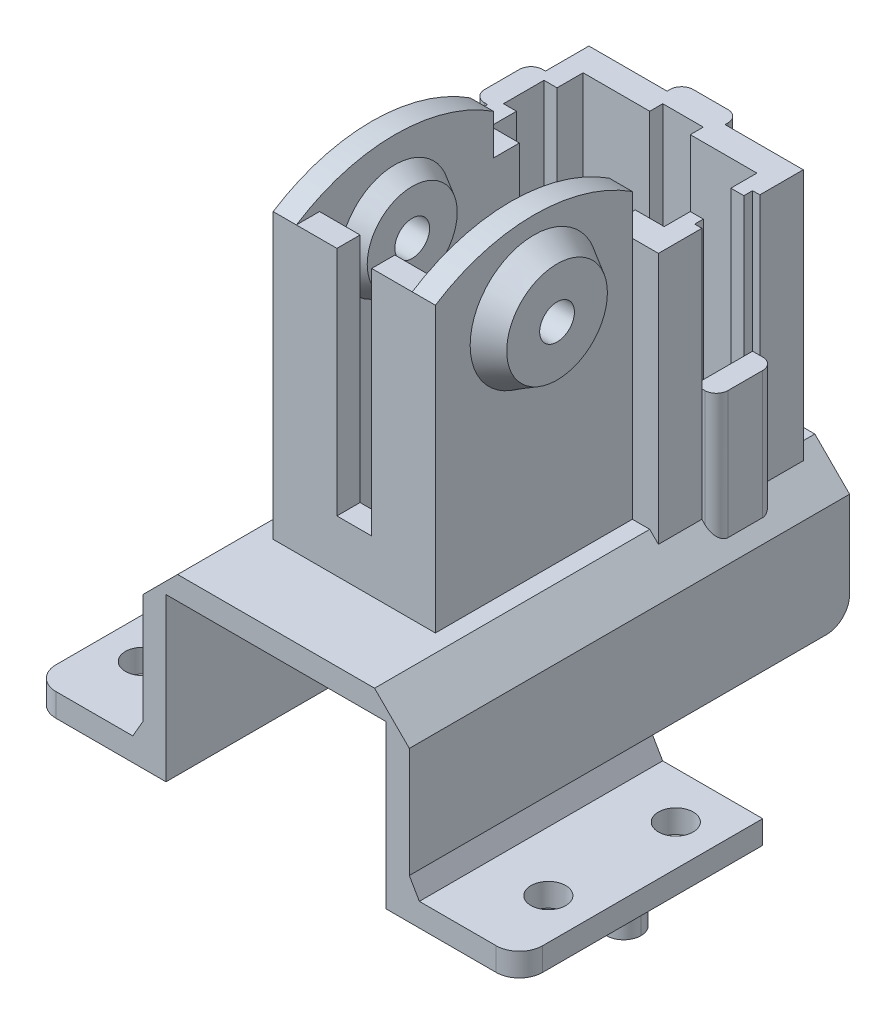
ISO-10303-21;
HEADER;
FILE_DESCRIPTION(('STEP AP214'),'2;1');
FILE_NAME('part.step','',(''),(''),'','','');
FILE_SCHEMA(('AUTOMOTIVE_DESIGN { 1 0 10303 214 1 1 1 1 }'));
ENDSEC;
DATA;
#1=APPLICATION_CONTEXT('core data for automotive mechanical design processes');
#2=APPLICATION_PROTOCOL_DEFINITION('international standard','automotive_design',2000,#1);
#3=PRODUCT_CONTEXT('',#1,'mechanical');
#4=PRODUCT('Part','Part','',(#3));
#5=PRODUCT_RELATED_PRODUCT_CATEGORY('part','',(#4));
#6=PRODUCT_DEFINITION_FORMATION('','',#4);
#7=PRODUCT_DEFINITION_CONTEXT('part definition',#1,'design');
#8=PRODUCT_DEFINITION('design','',#6,#7);
#9=PRODUCT_DEFINITION_SHAPE('','',#8);
#10=(LENGTH_UNIT() NAMED_UNIT(*) SI_UNIT(.MILLI.,.METRE.));
#11=(NAMED_UNIT(*) PLANE_ANGLE_UNIT() SI_UNIT($,.RADIAN.));
#12=(NAMED_UNIT(*) SI_UNIT($,.STERADIAN.) SOLID_ANGLE_UNIT());
#13=UNCERTAINTY_MEASURE_WITH_UNIT(LENGTH_MEASURE(1.E-05),#10,'distance_accuracy_value','');
#14=(GEOMETRIC_REPRESENTATION_CONTEXT(3) GLOBAL_UNCERTAINTY_ASSIGNED_CONTEXT((#13)) GLOBAL_UNIT_ASSIGNED_CONTEXT((#10,
#11,#12)) REPRESENTATION_CONTEXT('',''));
#15=CARTESIAN_POINT('',(0.,0.,0.));
#16=DIRECTION('',(0.,0.,1.));
#17=DIRECTION('',(1.,0.,0.));
#18=AXIS2_PLACEMENT_3D('',#15,#16,#17);
#19=CARTESIAN_POINT('',(9.5,0.,9.));
#20=DIRECTION('',(0.,-1.,0.));
#21=DIRECTION('',(1.,0.,0.));
#22=AXIS2_PLACEMENT_3D('',#19,#20,#21);
#23=PLANE('',#22);
#24=DIRECTION('',(0.,0.,1.));
#25=VECTOR('',#24,1.);
#26=CARTESIAN_POINT('',(21.,0.,9.));
#27=LINE('',#26,#25);
#28=CARTESIAN_POINT('',(21.,0.,9.));
#29=VERTEX_POINT('',#28);
#30=CARTESIAN_POINT('',(21.,0.,28.));
#31=VERTEX_POINT('',#30);
#32=EDGE_CURVE('E1394',#29,#31,#27,.T.);
#33=ORIENTED_EDGE('',*,*,#32,.T.);
#34=CARTESIAN_POINT('',(19.,0.,28.));
#35=DIRECTION('',(0.,-1.,0.));
#36=DIRECTION('',(1.,0.,0.));
#37=AXIS2_PLACEMENT_3D('',#34,#35,#36);
#38=CIRCLE('',#37,2.);
#39=CARTESIAN_POINT('',(19.,0.,30.));
#40=VERTEX_POINT('',#39);
#41=EDGE_CURVE('E1510',#31,#40,#38,.T.);
#42=ORIENTED_EDGE('',*,*,#41,.T.);
#43=DIRECTION('',(1.,0.,0.));
#44=VECTOR('',#43,1.);
#45=CARTESIAN_POINT('',(9.5,0.,30.));
#46=LINE('',#45,#44);
#47=CARTESIAN_POINT('',(9.5,0.,30.));
#48=VERTEX_POINT('',#47);
#49=EDGE_CURVE('E1356',#48,#40,#46,.T.);
#50=ORIENTED_EDGE('',*,*,#49,.F.);
#51=DIRECTION('',(0.,0.,1.));
#52=VECTOR('',#51,1.);
#53=CARTESIAN_POINT('',(9.5,0.,9.));
#54=LINE('',#53,#52);
#55=CARTESIAN_POINT('',(9.5,0.,9.));
#56=VERTEX_POINT('',#55);
#57=EDGE_CURVE('E1386',#56,#48,#54,.T.);
#58=ORIENTED_EDGE('',*,*,#57,.F.);
#59=DIRECTION('',(1.,0.,0.));
#60=VECTOR('',#59,1.);
#61=CARTESIAN_POINT('',(9.5,0.,9.));
#62=LINE('',#61,#60);
#63=EDGE_CURVE('E1374',#56,#29,#62,.T.);
#64=ORIENTED_EDGE('',*,*,#63,.T.);
#65=EDGE_LOOP('',(#33,#42,#50,#58,#64));
#66=FACE_BOUND('',#65,.T.);
#67=CARTESIAN_POINT('',(17.5,0.,24.));
#68=DIRECTION('',(0.,1.,0.));
#69=DIRECTION('',(-1.,0.,0.));
#70=AXIS2_PLACEMENT_3D('',#67,#68,#69);
#71=CIRCLE('',#70,1.50000000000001);
#72=CARTESIAN_POINT('',(15.9999999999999,0.,24.));
#73=VERTEX_POINT('',#72);
#74=EDGE_CURVE('E848',#73,#73,#71,.T.);
#75=ORIENTED_EDGE('',*,*,#74,.T.);
#76=EDGE_LOOP('',(#75));
#77=FACE_BOUND('',#76,.T.);
#78=CARTESIAN_POINT('',(17.4999999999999,0.,12.9999999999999));
#79=DIRECTION('',(0.,1.,0.));
#80=DIRECTION('',(-1.,0.,0.));
#81=AXIS2_PLACEMENT_3D('',#78,#79,#80);
#82=CIRCLE('',#81,1.5);
#83=CARTESIAN_POINT('',(15.9999999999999,0.,12.9999999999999));
#84=VERTEX_POINT('',#83);
#85=EDGE_CURVE('E842',#84,#84,#82,.T.);
#86=ORIENTED_EDGE('',*,*,#85,.T.);
#87=EDGE_LOOP('',(#86));
#88=FACE_BOUND('',#87,.T.);
#89=DIRECTION('',(0.,0.,1.));
#90=VECTOR('',#89,1.);
#91=CARTESIAN_POINT('',(15.,0.,20.));
#92=LINE('',#91,#90);
#93=CARTESIAN_POINT('',(15.,0.,20.));
#94=VERTEX_POINT('',#93);
#95=CARTESIAN_POINT('',(15.,0.,25.));
#96=VERTEX_POINT('',#95);
#97=EDGE_CURVE('E768',#94,#96,#92,.T.);
#98=ORIENTED_EDGE('',*,*,#97,.F.);
#99=DIRECTION('',(-1.,0.,0.));
#100=VECTOR('',#99,1.);
#101=CARTESIAN_POINT('',(20.,0.,20.));
#102=LINE('',#101,#100);
#103=CARTESIAN_POINT('',(18.5,0.,20.));
#104=VERTEX_POINT('',#103);
#105=EDGE_CURVE('E760',#104,#94,#102,.T.);
#106=ORIENTED_EDGE('',*,*,#105,.F.);
#107=CARTESIAN_POINT('',(18.5,0.,18.5));
#108=DIRECTION('',(0.,-1.,0.));
#109=DIRECTION('',(1.,0.,0.));
#110=AXIS2_PLACEMENT_3D('',#107,#108,#109);
#111=CIRCLE('',#110,1.5);
#112=CARTESIAN_POINT('',(20.,0.,18.5));
#113=VERTEX_POINT('',#112);
#114=EDGE_CURVE('E52',#104,#113,#111,.F.);
#115=ORIENTED_EDGE('',*,*,#114,.T.);
#116=CARTESIAN_POINT('',(18.5,0.,18.5));
#117=DIRECTION('',(0.,-1.,0.));
#118=DIRECTION('',(1.,0.,0.));
#119=AXIS2_PLACEMENT_3D('',#116,#117,#118);
#120=CIRCLE('',#119,1.5);
#121=CARTESIAN_POINT('',(18.5,0.,17.));
#122=VERTEX_POINT('',#121);
#123=EDGE_CURVE('E1680',#113,#122,#120,.F.);
#124=ORIENTED_EDGE('',*,*,#123,.T.);
#125=DIRECTION('',(1.,0.,0.));
#126=VECTOR('',#125,1.);
#127=CARTESIAN_POINT('',(15.,0.,17.0000000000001));
#128=LINE('',#127,#126);
#129=CARTESIAN_POINT('',(15.,0.,17.0000000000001));
#130=VERTEX_POINT('',#129);
#131=EDGE_CURVE('E792',#130,#122,#128,.T.);
#132=ORIENTED_EDGE('',*,*,#131,.F.);
#133=DIRECTION('',(0.,0.,1.));
#134=VECTOR('',#133,1.);
#135=CARTESIAN_POINT('',(15.,0.,10.5));
#136=LINE('',#135,#134);
#137=CARTESIAN_POINT('',(15.,0.,12.));
#138=VERTEX_POINT('',#137);
#139=EDGE_CURVE('E787',#138,#130,#136,.T.);
#140=ORIENTED_EDGE('',*,*,#139,.F.);
#141=CARTESIAN_POINT('',(13.5,0.,12.));
#142=DIRECTION('',(0.,-1.,0.));
#143=DIRECTION('',(1.,0.,0.));
#144=AXIS2_PLACEMENT_3D('',#141,#142,#143);
#145=CIRCLE('',#144,1.5);
#146=CARTESIAN_POINT('',(13.5,0.,10.5));
#147=VERTEX_POINT('',#146);
#148=EDGE_CURVE('E40',#138,#147,#145,.F.);
#149=ORIENTED_EDGE('',*,*,#148,.T.);
#150=CARTESIAN_POINT('',(13.5,0.,12.));
#151=DIRECTION('',(0.,-1.,0.));
#152=DIRECTION('',(1.,0.,0.));
#153=AXIS2_PLACEMENT_3D('',#150,#151,#152);
#154=CIRCLE('',#153,1.5);
#155=CARTESIAN_POINT('',(12.,0.,12.));
#156=VERTEX_POINT('',#155);
#157=EDGE_CURVE('E11',#147,#156,#154,.F.);
#158=ORIENTED_EDGE('',*,*,#157,.T.);
#159=DIRECTION('',(0.,0.,-1.));
#160=VECTOR('',#159,1.);
#161=CARTESIAN_POINT('',(12.,0.,26.5));
#162=LINE('',#161,#160);
#163=CARTESIAN_POINT('',(12.,0.,25.));
#164=VERTEX_POINT('',#163);
#165=EDGE_CURVE('E784',#164,#156,#162,.T.);
#166=ORIENTED_EDGE('',*,*,#165,.F.);
#167=CARTESIAN_POINT('',(13.5,0.,25.));
#168=DIRECTION('',(0.,-1.,0.));
#169=DIRECTION('',(1.,0.,0.));
#170=AXIS2_PLACEMENT_3D('',#167,#168,#169);
#171=CIRCLE('',#170,1.5);
#172=CARTESIAN_POINT('',(13.5,0.,26.5));
#173=VERTEX_POINT('',#172);
#174=EDGE_CURVE('E1677',#164,#173,#171,.F.);
#175=ORIENTED_EDGE('',*,*,#174,.T.);
#176=CARTESIAN_POINT('',(13.5,0.,25.));
#177=DIRECTION('',(0.,-1.,0.));
#178=DIRECTION('',(1.,0.,0.));
#179=AXIS2_PLACEMENT_3D('',#176,#177,#178);
#180=CIRCLE('',#179,1.5);
#181=EDGE_CURVE('E783',#173,#96,#180,.F.);
#182=ORIENTED_EDGE('',*,*,#181,.T.);
#183=EDGE_LOOP('',(#98,#106,#115,#124,#132,#140,#149,#158,#166,#175,#182));
#184=FACE_BOUND('',#183,.T.);
#185=ADVANCED_FACE('F32',(#66,#77,#88,#184),#23,.T.);
#186=CARTESIAN_POINT('',(-9.5,0.,9.));
#187=DIRECTION('',(0.,-1.,0.));
#188=DIRECTION('',(1.,0.,0.));
#189=AXIS2_PLACEMENT_3D('',#186,#187,#188);
#190=PLANE('',#189);
#191=CARTESIAN_POINT('',(-19.,0.,28.));
#192=DIRECTION('',(0.,-1.,0.));
#193=DIRECTION('',(1.,0.,0.));
#194=AXIS2_PLACEMENT_3D('',#191,#192,#193);
#195=CIRCLE('',#194,2.);
#196=CARTESIAN_POINT('',(-19.,0.,30.));
#197=VERTEX_POINT('',#196);
#198=CARTESIAN_POINT('',(-21.,0.,28.));
#199=VERTEX_POINT('',#198);
#200=EDGE_CURVE('E1498',#197,#199,#195,.T.);
#201=ORIENTED_EDGE('',*,*,#200,.T.);
#202=DIRECTION('',(0.,0.,1.));
#203=VECTOR('',#202,1.);
#204=CARTESIAN_POINT('',(-21.,0.,9.));
#205=LINE('',#204,#203);
#206=CARTESIAN_POINT('',(-21.,0.,9.));
#207=VERTEX_POINT('',#206);
#208=EDGE_CURVE('E1357',#207,#199,#205,.T.);
#209=ORIENTED_EDGE('',*,*,#208,.F.);
#210=DIRECTION('',(1.,0.,0.));
#211=VECTOR('',#210,1.);
#212=CARTESIAN_POINT('',(-9.5,0.,9.));
#213=LINE('',#212,#211);
#214=CARTESIAN_POINT('',(-9.5,0.,9.));
#215=VERTEX_POINT('',#214);
#216=EDGE_CURVE('E1344',#207,#215,#213,.T.);
#217=ORIENTED_EDGE('',*,*,#216,.T.);
#218=DIRECTION('',(0.,0.,1.));
#219=VECTOR('',#218,1.);
#220=CARTESIAN_POINT('',(-9.5,0.,9.));
#221=LINE('',#220,#219);
#222=CARTESIAN_POINT('',(-9.5,0.,30.));
#223=VERTEX_POINT('',#222);
#224=EDGE_CURVE('E1353',#215,#223,#221,.T.);
#225=ORIENTED_EDGE('',*,*,#224,.T.);
#226=DIRECTION('',(1.,0.,0.));
#227=VECTOR('',#226,1.);
#228=CARTESIAN_POINT('',(-9.5,0.,30.));
#229=LINE('',#228,#227);
#230=EDGE_CURVE('E1333',#197,#223,#229,.T.);
#231=ORIENTED_EDGE('',*,*,#230,.F.);
#232=EDGE_LOOP('',(#201,#209,#217,#225,#231));
#233=FACE_BOUND('',#232,.T.);
#234=CARTESIAN_POINT('',(-17.5000000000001,0.,13.));
#235=DIRECTION('',(0.,1.,0.));
#236=DIRECTION('',(-1.,0.,0.));
#237=AXIS2_PLACEMENT_3D('',#234,#235,#236);
#238=CIRCLE('',#237,1.49999999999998);
#239=CARTESIAN_POINT('',(-19.,0.,13.));
#240=VERTEX_POINT('',#239);
#241=EDGE_CURVE('E860',#240,#240,#238,.T.);
#242=ORIENTED_EDGE('',*,*,#241,.T.);
#243=EDGE_LOOP('',(#242));
#244=FACE_BOUND('',#243,.T.);
#245=CARTESIAN_POINT('',(-17.5,0.,24.));
#246=DIRECTION('',(0.,1.,0.));
#247=DIRECTION('',(-1.,0.,0.));
#248=AXIS2_PLACEMENT_3D('',#245,#246,#247);
#249=CIRCLE('',#248,1.49999999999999);
#250=CARTESIAN_POINT('',(-19.,0.,24.));
#251=VERTEX_POINT('',#250);
#252=EDGE_CURVE('E854',#251,#251,#249,.T.);
#253=ORIENTED_EDGE('',*,*,#252,.T.);
#254=EDGE_LOOP('',(#253));
#255=FACE_BOUND('',#254,.T.);
#256=CARTESIAN_POINT('',(-13.5,0.,25.));
#257=DIRECTION('',(0.,-1.,0.));
#258=DIRECTION('',(1.,0.,0.));
#259=AXIS2_PLACEMENT_3D('',#256,#257,#258);
#260=CIRCLE('',#259,1.5);
#261=CARTESIAN_POINT('',(-15.,0.,25.));
#262=VERTEX_POINT('',#261);
#263=CARTESIAN_POINT('',(-13.5,0.,26.5));
#264=VERTEX_POINT('',#263);
#265=EDGE_CURVE('E1672',#262,#264,#260,.F.);
#266=ORIENTED_EDGE('',*,*,#265,.T.);
#267=CARTESIAN_POINT('',(-13.5,0.,25.));
#268=DIRECTION('',(0.,-1.,0.));
#269=DIRECTION('',(1.,0.,0.));
#270=AXIS2_PLACEMENT_3D('',#267,#268,#269);
#271=CIRCLE('',#270,1.5);
#272=CARTESIAN_POINT('',(-12.,0.,25.));
#273=VERTEX_POINT('',#272);
#274=EDGE_CURVE('E1674',#264,#273,#271,.F.);
#275=ORIENTED_EDGE('',*,*,#274,.T.);
#276=DIRECTION('',(0.,0.,1.));
#277=VECTOR('',#276,1.);
#278=CARTESIAN_POINT('',(-12.,0.,26.5));
#279=LINE('',#278,#277);
#280=CARTESIAN_POINT('',(-12.,0.,12.));
#281=VERTEX_POINT('',#280);
#282=EDGE_CURVE('E779',#281,#273,#279,.T.);
#283=ORIENTED_EDGE('',*,*,#282,.F.);
#284=CARTESIAN_POINT('',(-13.5,0.,12.));
#285=DIRECTION('',(0.,-1.,0.));
#286=DIRECTION('',(1.,0.,0.));
#287=AXIS2_PLACEMENT_3D('',#284,#285,#286);
#288=CIRCLE('',#287,1.5);
#289=CARTESIAN_POINT('',(-13.5,0.,10.5));
#290=VERTEX_POINT('',#289);
#291=EDGE_CURVE('E1666',#281,#290,#288,.F.);
#292=ORIENTED_EDGE('',*,*,#291,.T.);
#293=CARTESIAN_POINT('',(-13.5,0.,12.));
#294=DIRECTION('',(0.,-1.,0.));
#295=DIRECTION('',(1.,0.,0.));
#296=AXIS2_PLACEMENT_3D('',#293,#294,#295);
#297=CIRCLE('',#296,1.5);
#298=CARTESIAN_POINT('',(-15.,0.,12.));
#299=VERTEX_POINT('',#298);
#300=EDGE_CURVE('E1664',#290,#299,#297,.F.);
#301=ORIENTED_EDGE('',*,*,#300,.T.);
#302=DIRECTION('',(0.,0.,-1.));
#303=VECTOR('',#302,1.);
#304=CARTESIAN_POINT('',(-15.,0.,10.5));
#305=LINE('',#304,#303);
#306=CARTESIAN_POINT('',(-15.,0.,17.0000000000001));
#307=VERTEX_POINT('',#306);
#308=EDGE_CURVE('E817',#307,#299,#305,.T.);
#309=ORIENTED_EDGE('',*,*,#308,.F.);
#310=DIRECTION('',(1.,0.,0.));
#311=VECTOR('',#310,1.);
#312=CARTESIAN_POINT('',(-15.,0.,17.0000000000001));
#313=LINE('',#312,#311);
#314=CARTESIAN_POINT('',(-18.5,0.,17.));
#315=VERTEX_POINT('',#314);
#316=EDGE_CURVE('E815',#315,#307,#313,.T.);
#317=ORIENTED_EDGE('',*,*,#316,.F.);
#318=CARTESIAN_POINT('',(-18.5,0.,18.5));
#319=DIRECTION('',(0.,-1.,0.));
#320=DIRECTION('',(1.,0.,0.));
#321=AXIS2_PLACEMENT_3D('',#318,#319,#320);
#322=CIRCLE('',#321,1.5);
#323=CARTESIAN_POINT('',(-20.,0.,18.5000000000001));
#324=VERTEX_POINT('',#323);
#325=EDGE_CURVE('E1668',#315,#324,#322,.F.);
#326=ORIENTED_EDGE('',*,*,#325,.T.);
#327=CARTESIAN_POINT('',(-18.5,0.,18.5));
#328=DIRECTION('',(0.,-1.,0.));
#329=DIRECTION('',(1.,0.,0.));
#330=AXIS2_PLACEMENT_3D('',#327,#328,#329);
#331=CIRCLE('',#330,1.5);
#332=CARTESIAN_POINT('',(-18.5,0.,20.));
#333=VERTEX_POINT('',#332);
#334=EDGE_CURVE('E1670',#324,#333,#331,.F.);
#335=ORIENTED_EDGE('',*,*,#334,.T.);
#336=DIRECTION('',(-1.,0.,0.));
#337=VECTOR('',#336,1.);
#338=CARTESIAN_POINT('',(-20.,0.,20.));
#339=LINE('',#338,#337);
#340=CARTESIAN_POINT('',(-15.,0.,20.));
#341=VERTEX_POINT('',#340);
#342=EDGE_CURVE('E812',#341,#333,#339,.T.);
#343=ORIENTED_EDGE('',*,*,#342,.F.);
#344=DIRECTION('',(0.,0.,-1.));
#345=VECTOR('',#344,1.);
#346=CARTESIAN_POINT('',(-15.,0.,20.));
#347=LINE('',#346,#345);
#348=EDGE_CURVE('E810',#262,#341,#347,.T.);
#349=ORIENTED_EDGE('',*,*,#348,.F.);
#350=EDGE_LOOP('',(#266,#275,#283,#292,#301,#309,#317,#326,#335,#343,#349));
#351=FACE_BOUND('',#350,.T.);
#352=ADVANCED_FACE('F1753',(#233,#244,#255,#351),#190,.T.);
#353=CARTESIAN_POINT('',(9.5,14.,30.));
#354=DIRECTION('',(1.,0.,0.));
#355=DIRECTION('',(0.,1.,0.));
#356=AXIS2_PLACEMENT_3D('',#353,#354,#355);
#357=PLANE('',#356);
#358=DIRECTION('',(0.,1.,0.));
#359=VECTOR('',#358,1.);
#360=CARTESIAN_POINT('',(9.5,14.,4.24999999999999));
#361=LINE('',#360,#359);
#362=CARTESIAN_POINT('',(9.5,11.,4.24999999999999));
#363=VERTEX_POINT('',#362);
#364=CARTESIAN_POINT('',(9.5,14.,4.24999999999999));
#365=VERTEX_POINT('',#364);
#366=EDGE_CURVE('E878',#363,#365,#361,.T.);
#367=ORIENTED_EDGE('',*,*,#366,.T.);
#368=DIRECTION('',(0.,0.,-1.));
#369=VECTOR('',#368,1.);
#370=CARTESIAN_POINT('',(9.5,14.,30.));
#371=LINE('',#370,#369);
#372=CARTESIAN_POINT('',(9.5,14.,-8.));
#373=VERTEX_POINT('',#372);
#374=EDGE_CURVE('E1430',#365,#373,#371,.T.);
#375=ORIENTED_EDGE('',*,*,#374,.T.);
#376=DIRECTION('',(0.,-1.,0.));
#377=VECTOR('',#376,1.);
#378=CARTESIAN_POINT('',(9.5,14.,-8.));
#379=LINE('',#378,#377);
#380=CARTESIAN_POINT('',(9.5,5.5,-8.));
#381=VERTEX_POINT('',#380);
#382=EDGE_CURVE('E1390',#373,#381,#379,.T.);
#383=ORIENTED_EDGE('',*,*,#382,.T.);
#384=CARTESIAN_POINT('',(9.5,5.5,-6.));
#385=DIRECTION('',(1.,0.,0.));
#386=DIRECTION('',(0.,1.,0.));
#387=AXIS2_PLACEMENT_3D('',#384,#385,#386);
#388=CIRCLE('',#387,2.);
#389=CARTESIAN_POINT('',(9.5,3.5,-6.));
#390=VERTEX_POINT('',#389);
#391=EDGE_CURVE('E1490',#381,#390,#388,.F.);
#392=ORIENTED_EDGE('',*,*,#391,.T.);
#393=DIRECTION('',(0.,0.,-1.));
#394=VECTOR('',#393,1.);
#395=CARTESIAN_POINT('',(9.5,3.5,30.));
#396=LINE('',#395,#394);
#397=CARTESIAN_POINT('',(9.50000000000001,3.5,9.));
#398=VERTEX_POINT('',#397);
#399=EDGE_CURVE('E1450',#398,#390,#396,.T.);
#400=ORIENTED_EDGE('',*,*,#399,.F.);
#401=DIRECTION('',(0.,-1.,0.));
#402=VECTOR('',#401,1.);
#403=CARTESIAN_POINT('',(9.50000000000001,3.5,9.));
#404=LINE('',#403,#402);
#405=EDGE_CURVE('E1371',#398,#56,#404,.T.);
#406=ORIENTED_EDGE('',*,*,#405,.T.);
#407=ORIENTED_EDGE('',*,*,#57,.T.);
#408=DIRECTION('',(0.,-1.,0.));
#409=VECTOR('',#408,1.);
#410=CARTESIAN_POINT('',(9.5,14.,30.));
#411=LINE('',#410,#409);
#412=CARTESIAN_POINT('',(9.5,14.,30.));
#413=VERTEX_POINT('',#412);
#414=EDGE_CURVE('E1415',#413,#48,#411,.T.);
#415=ORIENTED_EDGE('',*,*,#414,.F.);
#416=CARTESIAN_POINT('',(9.5,14.,23.25));
#417=VERTEX_POINT('',#416);
#418=EDGE_CURVE('E1431',#413,#417,#371,.T.);
#419=ORIENTED_EDGE('',*,*,#418,.T.);
#420=DIRECTION('',(0.,1.,0.));
#421=VECTOR('',#420,1.);
#422=CARTESIAN_POINT('',(9.5,14.,23.25));
#423=LINE('',#422,#421);
#424=CARTESIAN_POINT('',(9.5,9.,23.25));
#425=VERTEX_POINT('',#424);
#426=EDGE_CURVE('E904',#425,#417,#423,.T.);
#427=ORIENTED_EDGE('',*,*,#426,.F.);
#428=DIRECTION('',(0.,0.,1.));
#429=VECTOR('',#428,1.);
#430=CARTESIAN_POINT('',(9.5,9.,30.));
#431=LINE('',#430,#429);
#432=CARTESIAN_POINT('',(9.5,9.,21.25));
#433=VERTEX_POINT('',#432);
#434=EDGE_CURVE('E892',#433,#425,#431,.T.);
#435=ORIENTED_EDGE('',*,*,#434,.F.);
#436=DIRECTION('',(0.,1.,0.));
#437=VECTOR('',#436,1.);
#438=CARTESIAN_POINT('',(9.5,14.,21.25));
#439=LINE('',#438,#437);
#440=CARTESIAN_POINT('',(9.5,14.,21.25));
#441=VERTEX_POINT('',#440);
#442=EDGE_CURVE('E884',#433,#441,#439,.T.);
#443=ORIENTED_EDGE('',*,*,#442,.T.);
#444=CARTESIAN_POINT('',(9.5,14.,6.24999999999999));
#445=VERTEX_POINT('',#444);
#446=EDGE_CURVE('E1435',#441,#445,#371,.T.);
#447=ORIENTED_EDGE('',*,*,#446,.T.);
#448=DIRECTION('',(0.,1.,0.));
#449=VECTOR('',#448,1.);
#450=CARTESIAN_POINT('',(9.5,14.,6.24999999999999));
#451=LINE('',#450,#449);
#452=CARTESIAN_POINT('',(9.5,11.,6.24999999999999));
#453=VERTEX_POINT('',#452);
#454=EDGE_CURVE('E866',#453,#445,#451,.T.);
#455=ORIENTED_EDGE('',*,*,#454,.F.);
#456=DIRECTION('',(0.,0.,1.));
#457=VECTOR('',#456,1.);
#458=CARTESIAN_POINT('',(9.5,11.,30.));
#459=LINE('',#458,#457);
#460=EDGE_CURVE('E870',#363,#453,#459,.T.);
#461=ORIENTED_EDGE('',*,*,#460,.F.);
#462=EDGE_LOOP('',(#367,#375,#383,#392,#400,#406,#407,#415,#419,#427,#435,#443,#447,#455,#461));
#463=FACE_BOUND('',#462,.T.);
#464=ADVANCED_FACE('F34',(#463),#357,.F.);
#465=CARTESIAN_POINT('',(-9.5,14.,30.));
#466=DIRECTION('',(0.,1.,0.));
#467=DIRECTION('',(0.,0.,1.));
#468=AXIS2_PLACEMENT_3D('',#465,#466,#467);
#469=PLANE('',#468);
#470=DIRECTION('',(1.,0.,0.));
#471=VECTOR('',#470,1.);
#472=CARTESIAN_POINT('',(-9.5,14.,4.));
#473=LINE('',#472,#471);
#474=CARTESIAN_POINT('',(5.,14.,3.99999999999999));
#475=VERTEX_POINT('',#474);
#476=CARTESIAN_POINT('',(7.5,14.,3.99999999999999));
#477=VERTEX_POINT('',#476);
#478=EDGE_CURVE('E1109',#475,#477,#473,.T.);
#479=ORIENTED_EDGE('',*,*,#478,.T.);
#480=DIRECTION('',(0.,0.,-1.));
#481=VECTOR('',#480,1.);
#482=CARTESIAN_POINT('',(7.50000000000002,14.,30.));
#483=LINE('',#482,#481);
#484=CARTESIAN_POINT('',(7.5,14.,1.75));
#485=VERTEX_POINT('',#484);
#486=EDGE_CURVE('E1112',#477,#485,#483,.T.);
#487=ORIENTED_EDGE('',*,*,#486,.T.);
#488=DIRECTION('',(1.,0.,0.));
#489=VECTOR('',#488,1.);
#490=CARTESIAN_POINT('',(-9.5,14.,1.75));
#491=LINE('',#490,#489);
#492=CARTESIAN_POINT('',(8.625,14.,1.75));
#493=VERTEX_POINT('',#492);
#494=EDGE_CURVE('E1070',#485,#493,#491,.T.);
#495=ORIENTED_EDGE('',*,*,#494,.T.);
#496=DIRECTION('',(0.,0.,-1.));
#497=VECTOR('',#496,1.);
#498=CARTESIAN_POINT('',(8.625,14.,30.));
#499=LINE('',#498,#497);
#500=CARTESIAN_POINT('',(8.625,14.,-1.75000000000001));
#501=VERTEX_POINT('',#500);
#502=EDGE_CURVE('E1115',#493,#501,#499,.T.);
#503=ORIENTED_EDGE('',*,*,#502,.T.);
#504=DIRECTION('',(-1.,0.,0.));
#505=VECTOR('',#504,1.);
#506=CARTESIAN_POINT('',(-9.50000000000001,14.,-1.75));
#507=LINE('',#506,#505);
#508=CARTESIAN_POINT('',(7.5,14.,-1.75000000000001));
#509=VERTEX_POINT('',#508);
#510=EDGE_CURVE('E1073',#501,#509,#507,.T.);
#511=ORIENTED_EDGE('',*,*,#510,.T.);
#512=DIRECTION('',(0.,0.,-1.));
#513=VECTOR('',#512,1.);
#514=CARTESIAN_POINT('',(7.49999999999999,14.,30.));
#515=LINE('',#514,#513);
#516=CARTESIAN_POINT('',(7.5,14.,-4.00000000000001));
#517=VERTEX_POINT('',#516);
#518=EDGE_CURVE('E1076',#509,#517,#515,.T.);
#519=ORIENTED_EDGE('',*,*,#518,.T.);
#520=DIRECTION('',(-1.,0.,0.));
#521=VECTOR('',#520,1.);
#522=CARTESIAN_POINT('',(-9.5,14.,-4.));
#523=LINE('',#522,#521);
#524=CARTESIAN_POINT('',(1.75,14.,-4.00000000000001));
#525=VERTEX_POINT('',#524);
#526=EDGE_CURVE('E1079',#517,#525,#523,.T.);
#527=ORIENTED_EDGE('',*,*,#526,.T.);
#528=DIRECTION('',(0.,0.,-1.));
#529=VECTOR('',#528,1.);
#530=CARTESIAN_POINT('',(1.75000000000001,14.,30.));
#531=LINE('',#530,#529);
#532=CARTESIAN_POINT('',(1.75,14.,-5.12500000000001));
#533=VERTEX_POINT('',#532);
#534=EDGE_CURVE('E1082',#525,#533,#531,.T.);
#535=ORIENTED_EDGE('',*,*,#534,.T.);
#536=DIRECTION('',(-1.,0.,0.));
#537=VECTOR('',#536,1.);
#538=CARTESIAN_POINT('',(-9.5,14.,-5.125));
#539=LINE('',#538,#537);
#540=CARTESIAN_POINT('',(-1.75,14.,-5.12500000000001));
#541=VERTEX_POINT('',#540);
#542=EDGE_CURVE('E1085',#533,#541,#539,.T.);
#543=ORIENTED_EDGE('',*,*,#542,.T.);
#544=DIRECTION('',(0.,0.,1.));
#545=VECTOR('',#544,1.);
#546=CARTESIAN_POINT('',(-1.74999999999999,14.,30.));
#547=LINE('',#546,#545);
#548=CARTESIAN_POINT('',(-1.75,14.,-4.00000000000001));
#549=VERTEX_POINT('',#548);
#550=EDGE_CURVE('E1088',#541,#549,#547,.T.);
#551=ORIENTED_EDGE('',*,*,#550,.T.);
#552=DIRECTION('',(-1.,0.,0.));
#553=VECTOR('',#552,1.);
#554=CARTESIAN_POINT('',(-9.5,14.,-4.));
#555=LINE('',#554,#553);
#556=CARTESIAN_POINT('',(-7.5,14.,-4.00000000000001));
#557=VERTEX_POINT('',#556);
#558=EDGE_CURVE('E1091',#549,#557,#555,.T.);
#559=ORIENTED_EDGE('',*,*,#558,.T.);
#560=DIRECTION('',(0.,0.,1.));
#561=VECTOR('',#560,1.);
#562=CARTESIAN_POINT('',(-7.49999999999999,14.,30.));
#563=LINE('',#562,#561);
#564=CARTESIAN_POINT('',(-7.5,14.,-1.75000000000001));
#565=VERTEX_POINT('',#564);
#566=EDGE_CURVE('E1094',#557,#565,#563,.T.);
#567=ORIENTED_EDGE('',*,*,#566,.T.);
#568=DIRECTION('',(-1.,0.,0.));
#569=VECTOR('',#568,1.);
#570=CARTESIAN_POINT('',(-9.49999999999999,14.,-1.75000000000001));
#571=LINE('',#570,#569);
#572=CARTESIAN_POINT('',(-8.625,14.,-1.75000000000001));
#573=VERTEX_POINT('',#572);
#574=EDGE_CURVE('E1097',#565,#573,#571,.T.);
#575=ORIENTED_EDGE('',*,*,#574,.T.);
#576=DIRECTION('',(0.,0.,1.));
#577=VECTOR('',#576,1.);
#578=CARTESIAN_POINT('',(-8.625,14.,30.));
#579=LINE('',#578,#577);
#580=CARTESIAN_POINT('',(-8.625,14.,1.75));
#581=VERTEX_POINT('',#580);
#582=EDGE_CURVE('E1118',#573,#581,#579,.T.);
#583=ORIENTED_EDGE('',*,*,#582,.T.);
#584=DIRECTION('',(1.,0.,0.));
#585=VECTOR('',#584,1.);
#586=CARTESIAN_POINT('',(-9.49999999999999,14.,1.75));
#587=LINE('',#586,#585);
#588=CARTESIAN_POINT('',(-7.5,14.,1.75));
#589=VERTEX_POINT('',#588);
#590=EDGE_CURVE('E1100',#581,#589,#587,.T.);
#591=ORIENTED_EDGE('',*,*,#590,.T.);
#592=DIRECTION('',(0.,0.,1.));
#593=VECTOR('',#592,1.);
#594=CARTESIAN_POINT('',(-7.50000000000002,14.,30.));
#595=LINE('',#594,#593);
#596=CARTESIAN_POINT('',(-7.5,14.,3.99999999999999));
#597=VERTEX_POINT('',#596);
#598=EDGE_CURVE('E1103',#589,#597,#595,.T.);
#599=ORIENTED_EDGE('',*,*,#598,.T.);
#600=DIRECTION('',(1.,0.,0.));
#601=VECTOR('',#600,1.);
#602=CARTESIAN_POINT('',(-9.5,14.,4.));
#603=LINE('',#602,#601);
#604=CARTESIAN_POINT('',(-5.,14.,3.99999999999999));
#605=VERTEX_POINT('',#604);
#606=EDGE_CURVE('E1106',#597,#605,#603,.T.);
#607=ORIENTED_EDGE('',*,*,#606,.T.);
#608=DIRECTION('',(0.,0.,1.));
#609=VECTOR('',#608,1.);
#610=CARTESIAN_POINT('',(-5.,14.,30.));
#611=LINE('',#610,#609);
#612=CARTESIAN_POINT('',(-5.,14.,16.));
#613=VERTEX_POINT('',#612);
#614=EDGE_CURVE('E1067',#605,#613,#611,.T.);
#615=ORIENTED_EDGE('',*,*,#614,.T.);
#616=DIRECTION('',(1.,0.,0.));
#617=VECTOR('',#616,1.);
#618=CARTESIAN_POINT('',(-9.50000000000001,14.,16.));
#619=LINE('',#618,#617);
#620=CARTESIAN_POINT('',(5.,14.,16.));
#621=VERTEX_POINT('',#620);
#622=EDGE_CURVE('E1048',#613,#621,#619,.T.);
#623=ORIENTED_EDGE('',*,*,#622,.T.);
#624=DIRECTION('',(0.,0.,-1.));
#625=VECTOR('',#624,1.);
#626=CARTESIAN_POINT('',(5.,14.,30.));
#627=LINE('',#626,#625);
#628=EDGE_CURVE('E1062',#621,#475,#627,.T.);
#629=ORIENTED_EDGE('',*,*,#628,.T.);
#630=EDGE_LOOP('',(#479,#487,#495,#503,#511,#519,#527,#535,#543,#551,#559,#567,#575,#583,#591,
#599,#607,#615,#623,#629));
#631=FACE_BOUND('',#630,.T.);
#632=DIRECTION('',(-1.,0.,0.));
#633=VECTOR('',#632,1.);
#634=CARTESIAN_POINT('',(9.5,14.,4.24999999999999));
#635=LINE('',#634,#633);
#636=CARTESIAN_POINT('',(6.5,14.,4.24999999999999));
#637=VERTEX_POINT('',#636);
#638=EDGE_CURVE('E881',#365,#637,#635,.T.);
#639=ORIENTED_EDGE('',*,*,#638,.T.);
#640=DIRECTION('',(0.,0.,-1.));
#641=VECTOR('',#640,1.);
#642=CARTESIAN_POINT('',(6.5,14.,30.));
#643=LINE('',#642,#641);
#644=CARTESIAN_POINT('',(6.5,14.,6.24999999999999));
#645=VERTEX_POINT('',#644);
#646=EDGE_CURVE('E875',#645,#637,#643,.T.);
#647=ORIENTED_EDGE('',*,*,#646,.F.);
#648=DIRECTION('',(-1.,0.,0.));
#649=VECTOR('',#648,1.);
#650=CARTESIAN_POINT('',(9.5,14.,6.24999999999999));
#651=LINE('',#650,#649);
#652=EDGE_CURVE('E863',#445,#645,#651,.T.);
#653=ORIENTED_EDGE('',*,*,#652,.F.);
#654=ORIENTED_EDGE('',*,*,#446,.F.);
#655=DIRECTION('',(-1.,0.,0.));
#656=VECTOR('',#655,1.);
#657=CARTESIAN_POINT('',(9.5,14.,21.25));
#658=LINE('',#657,#656);
#659=CARTESIAN_POINT('',(4.5,14.,21.25));
#660=VERTEX_POINT('',#659);
#661=EDGE_CURVE('E890',#441,#660,#658,.T.);
#662=ORIENTED_EDGE('',*,*,#661,.T.);
#663=DIRECTION('',(0.,0.,-1.));
#664=VECTOR('',#663,1.);
#665=CARTESIAN_POINT('',(4.5,14.,30.));
#666=LINE('',#665,#664);
#667=CARTESIAN_POINT('',(4.5,14.,23.25));
#668=VERTEX_POINT('',#667);
#669=EDGE_CURVE('E895',#668,#660,#666,.T.);
#670=ORIENTED_EDGE('',*,*,#669,.F.);
#671=DIRECTION('',(-1.,0.,0.));
#672=VECTOR('',#671,1.);
#673=CARTESIAN_POINT('',(9.5,14.,23.25));
#674=LINE('',#673,#672);
#675=EDGE_CURVE('E901',#417,#668,#674,.T.);
#676=ORIENTED_EDGE('',*,*,#675,.F.);
#677=ORIENTED_EDGE('',*,*,#418,.F.);
#678=DIRECTION('',(1.,0.,0.));
#679=VECTOR('',#678,1.);
#680=CARTESIAN_POINT('',(-9.5,14.,30.));
#681=LINE('',#680,#679);
#682=CARTESIAN_POINT('',(-9.5,14.,30.));
#683=VERTEX_POINT('',#682);
#684=EDGE_CURVE('E1428',#683,#413,#681,.T.);
#685=ORIENTED_EDGE('',*,*,#684,.F.);
#686=DIRECTION('',(0.,0.,-1.));
#687=VECTOR('',#686,1.);
#688=CARTESIAN_POINT('',(-9.5,14.,30.));
#689=LINE('',#688,#687);
#690=CARTESIAN_POINT('',(-9.5,14.,23.25));
#691=VERTEX_POINT('',#690);
#692=EDGE_CURVE('E1436',#683,#691,#689,.T.);
#693=ORIENTED_EDGE('',*,*,#692,.T.);
#694=DIRECTION('',(1.,0.,0.));
#695=VECTOR('',#694,1.);
#696=CARTESIAN_POINT('',(-9.5,14.,23.25));
#697=LINE('',#696,#695);
#698=CARTESIAN_POINT('',(-4.5,14.,23.25));
#699=VERTEX_POINT('',#698);
#700=EDGE_CURVE('E939',#691,#699,#697,.T.);
#701=ORIENTED_EDGE('',*,*,#700,.T.);
#702=DIRECTION('',(0.,0.,-1.));
#703=VECTOR('',#702,1.);
#704=CARTESIAN_POINT('',(-4.5,14.,30.));
#705=LINE('',#704,#703);
#706=CARTESIAN_POINT('',(-4.5,14.,21.25));
#707=VERTEX_POINT('',#706);
#708=EDGE_CURVE('E943',#699,#707,#705,.T.);
#709=ORIENTED_EDGE('',*,*,#708,.T.);
#710=DIRECTION('',(1.,0.,0.));
#711=VECTOR('',#710,1.);
#712=CARTESIAN_POINT('',(-9.5,14.,21.25));
#713=LINE('',#712,#711);
#714=CARTESIAN_POINT('',(-9.5,14.,21.25));
#715=VERTEX_POINT('',#714);
#716=EDGE_CURVE('E933',#715,#707,#713,.T.);
#717=ORIENTED_EDGE('',*,*,#716,.F.);
#718=CARTESIAN_POINT('',(-9.5,14.,6.24999999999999));
#719=VERTEX_POINT('',#718);
#720=EDGE_CURVE('E1440',#715,#719,#689,.T.);
#721=ORIENTED_EDGE('',*,*,#720,.T.);
#722=DIRECTION('',(1.,0.,0.));
#723=VECTOR('',#722,1.);
#724=CARTESIAN_POINT('',(-9.5,14.,6.24999999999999));
#725=LINE('',#724,#723);
#726=CARTESIAN_POINT('',(-6.5,14.,6.24999999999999));
#727=VERTEX_POINT('',#726);
#728=EDGE_CURVE('E913',#719,#727,#725,.T.);
#729=ORIENTED_EDGE('',*,*,#728,.T.);
#730=DIRECTION('',(0.,0.,-1.));
#731=VECTOR('',#730,1.);
#732=CARTESIAN_POINT('',(-6.5,14.,30.));
#733=LINE('',#732,#731);
#734=CARTESIAN_POINT('',(-6.5,14.,4.24999999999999));
#735=VERTEX_POINT('',#734);
#736=EDGE_CURVE('E923',#727,#735,#733,.T.);
#737=ORIENTED_EDGE('',*,*,#736,.T.);
#738=DIRECTION('',(1.,0.,0.));
#739=VECTOR('',#738,1.);
#740=CARTESIAN_POINT('',(-9.5,14.,4.24999999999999));
#741=LINE('',#740,#739);
#742=CARTESIAN_POINT('',(-9.5,14.,4.24999999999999));
#743=VERTEX_POINT('',#742);
#744=EDGE_CURVE('E917',#743,#735,#741,.T.);
#745=ORIENTED_EDGE('',*,*,#744,.F.);
#746=CARTESIAN_POINT('',(-9.5,14.,-8.));
#747=VERTEX_POINT('',#746);
#748=EDGE_CURVE('E1434',#743,#747,#689,.T.);
#749=ORIENTED_EDGE('',*,*,#748,.T.);
#750=DIRECTION('',(1.,0.,0.));
#751=VECTOR('',#750,1.);
#752=CARTESIAN_POINT('',(-9.5,14.,-8.));
#753=LINE('',#752,#751);
#754=EDGE_CURVE('E1412',#747,#373,#753,.T.);
#755=ORIENTED_EDGE('',*,*,#754,.T.);
#756=ORIENTED_EDGE('',*,*,#374,.F.);
#757=EDGE_LOOP('',(#639,#647,#653,#654,#662,#670,#676,#677,#685,#693,#701,#709,#717,#721,#729,
#737,#745,#749,#755,#756));
#758=FACE_BOUND('',#757,.T.);
#759=ADVANCED_FACE('F1817',(#631,#758),#469,.F.);
#760=CARTESIAN_POINT('',(9.25,37.,6.24999999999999));
#761=DIRECTION('',(0.,1.,0.));
#762=DIRECTION('',(0.,0.,1.));
#763=AXIS2_PLACEMENT_3D('',#760,#761,#762);
#764=PLANE('',#763);
#765=DIRECTION('',(0.,0.,-1.));
#766=VECTOR('',#765,1.);
#767=CARTESIAN_POINT('',(9.25,37.,6.24999999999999));
#768=LINE('',#767,#766);
#769=CARTESIAN_POINT('',(9.25,37.,6.24999999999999));
#770=VERTEX_POINT('',#769);
#771=CARTESIAN_POINT('',(9.25,37.,2.49999999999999));
#772=VERTEX_POINT('',#771);
#773=EDGE_CURVE('E1249',#770,#772,#768,.T.);
#774=ORIENTED_EDGE('',*,*,#773,.T.);
#775=DIRECTION('',(1.,0.,0.));
#776=VECTOR('',#775,1.);
#777=CARTESIAN_POINT('',(8.625,37.,2.49999999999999));
#778=LINE('',#777,#776);
#779=CARTESIAN_POINT('',(8.625,37.,2.49999999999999));
#780=VERTEX_POINT('',#779);
#781=EDGE_CURVE('E952',#780,#772,#778,.T.);
#782=ORIENTED_EDGE('',*,*,#781,.F.);
#783=DIRECTION('',(0.,0.,1.));
#784=VECTOR('',#783,1.);
#785=CARTESIAN_POINT('',(8.625,37.,2.49999999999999));
#786=LINE('',#785,#784);
#787=CARTESIAN_POINT('',(8.625,37.,1.75));
#788=VERTEX_POINT('',#787);
#789=EDGE_CURVE('E949',#788,#780,#786,.T.);
#790=ORIENTED_EDGE('',*,*,#789,.F.);
#791=DIRECTION('',(1.,0.,0.));
#792=VECTOR('',#791,1.);
#793=CARTESIAN_POINT('',(8.625,37.,1.75));
#794=LINE('',#793,#792);
#795=CARTESIAN_POINT('',(7.5,37.,1.75));
#796=VERTEX_POINT('',#795);
#797=EDGE_CURVE('E1207',#796,#788,#794,.T.);
#798=ORIENTED_EDGE('',*,*,#797,.F.);
#799=DIRECTION('',(0.,0.,-1.));
#800=VECTOR('',#799,1.);
#801=CARTESIAN_POINT('',(7.5,37.,1.75));
#802=LINE('',#801,#800);
#803=CARTESIAN_POINT('',(7.5,37.,3.99999999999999));
#804=VERTEX_POINT('',#803);
#805=EDGE_CURVE('E1205',#804,#796,#802,.T.);
#806=ORIENTED_EDGE('',*,*,#805,.F.);
#807=DIRECTION('',(1.,0.,0.));
#808=VECTOR('',#807,1.);
#809=CARTESIAN_POINT('',(7.5,37.,3.99999999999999));
#810=LINE('',#809,#808);
#811=CARTESIAN_POINT('',(5.,37.,3.99999999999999));
#812=VERTEX_POINT('',#811);
#813=EDGE_CURVE('E1201',#812,#804,#810,.T.);
#814=ORIENTED_EDGE('',*,*,#813,.F.);
#815=DIRECTION('',(0.,0.,-1.));
#816=VECTOR('',#815,1.);
#817=CARTESIAN_POINT('',(5.,37.,6.24999999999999));
#818=LINE('',#817,#816);
#819=CARTESIAN_POINT('',(5.,37.,6.24999999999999));
#820=VERTEX_POINT('',#819);
#821=EDGE_CURVE('E1060',#820,#812,#818,.T.);
#822=ORIENTED_EDGE('',*,*,#821,.F.);
#823=DIRECTION('',(1.,0.,0.));
#824=VECTOR('',#823,1.);
#825=CARTESIAN_POINT('',(-9.25,37.,6.24999999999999));
#826=LINE('',#825,#824);
#827=CARTESIAN_POINT('',(7.,37.,6.24999999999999));
#828=VERTEX_POINT('',#827);
#829=EDGE_CURVE('E3278',#820,#828,#826,.T.);
#830=ORIENTED_EDGE('',*,*,#829,.T.);
#831=EDGE_CURVE('E1245',#828,#770,#826,.T.);
#832=ORIENTED_EDGE('',*,*,#831,.T.);
#833=EDGE_LOOP('',(#774,#782,#790,#798,#806,#814,#822,#830,#832));
#834=FACE_BOUND('',#833,.T.);
#835=ADVANCED_FACE('F1820',(#834),#764,.T.);
#836=CARTESIAN_POINT('',(9.25,37.,2.49999999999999));
#837=DIRECTION('',(0.,0.,-1.));
#838=DIRECTION('',(-1.,0.,0.));
#839=AXIS2_PLACEMENT_3D('',#836,#837,#838);
#840=PLANE('',#839);
#841=DIRECTION('',(1.,0.,0.));
#842=VECTOR('',#841,1.);
#843=CARTESIAN_POINT('',(8.625,25.,2.49999999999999));
#844=LINE('',#843,#842);
#845=CARTESIAN_POINT('',(9.25,25.,2.49999999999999));
#846=VERTEX_POINT('',#845);
#847=CARTESIAN_POINT('',(9.50000000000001,25.,2.49999999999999));
#848=VERTEX_POINT('',#847);
#849=EDGE_CURVE('E969',#846,#848,#844,.T.);
#850=ORIENTED_EDGE('',*,*,#849,.F.);
#851=DIRECTION('',(0.,-1.,0.));
#852=VECTOR('',#851,1.);
#853=CARTESIAN_POINT('',(9.25,37.,2.49999999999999));
#854=LINE('',#853,#852);
#855=CARTESIAN_POINT('',(9.25,15.25,2.49999999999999));
#856=VERTEX_POINT('',#855);
#857=EDGE_CURVE('E1303',#846,#856,#854,.T.);
#858=ORIENTED_EDGE('',*,*,#857,.T.);
#859=DIRECTION('',(0.707106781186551,-0.707106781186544,0.));
#860=VECTOR('',#859,1.);
#861=CARTESIAN_POINT('',(8.49999999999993,16.,2.5));
#862=LINE('',#861,#860);
#863=CARTESIAN_POINT('',(9.50000000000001,14.9999999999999,2.49999999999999));
#864=VERTEX_POINT('',#863);
#865=EDGE_CURVE('E1521',#864,#856,#862,.F.);
#866=ORIENTED_EDGE('',*,*,#865,.F.);
#867=DIRECTION('',(0.,-1.,0.));
#868=VECTOR('',#867,1.);
#869=CARTESIAN_POINT('',(9.50000000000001,37.,2.49999999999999));
#870=LINE('',#869,#868);
#871=EDGE_CURVE('E1578',#864,#848,#870,.F.);
#872=ORIENTED_EDGE('',*,*,#871,.T.);
#873=EDGE_LOOP('',(#850,#858,#866,#872));
#874=FACE_BOUND('',#873,.T.);
#875=ADVANCED_FACE('F1940',(#874),#840,.F.);
#876=CARTESIAN_POINT('',(10.5,37.,-2.50000000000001));
#877=DIRECTION('',(-1.,0.,0.));
#878=DIRECTION('',(0.,0.,1.));
#879=AXIS2_PLACEMENT_3D('',#876,#877,#878);
#880=PLANE('',#879);
#881=DIRECTION('',(0.,0.,-1.));
#882=VECTOR('',#881,1.);
#883=CARTESIAN_POINT('',(10.5,25.,1.49999999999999));
#884=LINE('',#883,#882);
#885=CARTESIAN_POINT('',(10.5,25.,1.49999999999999));
#886=VERTEX_POINT('',#885);
#887=CARTESIAN_POINT('',(10.5,25.,-1.50000000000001));
#888=VERTEX_POINT('',#887);
#889=EDGE_CURVE('E957',#886,#888,#884,.T.);
#890=ORIENTED_EDGE('',*,*,#889,.F.);
#891=DIRECTION('',(0.,-1.,0.));
#892=VECTOR('',#891,1.);
#893=CARTESIAN_POINT('',(10.5,37.,1.49999999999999));
#894=LINE('',#893,#892);
#895=CARTESIAN_POINT('',(10.5,14.,1.49999999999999));
#896=VERTEX_POINT('',#895);
#897=EDGE_CURVE('E1573',#886,#896,#894,.T.);
#898=ORIENTED_EDGE('',*,*,#897,.T.);
#899=DIRECTION('',(0.,0.,1.));
#900=VECTOR('',#899,1.);
#901=CARTESIAN_POINT('',(10.5,14.,-2.50000000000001));
#902=LINE('',#901,#900);
#903=CARTESIAN_POINT('',(10.5,14.,-1.50000000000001));
#904=VERTEX_POINT('',#903);
#905=EDGE_CURVE('E1171',#904,#896,#902,.T.);
#906=ORIENTED_EDGE('',*,*,#905,.F.);
#907=DIRECTION('',(0.,-1.,0.));
#908=VECTOR('',#907,1.);
#909=CARTESIAN_POINT('',(10.5,37.,-1.50000000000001));
#910=LINE('',#909,#908);
#911=EDGE_CURVE('E1575',#904,#888,#910,.F.);
#912=ORIENTED_EDGE('',*,*,#911,.T.);
#913=EDGE_LOOP('',(#890,#898,#906,#912));
#914=FACE_BOUND('',#913,.T.);
#915=ADVANCED_FACE('F1943',(#914),#880,.F.);
#916=CARTESIAN_POINT('',(9.25,37.,-2.50000000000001));
#917=DIRECTION('',(0.,0.,1.));
#918=DIRECTION('',(1.,0.,0.));
#919=AXIS2_PLACEMENT_3D('',#916,#917,#918);
#920=PLANE('',#919);
#921=DIRECTION('',(-1.,0.,0.));
#922=VECTOR('',#921,1.);
#923=CARTESIAN_POINT('',(9.5,25.,-2.50000000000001));
#924=LINE('',#923,#922);
#925=CARTESIAN_POINT('',(9.5,25.,-2.50000000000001));
#926=VERTEX_POINT('',#925);
#927=CARTESIAN_POINT('',(9.25,25.,-2.50000000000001));
#928=VERTEX_POINT('',#927);
#929=EDGE_CURVE('E962',#926,#928,#924,.T.);
#930=ORIENTED_EDGE('',*,*,#929,.F.);
#931=DIRECTION('',(0.,-1.,0.));
#932=VECTOR('',#931,1.);
#933=CARTESIAN_POINT('',(9.5,37.,-2.50000000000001));
#934=LINE('',#933,#932);
#935=CARTESIAN_POINT('',(9.5,15.,-2.50000000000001));
#936=VERTEX_POINT('',#935);
#937=EDGE_CURVE('E1571',#926,#936,#934,.T.);
#938=ORIENTED_EDGE('',*,*,#937,.T.);
#939=DIRECTION('',(-0.707106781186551,0.707106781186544,0.));
#940=VECTOR('',#939,1.);
#941=CARTESIAN_POINT('',(8.49999999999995,16.,-2.50000000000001));
#942=LINE('',#941,#940);
#943=CARTESIAN_POINT('',(9.25,15.25,-2.50000000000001));
#944=VERTEX_POINT('',#943);
#945=EDGE_CURVE('E1512',#944,#936,#942,.F.);
#946=ORIENTED_EDGE('',*,*,#945,.F.);
#947=DIRECTION('',(0.,-1.,0.));
#948=VECTOR('',#947,1.);
#949=CARTESIAN_POINT('',(9.25,37.,-2.50000000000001));
#950=LINE('',#949,#948);
#951=EDGE_CURVE('E1299',#928,#944,#950,.T.);
#952=ORIENTED_EDGE('',*,*,#951,.F.);
#953=EDGE_LOOP('',(#930,#938,#946,#952));
#954=FACE_BOUND('',#953,.T.);
#955=ADVANCED_FACE('F1947',(#954),#920,.F.);
#956=CARTESIAN_POINT('',(8.625,37.,1.75));
#957=DIRECTION('',(-1.,0.,0.));
#958=DIRECTION('',(0.,0.,1.));
#959=AXIS2_PLACEMENT_3D('',#956,#957,#958);
#960=PLANE('',#959);
#961=DIRECTION('',(0.,-1.,0.));
#962=VECTOR('',#961,1.);
#963=CARTESIAN_POINT('',(8.625,37.,1.75));
#964=LINE('',#963,#962);
#965=CARTESIAN_POINT('',(8.625,25.,1.75));
#966=VERTEX_POINT('',#965);
#967=EDGE_CURVE('E1213',#966,#493,#964,.T.);
#968=ORIENTED_EDGE('',*,*,#967,.F.);
#969=DIRECTION('',(0.,0.,1.));
#970=VECTOR('',#969,1.);
#971=CARTESIAN_POINT('',(8.625,25.,2.49999999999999));
#972=LINE('',#971,#970);
#973=CARTESIAN_POINT('',(8.625,25.,-1.75000000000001));
#974=VERTEX_POINT('',#973);
#975=EDGE_CURVE('E970',#974,#966,#972,.T.);
#976=ORIENTED_EDGE('',*,*,#975,.F.);
#977=DIRECTION('',(0.,-1.,0.));
#978=VECTOR('',#977,1.);
#979=CARTESIAN_POINT('',(8.625,37.,-1.75000000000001));
#980=LINE('',#979,#978);
#981=EDGE_CURVE('E1210',#974,#501,#980,.T.);
#982=ORIENTED_EDGE('',*,*,#981,.T.);
#983=ORIENTED_EDGE('',*,*,#502,.F.);
#984=EDGE_LOOP('',(#968,#976,#982,#983));
#985=FACE_BOUND('',#984,.T.);
#986=ADVANCED_FACE('F1951',(#985),#960,.T.);
#987=CARTESIAN_POINT('',(9.5,37.,-1.50000000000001));
#988=DIRECTION('',(0.,-1.,0.));
#989=DIRECTION('',(0.,0.,-1.));
#990=AXIS2_PLACEMENT_3D('',#987,#988,#989);
#991=CYLINDRICAL_SURFACE('',#990,1.);
#992=ORIENTED_EDGE('',*,*,#937,.F.);
#993=CARTESIAN_POINT('',(9.5,25.,-1.50000000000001));
#994=DIRECTION('',(0.,1.,0.));
#995=DIRECTION('',(0.,0.,1.));
#996=AXIS2_PLACEMENT_3D('',#993,#994,#995);
#997=CIRCLE('',#996,1.);
#998=EDGE_CURVE('E959',#888,#926,#997,.T.);
#999=ORIENTED_EDGE('',*,*,#998,.F.);
#1000=ORIENTED_EDGE('',*,*,#911,.F.);
#1001=CARTESIAN_POINT('',(9.5,15.,-1.50000000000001));
#1002=DIRECTION('',(-0.707106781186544,-0.707106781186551,0.));
#1003=DIRECTION('',(0.707106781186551,-0.707106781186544,0.));
#1004=AXIS2_PLACEMENT_3D('',#1001,#1002,#1003);
#1005=ELLIPSE('',#1004,1.41421356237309,1.);
#1006=EDGE_CURVE('E1589',#936,#904,#1005,.T.);
#1007=ORIENTED_EDGE('',*,*,#1006,.F.);
#1008=EDGE_LOOP('',(#992,#999,#1000,#1007));
#1009=FACE_BOUND('',#1008,.T.);
#1010=ADVANCED_FACE('F2061',(#1009),#991,.T.);
#1011=CARTESIAN_POINT('',(9.5,37.,1.49999999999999));
#1012=DIRECTION('',(0.,-1.,0.));
#1013=DIRECTION('',(0.,0.,-1.));
#1014=AXIS2_PLACEMENT_3D('',#1011,#1012,#1013);
#1015=CYLINDRICAL_SURFACE('',#1014,1.);
#1016=ORIENTED_EDGE('',*,*,#897,.F.);
#1017=CARTESIAN_POINT('',(9.5,25.,1.49999999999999));
#1018=DIRECTION('',(0.,1.,0.));
#1019=DIRECTION('',(0.,0.,1.));
#1020=AXIS2_PLACEMENT_3D('',#1017,#1018,#1019);
#1021=CIRCLE('',#1020,1.);
#1022=EDGE_CURVE('E955',#848,#886,#1021,.T.);
#1023=ORIENTED_EDGE('',*,*,#1022,.F.);
#1024=ORIENTED_EDGE('',*,*,#871,.F.);
#1025=CARTESIAN_POINT('',(9.5,15.,1.49999999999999));
#1026=DIRECTION('',(-0.707106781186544,-0.707106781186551,0.));
#1027=DIRECTION('',(0.707106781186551,-0.707106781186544,0.));
#1028=AXIS2_PLACEMENT_3D('',#1025,#1026,#1027);
#1029=ELLIPSE('',#1028,1.41421356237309,1.);
#1030=EDGE_CURVE('E1591',#896,#864,#1029,.T.);
#1031=ORIENTED_EDGE('',*,*,#1030,.F.);
#1032=EDGE_LOOP('',(#1016,#1023,#1024,#1031));
#1033=FACE_BOUND('',#1032,.T.);
#1034=ADVANCED_FACE('F2081',(#1033),#1015,.T.);
#1035=CARTESIAN_POINT('',(-9.,36.,14.75));
#1036=DIRECTION('',(-1.,0.,0.));
#1037=DIRECTION('',(0.,0.,-1.));
#1038=AXIS2_PLACEMENT_3D('',#1035,#1036,#1037);
#1039=PLANE('',#1038);
#1040=CARTESIAN_POINT('',(-9.,36.,14.75));
#1041=DIRECTION('',(-1.,0.,0.));
#1042=DIRECTION('',(0.,0.,1.));
#1043=AXIS2_PLACEMENT_3D('',#1040,#1041,#1042);
#1044=CIRCLE('',#1043,4.34529946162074);
#1045=CARTESIAN_POINT('',(-9.,36.,19.0952994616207));
#1046=VERTEX_POINT('',#1045);
#1047=EDGE_CURVE('E995',#1046,#1046,#1044,.F.);
#1048=ORIENTED_EDGE('',*,*,#1047,.F.);
#1049=EDGE_LOOP('',(#1048));
#1050=FACE_BOUND('',#1049,.T.);
#1051=CARTESIAN_POINT('',(-9.,36.,14.75));
#1052=DIRECTION('',(1.,0.,0.));
#1053=DIRECTION('',(0.,0.,-1.));
#1054=AXIS2_PLACEMENT_3D('',#1051,#1052,#1053);
#1055=CIRCLE('',#1054,1.5);
#1056=CARTESIAN_POINT('',(-9.,36.,13.25));
#1057=VERTEX_POINT('',#1056);
#1058=EDGE_CURVE('E978',#1057,#1057,#1055,.T.);
#1059=ORIENTED_EDGE('',*,*,#1058,.T.);
#1060=EDGE_LOOP('',(#1059));
#1061=FACE_BOUND('',#1060,.T.);
#1062=ADVANCED_FACE('F2085',(#1050,#1061),#1039,.T.);
#1063=CARTESIAN_POINT('',(-3.5,36.,14.75));
#1064=DIRECTION('',(1.,0.,0.));
#1065=DIRECTION('',(0.,0.,1.));
#1066=AXIS2_PLACEMENT_3D('',#1063,#1064,#1065);
#1067=PLANE('',#1066);
#1068=CARTESIAN_POINT('',(-3.5,36.,14.75));
#1069=DIRECTION('',(1.,0.,0.));
#1070=DIRECTION('',(0.,0.,-1.));
#1071=AXIS2_PLACEMENT_3D('',#1068,#1069,#1070);
#1072=CIRCLE('',#1071,3.88397459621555);
#1073=CARTESIAN_POINT('',(-3.5,36.,10.8660254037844));
#1074=VERTEX_POINT('',#1073);
#1075=EDGE_CURVE('E989',#1074,#1074,#1072,.F.);
#1076=ORIENTED_EDGE('',*,*,#1075,.F.);
#1077=EDGE_LOOP('',(#1076));
#1078=FACE_BOUND('',#1077,.T.);
#1079=CARTESIAN_POINT('',(-3.5,36.,14.75));
#1080=DIRECTION('',(1.,0.,0.));
#1081=DIRECTION('',(0.,0.,-1.));
#1082=AXIS2_PLACEMENT_3D('',#1079,#1080,#1081);
#1083=CIRCLE('',#1082,1.5);
#1084=CARTESIAN_POINT('',(-3.5,36.,13.25));
#1085=VERTEX_POINT('',#1084);
#1086=EDGE_CURVE('E983',#1085,#1085,#1083,.T.);
#1087=ORIENTED_EDGE('',*,*,#1086,.F.);
#1088=EDGE_LOOP('',(#1087));
#1089=FACE_BOUND('',#1088,.T.);
#1090=ADVANCED_FACE('F2097',(#1078,#1089),#1067,.T.);
#1091=CARTESIAN_POINT('',(5.,43.,21.25));
#1092=DIRECTION('',(1.,0.,0.));
#1093=DIRECTION('',(0.,0.,-1.));
#1094=AXIS2_PLACEMENT_3D('',#1091,#1092,#1093);
#1095=PLANE('',#1094);
#1096=DIRECTION('',(0.,-1.,0.));
#1097=VECTOR('',#1096,1.);
#1098=CARTESIAN_POINT('',(5.,43.,6.24999999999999));
#1099=LINE('',#1098,#1097);
#1100=CARTESIAN_POINT('',(5.,40.5,6.24999999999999));
#1101=VERTEX_POINT('',#1100);
#1102=EDGE_CURVE('E1169',#1101,#820,#1099,.T.);
#1103=ORIENTED_EDGE('',*,*,#1102,.T.);
#1104=ORIENTED_EDGE('',*,*,#821,.T.);
#1105=DIRECTION('',(0.,1.,0.));
#1106=VECTOR('',#1105,1.);
#1107=CARTESIAN_POINT('',(5.,0.,3.99999999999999));
#1108=LINE('',#1107,#1106);
#1109=EDGE_CURVE('E1045',#475,#812,#1108,.T.);
#1110=ORIENTED_EDGE('',*,*,#1109,.F.);
#1111=ORIENTED_EDGE('',*,*,#628,.F.);
#1112=DIRECTION('',(0.,1.,0.));
#1113=VECTOR('',#1112,1.);
#1114=CARTESIAN_POINT('',(5.,0.,16.));
#1115=LINE('',#1114,#1113);
#1116=CARTESIAN_POINT('',(5.,16.,16.));
#1117=VERTEX_POINT('',#1116);
#1118=EDGE_CURVE('E1049',#621,#1117,#1115,.T.);
#1119=ORIENTED_EDGE('',*,*,#1118,.T.);
#1120=DIRECTION('',(0.,0.,1.));
#1121=VECTOR('',#1120,1.);
#1122=CARTESIAN_POINT('',(5.,16.,21.25));
#1123=LINE('',#1122,#1121);
#1124=CARTESIAN_POINT('',(5.,16.,21.25));
#1125=VERTEX_POINT('',#1124);
#1126=EDGE_CURVE('E1135',#1117,#1125,#1123,.T.);
#1127=ORIENTED_EDGE('',*,*,#1126,.T.);
#1128=DIRECTION('',(0.,-1.,0.));
#1129=VECTOR('',#1128,1.);
#1130=CARTESIAN_POINT('',(5.,43.,21.25));
#1131=LINE('',#1130,#1129);
#1132=CARTESIAN_POINT('',(5.,40.5,21.25));
#1133=VERTEX_POINT('',#1132);
#1134=EDGE_CURVE('E1167',#1133,#1125,#1131,.T.);
#1135=ORIENTED_EDGE('',*,*,#1134,.F.);
#1136=DIRECTION('',(0.,0.,1.));
#1137=VECTOR('',#1136,1.);
#1138=CARTESIAN_POINT('',(5.,40.5,20.25));
#1139=LINE('',#1138,#1137);
#1140=CARTESIAN_POINT('',(5.,40.5,23.25));
#1141=VERTEX_POINT('',#1140);
#1142=EDGE_CURVE('E1126',#1133,#1141,#1139,.T.);
#1143=ORIENTED_EDGE('',*,*,#1142,.T.);
#1144=CARTESIAN_POINT('',(5.,27.3,14.75));
#1145=DIRECTION('',(1.,0.,0.));
#1146=DIRECTION('',(0.,0.,-1.));
#1147=AXIS2_PLACEMENT_3D('',#1144,#1145,#1146);
#1148=CIRCLE('',#1147,15.7);
#1149=EDGE_CURVE('E1038',#1101,#1141,#1148,.T.);
#1150=ORIENTED_EDGE('',*,*,#1149,.F.);
#1151=EDGE_LOOP('',(#1103,#1104,#1110,#1111,#1119,#1127,#1135,#1143,#1150));
#1152=FACE_BOUND('',#1151,.T.);
#1153=CARTESIAN_POINT('',(5.,36.,14.75));
#1154=DIRECTION('',(1.,0.,0.));
#1155=DIRECTION('',(0.,0.,-1.));
#1156=AXIS2_PLACEMENT_3D('',#1153,#1154,#1155);
#1157=CIRCLE('',#1156,4.74999999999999);
#1158=CARTESIAN_POINT('',(5.,36.,10.));
#1159=VERTEX_POINT('',#1158);
#1160=EDGE_CURVE('E1610',#1159,#1159,#1157,.F.);
#1161=ORIENTED_EDGE('',*,*,#1160,.F.);
#1162=EDGE_LOOP('',(#1161));
#1163=FACE_BOUND('',#1162,.T.);
#1164=ADVANCED_FACE('F2093',(#1152,#1163),#1095,.F.);
#1165=CARTESIAN_POINT('',(7.,43.,6.24999999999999));
#1166=DIRECTION('',(-1.,0.,0.));
#1167=DIRECTION('',(0.,0.,1.));
#1168=AXIS2_PLACEMENT_3D('',#1165,#1166,#1167);
#1169=PLANE('',#1168);
#1170=DIRECTION('',(0.,-1.,0.));
#1171=VECTOR('',#1170,1.);
#1172=CARTESIAN_POINT('',(7.,43.,23.25));
#1173=LINE('',#1172,#1171);
#1174=CARTESIAN_POINT('',(7.,40.5,23.25));
#1175=VERTEX_POINT('',#1174);
#1176=CARTESIAN_POINT('',(7.,16.,23.25));
#1177=VERTEX_POINT('',#1176);
#1178=EDGE_CURVE('E1154',#1175,#1177,#1173,.T.);
#1179=ORIENTED_EDGE('',*,*,#1178,.T.);
#1180=DIRECTION('',(0.,0.,-1.));
#1181=VECTOR('',#1180,1.);
#1182=CARTESIAN_POINT('',(7.,16.,6.24999999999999));
#1183=LINE('',#1182,#1181);
#1184=CARTESIAN_POINT('',(7.,16.,6.24999999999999));
#1185=VERTEX_POINT('',#1184);
#1186=EDGE_CURVE('E1148',#1177,#1185,#1183,.T.);
#1187=ORIENTED_EDGE('',*,*,#1186,.T.);
#1188=DIRECTION('',(0.,1.,0.));
#1189=VECTOR('',#1188,1.);
#1190=CARTESIAN_POINT('',(7.,37.,6.24999999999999));
#1191=LINE('',#1190,#1189);
#1192=EDGE_CURVE('E1593',#1185,#828,#1191,.T.);
#1193=ORIENTED_EDGE('',*,*,#1192,.T.);
#1194=DIRECTION('',(0.,-1.,0.));
#1195=VECTOR('',#1194,1.);
#1196=CARTESIAN_POINT('',(7.,43.,6.24999999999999));
#1197=LINE('',#1196,#1195);
#1198=CARTESIAN_POINT('',(7.,40.5,6.24999999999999));
#1199=VERTEX_POINT('',#1198);
#1200=EDGE_CURVE('E1151',#1199,#828,#1197,.T.);
#1201=ORIENTED_EDGE('',*,*,#1200,.F.);
#1202=CARTESIAN_POINT('',(7.,27.3,14.75));
#1203=DIRECTION('',(1.,0.,0.));
#1204=DIRECTION('',(0.,0.,1.));
#1205=AXIS2_PLACEMENT_3D('',#1202,#1203,#1204);
#1206=CIRCLE('',#1205,15.7);
#1207=EDGE_CURVE('E1028',#1199,#1175,#1206,.T.);
#1208=ORIENTED_EDGE('',*,*,#1207,.T.);
#1209=EDGE_LOOP('',(#1179,#1187,#1193,#1201,#1208));
#1210=FACE_BOUND('',#1209,.T.);
#1211=CARTESIAN_POINT('',(7.,36.,14.75));
#1212=DIRECTION('',(-1.,0.,0.));
#1213=DIRECTION('',(0.,0.,1.));
#1214=AXIS2_PLACEMENT_3D('',#1211,#1212,#1213);
#1215=CIRCLE('',#1214,5.5);
#1216=CARTESIAN_POINT('',(7.,36.,20.25));
#1217=VERTEX_POINT('',#1216);
#1218=EDGE_CURVE('E1607',#1217,#1217,#1215,.F.);
#1219=ORIENTED_EDGE('',*,*,#1218,.F.);
#1220=EDGE_LOOP('',(#1219));
#1221=FACE_BOUND('',#1220,.T.);
#1222=ADVANCED_FACE('F2096',(#1210,#1221),#1169,.F.);
#1223=CARTESIAN_POINT('',(5.,40.5,20.25));
#1224=DIRECTION('',(0.,-1.,0.));
#1225=DIRECTION('',(0.,0.,-1.));
#1226=AXIS2_PLACEMENT_3D('',#1223,#1224,#1225);
#1227=PLANE('',#1226);
#1228=DIRECTION('',(1.,0.,0.));
#1229=VECTOR('',#1228,1.);
#1230=CARTESIAN_POINT('',(5.,40.5,23.25));
#1231=LINE('',#1230,#1229);
#1232=CARTESIAN_POINT('',(-5.,40.5,23.25));
#1233=VERTEX_POINT('',#1232);
#1234=CARTESIAN_POINT('',(-1.5,40.5,23.25));
#1235=VERTEX_POINT('',#1234);
#1236=EDGE_CURVE('E1122',#1233,#1235,#1231,.T.);
#1237=ORIENTED_EDGE('',*,*,#1236,.T.);
#1238=DIRECTION('',(0.,0.,-1.));
#1239=VECTOR('',#1238,1.);
#1240=CARTESIAN_POINT('',(-1.5,40.5,20.25));
#1241=LINE('',#1240,#1239);
#1242=CARTESIAN_POINT('',(-1.5,40.5,21.25));
#1243=VERTEX_POINT('',#1242);
#1244=EDGE_CURVE('E1601',#1235,#1243,#1241,.T.);
#1245=ORIENTED_EDGE('',*,*,#1244,.T.);
#1246=DIRECTION('',(1.,0.,0.));
#1247=VECTOR('',#1246,1.);
#1248=CARTESIAN_POINT('',(-5.,40.5,21.25));
#1249=LINE('',#1248,#1247);
#1250=CARTESIAN_POINT('',(-5.,40.5,21.25));
#1251=VERTEX_POINT('',#1250);
#1252=EDGE_CURVE('E1132',#1251,#1243,#1249,.T.);
#1253=ORIENTED_EDGE('',*,*,#1252,.F.);
#1254=DIRECTION('',(0.,0.,1.));
#1255=VECTOR('',#1254,1.);
#1256=CARTESIAN_POINT('',(-5.,40.5,20.25));
#1257=LINE('',#1256,#1255);
#1258=EDGE_CURVE('E1125',#1251,#1233,#1257,.T.);
#1259=ORIENTED_EDGE('',*,*,#1258,.T.);
#1260=EDGE_LOOP('',(#1237,#1245,#1253,#1259));
#1261=FACE_BOUND('',#1260,.T.);
#1262=ADVANCED_FACE('F2091',(#1261),#1227,.F.);
#1263=CARTESIAN_POINT('',(5.,43.,6.24999999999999));
#1264=DIRECTION('',(0.,0.,1.));
#1265=DIRECTION('',(1.,0.,0.));
#1266=AXIS2_PLACEMENT_3D('',#1263,#1264,#1265);
#1267=PLANE('',#1266);
#1268=DIRECTION('',(1.,0.,0.));
#1269=VECTOR('',#1268,1.);
#1270=CARTESIAN_POINT('',(-21.,40.5,6.24999999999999));
#1271=LINE('',#1270,#1269);
#1272=EDGE_CURVE('E1034',#1101,#1199,#1271,.T.);
#1273=ORIENTED_EDGE('',*,*,#1272,.T.);
#1274=ORIENTED_EDGE('',*,*,#1200,.T.);
#1275=ORIENTED_EDGE('',*,*,#829,.F.);
#1276=ORIENTED_EDGE('',*,*,#1102,.F.);
#1277=EDGE_LOOP('',(#1273,#1274,#1275,#1276));
#1278=FACE_BOUND('',#1277,.T.);
#1279=ADVANCED_FACE('F2087',(#1278),#1267,.F.);
#1280=CARTESIAN_POINT('',(-5.,43.,21.25));
#1281=DIRECTION('',(-1.,0.,0.));
#1282=DIRECTION('',(0.,0.,1.));
#1283=AXIS2_PLACEMENT_3D('',#1280,#1281,#1282);
#1284=PLANE('',#1283);
#1285=DIRECTION('',(0.,0.,1.));
#1286=VECTOR('',#1285,1.);
#1287=CARTESIAN_POINT('',(-5.,37.,6.24999999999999));
#1288=LINE('',#1287,#1286);
#1289=CARTESIAN_POINT('',(-5.,37.,3.99999999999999));
#1290=VERTEX_POINT('',#1289);
#1291=CARTESIAN_POINT('',(-5.,37.,6.24999999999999));
#1292=VERTEX_POINT('',#1291);
#1293=EDGE_CURVE('E1065',#1290,#1292,#1288,.T.);
#1294=ORIENTED_EDGE('',*,*,#1293,.T.);
#1295=DIRECTION('',(0.,-1.,0.));
#1296=VECTOR('',#1295,1.);
#1297=CARTESIAN_POINT('',(-5.,43.,6.24999999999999));
#1298=LINE('',#1297,#1296);
#1299=CARTESIAN_POINT('',(-5.,40.5,6.24999999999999));
#1300=VERTEX_POINT('',#1299);
#1301=EDGE_CURVE('E1161',#1300,#1292,#1298,.T.);
#1302=ORIENTED_EDGE('',*,*,#1301,.F.);
#1303=CARTESIAN_POINT('',(-5.,27.3,14.75));
#1304=DIRECTION('',(-1.,0.,0.));
#1305=DIRECTION('',(0.,0.,1.));
#1306=AXIS2_PLACEMENT_3D('',#1303,#1304,#1305);
#1307=CIRCLE('',#1306,15.7);
#1308=EDGE_CURVE('E1041',#1233,#1300,#1307,.T.);
#1309=ORIENTED_EDGE('',*,*,#1308,.F.);
#1310=ORIENTED_EDGE('',*,*,#1258,.F.);
#1311=DIRECTION('',(0.,-1.,0.));
#1312=VECTOR('',#1311,1.);
#1313=CARTESIAN_POINT('',(-5.,43.,21.25));
#1314=LINE('',#1313,#1312);
#1315=CARTESIAN_POINT('',(-5.,16.,21.25));
#1316=VERTEX_POINT('',#1315);
#1317=EDGE_CURVE('E1164',#1251,#1316,#1314,.T.);
#1318=ORIENTED_EDGE('',*,*,#1317,.T.);
#1319=DIRECTION('',(0.,0.,-1.));
#1320=VECTOR('',#1319,1.);
#1321=CARTESIAN_POINT('',(-5.,16.,21.25));
#1322=LINE('',#1321,#1320);
#1323=CARTESIAN_POINT('',(-5.,16.,16.));
#1324=VERTEX_POINT('',#1323);
#1325=EDGE_CURVE('E1140',#1316,#1324,#1322,.T.);
#1326=ORIENTED_EDGE('',*,*,#1325,.T.);
#1327=DIRECTION('',(0.,1.,0.));
#1328=VECTOR('',#1327,1.);
#1329=CARTESIAN_POINT('',(-5.,0.,16.));
#1330=LINE('',#1329,#1328);
#1331=EDGE_CURVE('E1052',#613,#1324,#1330,.T.);
#1332=ORIENTED_EDGE('',*,*,#1331,.F.);
#1333=ORIENTED_EDGE('',*,*,#614,.F.);
#1334=DIRECTION('',(0.,1.,0.));
#1335=VECTOR('',#1334,1.);
#1336=CARTESIAN_POINT('',(-5.,0.,3.99999999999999));
#1337=LINE('',#1336,#1335);
#1338=EDGE_CURVE('E1040',#605,#1290,#1337,.T.);
#1339=ORIENTED_EDGE('',*,*,#1338,.T.);
#1340=EDGE_LOOP('',(#1294,#1302,#1309,#1310,#1318,#1326,#1332,#1333,#1339));
#1341=FACE_BOUND('',#1340,.T.);
#1342=CARTESIAN_POINT('',(-5.,36.,14.75));
#1343=DIRECTION('',(-1.,0.,0.));
#1344=DIRECTION('',(0.,0.,1.));
#1345=AXIS2_PLACEMENT_3D('',#1342,#1343,#1344);
#1346=CIRCLE('',#1345,4.75);
#1347=CARTESIAN_POINT('',(-5.,36.,19.5));
#1348=VERTEX_POINT('',#1347);
#1349=EDGE_CURVE('E986',#1348,#1348,#1346,.T.);
#1350=ORIENTED_EDGE('',*,*,#1349,.T.);
#1351=EDGE_LOOP('',(#1350));
#1352=FACE_BOUND('',#1351,.T.);
#1353=ADVANCED_FACE('F2090',(#1341,#1352),#1284,.F.);
#1354=CARTESIAN_POINT('',(-5.,43.,6.24999999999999));
#1355=DIRECTION('',(0.,0.,1.));
#1356=DIRECTION('',(1.,0.,0.));
#1357=AXIS2_PLACEMENT_3D('',#1354,#1355,#1356);
#1358=PLANE('',#1357);
#1359=CARTESIAN_POINT('',(-7.,40.5,6.24999999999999));
#1360=VERTEX_POINT('',#1359);
#1361=EDGE_CURVE('E1037',#1360,#1300,#1271,.T.);
#1362=ORIENTED_EDGE('',*,*,#1361,.T.);
#1363=ORIENTED_EDGE('',*,*,#1301,.T.);
#1364=CARTESIAN_POINT('',(-7.,37.,6.24999999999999));
#1365=VERTEX_POINT('',#1364);
#1366=EDGE_CURVE('E1250',#1365,#1292,#826,.T.);
#1367=ORIENTED_EDGE('',*,*,#1366,.F.);
#1368=DIRECTION('',(0.,-1.,0.));
#1369=VECTOR('',#1368,1.);
#1370=CARTESIAN_POINT('',(-7.,43.,6.24999999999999));
#1371=LINE('',#1370,#1369);
#1372=EDGE_CURVE('E1159',#1360,#1365,#1371,.T.);
#1373=ORIENTED_EDGE('',*,*,#1372,.F.);
#1374=EDGE_LOOP('',(#1362,#1363,#1367,#1373));
#1375=FACE_BOUND('',#1374,.T.);
#1376=ADVANCED_FACE('F2105',(#1375),#1358,.F.);
#1377=CARTESIAN_POINT('',(-7.,43.,6.24999999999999));
#1378=DIRECTION('',(1.,0.,0.));
#1379=DIRECTION('',(0.,0.,-1.));
#1380=AXIS2_PLACEMENT_3D('',#1377,#1378,#1379);
#1381=PLANE('',#1380);
#1382=DIRECTION('',(0.,-1.,0.));
#1383=VECTOR('',#1382,1.);
#1384=CARTESIAN_POINT('',(-7.,43.,23.25));
#1385=LINE('',#1384,#1383);
#1386=CARTESIAN_POINT('',(-7.,40.5,23.25));
#1387=VERTEX_POINT('',#1386);
#1388=CARTESIAN_POINT('',(-7.,16.,23.25));
#1389=VERTEX_POINT('',#1388);
#1390=EDGE_CURVE('E1156',#1387,#1389,#1385,.T.);
#1391=ORIENTED_EDGE('',*,*,#1390,.F.);
#1392=CARTESIAN_POINT('',(-7.,27.3,14.75));
#1393=DIRECTION('',(1.,0.,0.));
#1394=DIRECTION('',(0.,0.,-1.));
#1395=AXIS2_PLACEMENT_3D('',#1392,#1393,#1394);
#1396=CIRCLE('',#1395,15.7);
#1397=EDGE_CURVE('E1042',#1360,#1387,#1396,.T.);
#1398=ORIENTED_EDGE('',*,*,#1397,.F.);
#1399=ORIENTED_EDGE('',*,*,#1372,.T.);
#1400=DIRECTION('',(0.,-1.,0.));
#1401=VECTOR('',#1400,1.);
#1402=CARTESIAN_POINT('',(-7.,37.,6.24999999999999));
#1403=LINE('',#1402,#1401);
#1404=CARTESIAN_POINT('',(-7.,16.,6.24999999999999));
#1405=VERTEX_POINT('',#1404);
#1406=EDGE_CURVE('E1595',#1365,#1405,#1403,.T.);
#1407=ORIENTED_EDGE('',*,*,#1406,.T.);
#1408=DIRECTION('',(0.,0.,1.));
#1409=VECTOR('',#1408,1.);
#1410=CARTESIAN_POINT('',(-7.,16.,6.24999999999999));
#1411=LINE('',#1410,#1409);
#1412=EDGE_CURVE('E1143',#1405,#1389,#1411,.T.);
#1413=ORIENTED_EDGE('',*,*,#1412,.T.);
#1414=EDGE_LOOP('',(#1391,#1398,#1399,#1407,#1413));
#1415=FACE_BOUND('',#1414,.T.);
#1416=CARTESIAN_POINT('',(-7.,36.,14.75));
#1417=DIRECTION('',(1.,0.,0.));
#1418=DIRECTION('',(0.,0.,-1.));
#1419=AXIS2_PLACEMENT_3D('',#1416,#1417,#1418);
#1420=CIRCLE('',#1419,5.5);
#1421=CARTESIAN_POINT('',(-7.,36.,9.25));
#1422=VERTEX_POINT('',#1421);
#1423=EDGE_CURVE('E992',#1422,#1422,#1420,.T.);
#1424=ORIENTED_EDGE('',*,*,#1423,.T.);
#1425=EDGE_LOOP('',(#1424));
#1426=FACE_BOUND('',#1425,.T.);
#1427=ADVANCED_FACE('F2109',(#1415,#1426),#1381,.F.);
#1428=CARTESIAN_POINT('',(7.,43.,23.25));
#1429=DIRECTION('',(0.,0.,-1.));
#1430=DIRECTION('',(-1.,0.,0.));
#1431=AXIS2_PLACEMENT_3D('',#1428,#1429,#1430);
#1432=PLANE('',#1431);
#1433=DIRECTION('',(1.,0.,0.));
#1434=VECTOR('',#1433,1.);
#1435=CARTESIAN_POINT('',(7.,16.,23.25));
#1436=LINE('',#1435,#1434);
#1437=EDGE_CURVE('E1145',#1389,#1177,#1436,.T.);
#1438=ORIENTED_EDGE('',*,*,#1437,.T.);
#1439=ORIENTED_EDGE('',*,*,#1178,.F.);
#1440=DIRECTION('',(1.,0.,0.));
#1441=VECTOR('',#1440,1.);
#1442=CARTESIAN_POINT('',(-21.,40.5,23.25));
#1443=LINE('',#1442,#1441);
#1444=EDGE_CURVE('E1030',#1141,#1175,#1443,.T.);
#1445=ORIENTED_EDGE('',*,*,#1444,.F.);
#1446=CARTESIAN_POINT('',(1.5,40.5,23.25));
#1447=VERTEX_POINT('',#1446);
#1448=EDGE_CURVE('E1121',#1447,#1141,#1231,.T.);
#1449=ORIENTED_EDGE('',*,*,#1448,.F.);
#1450=DIRECTION('',(0.,1.,0.));
#1451=VECTOR('',#1450,1.);
#1452=CARTESIAN_POINT('',(1.5,40.5,23.25));
#1453=LINE('',#1452,#1451);
#1454=CARTESIAN_POINT('',(1.5,20.5,23.25));
#1455=VERTEX_POINT('',#1454);
#1456=EDGE_CURVE('E1010',#1455,#1447,#1453,.T.);
#1457=ORIENTED_EDGE('',*,*,#1456,.F.);
#1458=DIRECTION('',(1.,0.,0.));
#1459=VECTOR('',#1458,1.);
#1460=CARTESIAN_POINT('',(1.5,20.5,23.25));
#1461=LINE('',#1460,#1459);
#1462=CARTESIAN_POINT('',(-1.5,20.5,23.25));
#1463=VERTEX_POINT('',#1462);
#1464=EDGE_CURVE('E1011',#1463,#1455,#1461,.T.);
#1465=ORIENTED_EDGE('',*,*,#1464,.F.);
#1466=DIRECTION('',(0.,-1.,0.));
#1467=VECTOR('',#1466,1.);
#1468=CARTESIAN_POINT('',(-1.5,40.5,23.25));
#1469=LINE('',#1468,#1467);
#1470=EDGE_CURVE('E1015',#1235,#1463,#1469,.T.);
#1471=ORIENTED_EDGE('',*,*,#1470,.F.);
#1472=ORIENTED_EDGE('',*,*,#1236,.F.);
#1473=EDGE_CURVE('E1033',#1387,#1233,#1443,.T.);
#1474=ORIENTED_EDGE('',*,*,#1473,.F.);
#1475=ORIENTED_EDGE('',*,*,#1390,.T.);
#1476=EDGE_LOOP('',(#1438,#1439,#1445,#1449,#1457,#1465,#1471,#1472,#1474,#1475));
#1477=FACE_BOUND('',#1476,.T.);
#1478=ADVANCED_FACE('F2113',(#1477),#1432,.F.);
#1479=CARTESIAN_POINT('',(7.5,37.,3.99999999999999));
#1480=DIRECTION('',(0.,0.,-1.));
#1481=DIRECTION('',(-1.,0.,0.));
#1482=AXIS2_PLACEMENT_3D('',#1479,#1480,#1481);
#1483=PLANE('',#1482);
#1484=ORIENTED_EDGE('',*,*,#1109,.T.);
#1485=ORIENTED_EDGE('',*,*,#813,.T.);
#1486=DIRECTION('',(0.,-1.,0.));
#1487=VECTOR('',#1486,1.);
#1488=CARTESIAN_POINT('',(7.5,37.,3.99999999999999));
#1489=LINE('',#1488,#1487);
#1490=EDGE_CURVE('E1219',#804,#477,#1489,.T.);
#1491=ORIENTED_EDGE('',*,*,#1490,.T.);
#1492=ORIENTED_EDGE('',*,*,#478,.F.);
#1493=EDGE_LOOP('',(#1484,#1485,#1491,#1492));
#1494=FACE_BOUND('',#1493,.T.);
#1495=ADVANCED_FACE('F1838',(#1494),#1483,.T.);
#1496=CARTESIAN_POINT('',(11.5,16.,30.));
#1497=DIRECTION('',(0.,-1.,0.));
#1498=DIRECTION('',(0.,0.,-1.));
#1499=AXIS2_PLACEMENT_3D('',#1496,#1497,#1498);
#1500=PLANE('',#1499);
#1501=ORIENTED_EDGE('',*,*,#1126,.F.);
#1502=DIRECTION('',(-1.,0.,0.));
#1503=VECTOR('',#1502,1.);
#1504=CARTESIAN_POINT('',(11.5,16.,16.));
#1505=LINE('',#1504,#1503);
#1506=EDGE_CURVE('E1057',#1117,#1324,#1505,.T.);
#1507=ORIENTED_EDGE('',*,*,#1506,.T.);
#1508=ORIENTED_EDGE('',*,*,#1325,.F.);
#1509=DIRECTION('',(-1.,0.,0.));
#1510=VECTOR('',#1509,1.);
#1511=CARTESIAN_POINT('',(-5.,16.,21.25));
#1512=LINE('',#1511,#1510);
#1513=EDGE_CURVE('E1138',#1125,#1316,#1512,.T.);
#1514=ORIENTED_EDGE('',*,*,#1513,.F.);
#1515=EDGE_LOOP('',(#1501,#1507,#1508,#1514));
#1516=FACE_BOUND('',#1515,.T.);
#1517=ADVANCED_FACE('F1834',(#1516),#1500,.F.);
#1518=ORIENTED_EDGE('',*,*,#1437,.F.);
#1519=ORIENTED_EDGE('',*,*,#1412,.F.);
#1520=DIRECTION('',(1.,0.,0.));
#1521=VECTOR('',#1520,1.);
#1522=CARTESIAN_POINT('',(11.5,16.,6.24999999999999));
#1523=LINE('',#1522,#1521);
#1524=CARTESIAN_POINT('',(-8.49999999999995,16.,6.24999999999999));
#1525=VERTEX_POINT('',#1524);
#1526=EDGE_CURVE('E1311',#1525,#1405,#1523,.T.);
#1527=ORIENTED_EDGE('',*,*,#1526,.F.);
#1528=DIRECTION('',(0.,0.,1.));
#1529=VECTOR('',#1528,1.);
#1530=CARTESIAN_POINT('',(-8.49999999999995,16.,30.));
#1531=LINE('',#1530,#1529);
#1532=CARTESIAN_POINT('',(-8.49999999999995,16.,30.));
#1533=VERTEX_POINT('',#1532);
#1534=EDGE_CURVE('E1464',#1525,#1533,#1531,.T.);
#1535=ORIENTED_EDGE('',*,*,#1534,.T.);
#1536=DIRECTION('',(-1.,0.,0.));
#1537=VECTOR('',#1536,1.);
#1538=CARTESIAN_POINT('',(11.5,16.,30.));
#1539=LINE('',#1538,#1537);
#1540=CARTESIAN_POINT('',(8.49999999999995,16.,30.));
#1541=VERTEX_POINT('',#1540);
#1542=EDGE_CURVE('E1420',#1541,#1533,#1539,.T.);
#1543=ORIENTED_EDGE('',*,*,#1542,.F.);
#1544=DIRECTION('',(0.,0.,-1.));
#1545=VECTOR('',#1544,1.);
#1546=CARTESIAN_POINT('',(8.49999999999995,16.,30.));
#1547=LINE('',#1546,#1545);
#1548=CARTESIAN_POINT('',(8.49999999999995,16.,6.24999999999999));
#1549=VERTEX_POINT('',#1548);
#1550=EDGE_CURVE('E1461',#1541,#1549,#1547,.T.);
#1551=ORIENTED_EDGE('',*,*,#1550,.T.);
#1552=EDGE_CURVE('E1310',#1185,#1549,#1523,.T.);
#1553=ORIENTED_EDGE('',*,*,#1552,.F.);
#1554=ORIENTED_EDGE('',*,*,#1186,.F.);
#1555=EDGE_LOOP('',(#1518,#1519,#1527,#1535,#1543,#1551,#1553,#1554));
#1556=FACE_BOUND('',#1555,.T.);
#1557=ADVANCED_FACE('F1837',(#1556),#1500,.F.);
#1558=CARTESIAN_POINT('',(-9.25,37.,6.24999999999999));
#1559=DIRECTION('',(0.,0.,-1.));
#1560=DIRECTION('',(-1.,0.,0.));
#1561=AXIS2_PLACEMENT_3D('',#1558,#1559,#1560);
#1562=PLANE('',#1561);
#1563=ORIENTED_EDGE('',*,*,#1406,.F.);
#1564=CARTESIAN_POINT('',(-9.25,37.,6.24999999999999));
#1565=VERTEX_POINT('',#1564);
#1566=EDGE_CURVE('E1246',#1565,#1365,#826,.T.);
#1567=ORIENTED_EDGE('',*,*,#1566,.F.);
#1568=DIRECTION('',(0.,-1.,0.));
#1569=VECTOR('',#1568,1.);
#1570=CARTESIAN_POINT('',(-9.25,37.,6.24999999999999));
#1571=LINE('',#1570,#1569);
#1572=CARTESIAN_POINT('',(-9.25,15.25,6.24999999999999));
#1573=VERTEX_POINT('',#1572);
#1574=EDGE_CURVE('E1278',#1565,#1573,#1571,.T.);
#1575=ORIENTED_EDGE('',*,*,#1574,.T.);
#1576=DIRECTION('',(0.707106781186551,0.707106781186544,0.));
#1577=VECTOR('',#1576,1.);
#1578=CARTESIAN_POINT('',(-11.5,13.,6.24999999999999));
#1579=LINE('',#1578,#1577);
#1580=EDGE_CURVE('E1314',#1525,#1573,#1579,.F.);
#1581=ORIENTED_EDGE('',*,*,#1580,.F.);
#1582=ORIENTED_EDGE('',*,*,#1526,.T.);
#1583=EDGE_LOOP('',(#1563,#1567,#1575,#1581,#1582));
#1584=FACE_BOUND('',#1583,.T.);
#1585=ADVANCED_FACE('F1929',(#1584),#1562,.F.);
#1586=ORIENTED_EDGE('',*,*,#831,.F.);
#1587=ORIENTED_EDGE('',*,*,#1192,.F.);
#1588=ORIENTED_EDGE('',*,*,#1552,.T.);
#1589=DIRECTION('',(0.707106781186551,-0.707106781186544,0.));
#1590=VECTOR('',#1589,1.);
#1591=CARTESIAN_POINT('',(8.49999999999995,16.,6.24999999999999));
#1592=LINE('',#1591,#1590);
#1593=CARTESIAN_POINT('',(9.25,15.25,6.24999999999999));
#1594=VERTEX_POINT('',#1593);
#1595=EDGE_CURVE('E1527',#1594,#1549,#1592,.F.);
#1596=ORIENTED_EDGE('',*,*,#1595,.F.);
#1597=DIRECTION('',(0.,-1.,0.));
#1598=VECTOR('',#1597,1.);
#1599=CARTESIAN_POINT('',(9.25,37.,6.24999999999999));
#1600=LINE('',#1599,#1598);
#1601=EDGE_CURVE('E1306',#770,#1594,#1600,.T.);
#1602=ORIENTED_EDGE('',*,*,#1601,.F.);
#1603=EDGE_LOOP('',(#1586,#1587,#1588,#1596,#1602));
#1604=FACE_BOUND('',#1603,.T.);
#1605=ADVANCED_FACE('F1932',(#1604),#1562,.F.);
#1606=DIRECTION('',(-1.,0.,0.));
#1607=VECTOR('',#1606,1.);
#1608=CARTESIAN_POINT('',(11.5,16.,-6.25000000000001));
#1609=LINE('',#1608,#1607);
#1610=CARTESIAN_POINT('',(8.49999999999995,16.,-6.25000000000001));
#1611=VERTEX_POINT('',#1610);
#1612=CARTESIAN_POINT('',(2.5,16.,-6.25));
#1613=VERTEX_POINT('',#1612);
#1614=EDGE_CURVE('E1308',#1611,#1613,#1609,.T.);
#1615=ORIENTED_EDGE('',*,*,#1614,.F.);
#1616=CARTESIAN_POINT('',(8.49999999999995,16.,-8.));
#1617=VERTEX_POINT('',#1616);
#1618=EDGE_CURVE('E1460',#1611,#1617,#1547,.T.);
#1619=ORIENTED_EDGE('',*,*,#1618,.T.);
#1620=DIRECTION('',(-1.,0.,0.));
#1621=VECTOR('',#1620,1.);
#1622=CARTESIAN_POINT('',(11.5,16.,-8.));
#1623=LINE('',#1622,#1621);
#1624=CARTESIAN_POINT('',(-8.49999999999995,16.,-8.));
#1625=VERTEX_POINT('',#1624);
#1626=EDGE_CURVE('E1403',#1617,#1625,#1623,.T.);
#1627=ORIENTED_EDGE('',*,*,#1626,.T.);
#1628=CARTESIAN_POINT('',(-8.49999999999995,16.,-6.25000000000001));
#1629=VERTEX_POINT('',#1628);
#1630=EDGE_CURVE('E1465',#1625,#1629,#1531,.T.);
#1631=ORIENTED_EDGE('',*,*,#1630,.T.);
#1632=DIRECTION('',(-1.,0.,0.));
#1633=VECTOR('',#1632,1.);
#1634=CARTESIAN_POINT('',(11.5,16.,-6.25000000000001));
#1635=LINE('',#1634,#1633);
#1636=CARTESIAN_POINT('',(-2.5,16.,-6.25));
#1637=VERTEX_POINT('',#1636);
#1638=EDGE_CURVE('E1317',#1637,#1629,#1635,.T.);
#1639=ORIENTED_EDGE('',*,*,#1638,.F.);
#1640=DIRECTION('',(0.,0.,1.));
#1641=VECTOR('',#1640,1.);
#1642=CARTESIAN_POINT('',(-2.50000000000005,16.,30.));
#1643=LINE('',#1642,#1641);
#1644=CARTESIAN_POINT('',(-2.5,16.,-6.50000000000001));
#1645=VERTEX_POINT('',#1644);
#1646=EDGE_CURVE('E1319',#1645,#1637,#1643,.T.);
#1647=ORIENTED_EDGE('',*,*,#1646,.F.);
#1648=CARTESIAN_POINT('',(-1.5,16.,-6.50000000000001));
#1649=DIRECTION('',(0.,-1.,0.));
#1650=DIRECTION('',(0.,0.,-1.));
#1651=AXIS2_PLACEMENT_3D('',#1648,#1649,#1650);
#1652=CIRCLE('',#1651,1.);
#1653=CARTESIAN_POINT('',(-1.5,16.,-7.50000000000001));
#1654=VERTEX_POINT('',#1653);
#1655=EDGE_CURVE('E1583',#1645,#1654,#1652,.T.);
#1656=ORIENTED_EDGE('',*,*,#1655,.T.);
#1657=DIRECTION('',(-1.,0.,0.));
#1658=VECTOR('',#1657,1.);
#1659=CARTESIAN_POINT('',(11.5,16.,-7.50000000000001));
#1660=LINE('',#1659,#1658);
#1661=CARTESIAN_POINT('',(1.5,16.,-7.50000000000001));
#1662=VERTEX_POINT('',#1661);
#1663=EDGE_CURVE('E1321',#1662,#1654,#1660,.T.);
#1664=ORIENTED_EDGE('',*,*,#1663,.F.);
#1665=CARTESIAN_POINT('',(1.5,16.,-6.50000000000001));
#1666=DIRECTION('',(0.,-1.,0.));
#1667=DIRECTION('',(0.,0.,-1.));
#1668=AXIS2_PLACEMENT_3D('',#1665,#1666,#1667);
#1669=CIRCLE('',#1668,1.);
#1670=CARTESIAN_POINT('',(2.5,16.,-6.50000000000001));
#1671=VERTEX_POINT('',#1670);
#1672=EDGE_CURVE('E1581',#1662,#1671,#1669,.T.);
#1673=ORIENTED_EDGE('',*,*,#1672,.T.);
#1674=DIRECTION('',(0.,0.,-1.));
#1675=VECTOR('',#1674,1.);
#1676=CARTESIAN_POINT('',(2.5,16.,30.));
#1677=LINE('',#1676,#1675);
#1678=EDGE_CURVE('E1324',#1613,#1671,#1677,.T.);
#1679=ORIENTED_EDGE('',*,*,#1678,.F.);
#1680=EDGE_LOOP('',(#1615,#1619,#1627,#1631,#1639,#1647,#1656,#1664,#1673,#1679));
#1681=FACE_BOUND('',#1680,.T.);
#1682=ADVANCED_FACE('F1805',(#1681),#1500,.F.);
#1683=CARTESIAN_POINT('',(-11.5,13.,30.));
#1684=DIRECTION('',(0.707106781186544,-0.707106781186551,0.));
#1685=DIRECTION('',(0.707106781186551,0.707106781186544,0.));
#1686=AXIS2_PLACEMENT_3D('',#1683,#1684,#1685);
#1687=PLANE('',#1686);
#1688=DIRECTION('',(-0.707106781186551,-0.707106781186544,0.));
#1689=VECTOR('',#1688,1.);
#1690=CARTESIAN_POINT('',(-11.5,13.,-8.));
#1691=LINE('',#1690,#1689);
#1692=CARTESIAN_POINT('',(-11.5,13.,-8.));
#1693=VERTEX_POINT('',#1692);
#1694=EDGE_CURVE('E1458',#1693,#1625,#1691,.F.);
#1695=ORIENTED_EDGE('',*,*,#1694,.F.);
#1696=DIRECTION('',(0.,0.,-1.));
#1697=VECTOR('',#1696,1.);
#1698=CARTESIAN_POINT('',(-11.5,13.,30.));
#1699=LINE('',#1698,#1697);
#1700=CARTESIAN_POINT('',(-11.5,13.,30.));
#1701=VERTEX_POINT('',#1700);
#1702=EDGE_CURVE('E1453',#1701,#1693,#1699,.T.);
#1703=ORIENTED_EDGE('',*,*,#1702,.F.);
#1704=DIRECTION('',(0.707106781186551,0.707106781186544,0.));
#1705=VECTOR('',#1704,1.);
#1706=CARTESIAN_POINT('',(-5.74999999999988,18.75,30.));
#1707=LINE('',#1706,#1705);
#1708=EDGE_CURVE('E1470',#1533,#1701,#1707,.F.);
#1709=ORIENTED_EDGE('',*,*,#1708,.F.);
#1710=ORIENTED_EDGE('',*,*,#1534,.F.);
#1711=ORIENTED_EDGE('',*,*,#1580,.T.);
#1712=DIRECTION('',(0.,0.,1.));
#1713=VECTOR('',#1712,1.);
#1714=CARTESIAN_POINT('',(-9.25,15.25,30.));
#1715=LINE('',#1714,#1713);
#1716=CARTESIAN_POINT('',(-9.25,15.25,2.49999999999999));
#1717=VERTEX_POINT('',#1716);
#1718=EDGE_CURVE('E1533',#1573,#1717,#1715,.F.);
#1719=ORIENTED_EDGE('',*,*,#1718,.T.);
#1720=DIRECTION('',(0.707106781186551,0.707106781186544,0.));
#1721=VECTOR('',#1720,1.);
#1722=CARTESIAN_POINT('',(-11.5,13.,2.49999999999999));
#1723=LINE('',#1722,#1721);
#1724=CARTESIAN_POINT('',(-9.50000000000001,15.,2.49999999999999));
#1725=VERTEX_POINT('',#1724);
#1726=EDGE_CURVE('E1530',#1717,#1725,#1723,.F.);
#1727=ORIENTED_EDGE('',*,*,#1726,.T.);
#1728=CARTESIAN_POINT('',(-9.5,15.,1.49999999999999));
#1729=DIRECTION('',(0.707106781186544,-0.707106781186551,0.));
#1730=DIRECTION('',(-0.707106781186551,-0.707106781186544,0.));
#1731=AXIS2_PLACEMENT_3D('',#1728,#1729,#1730);
#1732=ELLIPSE('',#1731,1.41421356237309,1.);
#1733=CARTESIAN_POINT('',(-10.5,14.,1.49999999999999));
#1734=VERTEX_POINT('',#1733);
#1735=EDGE_CURVE('E1587',#1725,#1734,#1732,.T.);
#1736=ORIENTED_EDGE('',*,*,#1735,.T.);
#1737=DIRECTION('',(0.,0.,-1.));
#1738=VECTOR('',#1737,1.);
#1739=CARTESIAN_POINT('',(-10.5,14.,-2.50000000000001));
#1740=LINE('',#1739,#1738);
#1741=CARTESIAN_POINT('',(-10.5,14.,-1.50000000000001));
#1742=VERTEX_POINT('',#1741);
#1743=EDGE_CURVE('E1174',#1734,#1742,#1740,.T.);
#1744=ORIENTED_EDGE('',*,*,#1743,.T.);
#1745=CARTESIAN_POINT('',(-9.5,15.,-1.50000000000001));
#1746=DIRECTION('',(0.707106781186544,-0.707106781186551,0.));
#1747=DIRECTION('',(-0.707106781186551,-0.707106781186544,0.));
#1748=AXIS2_PLACEMENT_3D('',#1745,#1746,#1747);
#1749=ELLIPSE('',#1748,1.41421356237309,1.);
#1750=CARTESIAN_POINT('',(-9.5,15.,-2.50000000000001));
#1751=VERTEX_POINT('',#1750);
#1752=EDGE_CURVE('E1585',#1742,#1751,#1749,.T.);
#1753=ORIENTED_EDGE('',*,*,#1752,.T.);
#1754=DIRECTION('',(-0.707106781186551,-0.707106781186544,0.));
#1755=VECTOR('',#1754,1.);
#1756=CARTESIAN_POINT('',(-11.5,13.,-2.50000000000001));
#1757=LINE('',#1756,#1755);
#1758=CARTESIAN_POINT('',(-9.25,15.25,-2.50000000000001));
#1759=VERTEX_POINT('',#1758);
#1760=EDGE_CURVE('E1535',#1751,#1759,#1757,.F.);
#1761=ORIENTED_EDGE('',*,*,#1760,.T.);
#1762=DIRECTION('',(0.,0.,1.));
#1763=VECTOR('',#1762,1.);
#1764=CARTESIAN_POINT('',(-9.25,15.25,30.));
#1765=LINE('',#1764,#1763);
#1766=CARTESIAN_POINT('',(-9.25,15.25,-6.25));
#1767=VERTEX_POINT('',#1766);
#1768=EDGE_CURVE('E1537',#1759,#1767,#1765,.F.);
#1769=ORIENTED_EDGE('',*,*,#1768,.T.);
#1770=DIRECTION('',(-0.707106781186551,-0.707106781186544,0.));
#1771=VECTOR('',#1770,1.);
#1772=CARTESIAN_POINT('',(-11.5,13.,-6.25000000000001));
#1773=LINE('',#1772,#1771);
#1774=EDGE_CURVE('E1540',#1767,#1629,#1773,.F.);
#1775=ORIENTED_EDGE('',*,*,#1774,.T.);
#1776=ORIENTED_EDGE('',*,*,#1630,.F.);
#1777=EDGE_LOOP('',(#1695,#1703,#1709,#1710,#1711,#1719,#1727,#1736,#1744,#1753,#1761,#1769,
#1775,#1776));
#1778=FACE_BOUND('',#1777,.T.);
#1779=ADVANCED_FACE('F1801',(#1778),#1687,.F.);
#1780=CARTESIAN_POINT('',(8.49999999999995,16.,30.));
#1781=DIRECTION('',(-0.707106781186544,-0.707106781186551,0.));
#1782=DIRECTION('',(0.707106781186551,-0.707106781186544,0.));
#1783=AXIS2_PLACEMENT_3D('',#1780,#1781,#1782);
#1784=PLANE('',#1783);
#1785=DIRECTION('',(0.,0.,-1.));
#1786=VECTOR('',#1785,1.);
#1787=CARTESIAN_POINT('',(9.25,15.2499999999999,30.));
#1788=LINE('',#1787,#1786);
#1789=EDGE_CURVE('E1524',#856,#1594,#1788,.F.);
#1790=ORIENTED_EDGE('',*,*,#1789,.T.);
#1791=ORIENTED_EDGE('',*,*,#1595,.T.);
#1792=ORIENTED_EDGE('',*,*,#1550,.F.);
#1793=DIRECTION('',(0.707106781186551,-0.707106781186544,0.));
#1794=VECTOR('',#1793,1.);
#1795=CARTESIAN_POINT('',(15.25,9.25000000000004,30.));
#1796=LINE('',#1795,#1794);
#1797=CARTESIAN_POINT('',(11.5,13.,30.));
#1798=VERTEX_POINT('',#1797);
#1799=EDGE_CURVE('E1468',#1798,#1541,#1796,.F.);
#1800=ORIENTED_EDGE('',*,*,#1799,.F.);
#1801=DIRECTION('',(0.,0.,1.));
#1802=VECTOR('',#1801,1.);
#1803=CARTESIAN_POINT('',(11.5,13.,30.));
#1804=LINE('',#1803,#1802);
#1805=CARTESIAN_POINT('',(11.5,13.,-8.));
#1806=VERTEX_POINT('',#1805);
#1807=EDGE_CURVE('E1472',#1806,#1798,#1804,.T.);
#1808=ORIENTED_EDGE('',*,*,#1807,.F.);
#1809=DIRECTION('',(-0.707106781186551,0.707106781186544,0.));
#1810=VECTOR('',#1809,1.);
#1811=CARTESIAN_POINT('',(8.49999999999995,16.,-8.));
#1812=LINE('',#1811,#1810);
#1813=EDGE_CURVE('E1455',#1617,#1806,#1812,.F.);
#1814=ORIENTED_EDGE('',*,*,#1813,.F.);
#1815=ORIENTED_EDGE('',*,*,#1618,.F.);
#1816=DIRECTION('',(-0.707106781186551,0.707106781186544,0.));
#1817=VECTOR('',#1816,1.);
#1818=CARTESIAN_POINT('',(8.49999999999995,16.,-6.25000000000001));
#1819=LINE('',#1818,#1817);
#1820=CARTESIAN_POINT('',(9.25,15.25,-6.25000000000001));
#1821=VERTEX_POINT('',#1820);
#1822=EDGE_CURVE('E1518',#1611,#1821,#1819,.F.);
#1823=ORIENTED_EDGE('',*,*,#1822,.T.);
#1824=DIRECTION('',(0.,0.,-1.));
#1825=VECTOR('',#1824,1.);
#1826=CARTESIAN_POINT('',(9.25,15.25,30.));
#1827=LINE('',#1826,#1825);
#1828=EDGE_CURVE('E1515',#1821,#944,#1827,.F.);
#1829=ORIENTED_EDGE('',*,*,#1828,.T.);
#1830=ORIENTED_EDGE('',*,*,#945,.T.);
#1831=ORIENTED_EDGE('',*,*,#1006,.T.);
#1832=ORIENTED_EDGE('',*,*,#905,.T.);
#1833=ORIENTED_EDGE('',*,*,#1030,.T.);
#1834=ORIENTED_EDGE('',*,*,#865,.T.);
#1835=EDGE_LOOP('',(#1790,#1791,#1792,#1800,#1808,#1814,#1815,#1823,#1829,#1830,#1831,#1832,
#1833,#1834));
#1836=FACE_BOUND('',#1835,.T.);
#1837=ADVANCED_FACE('F1797',(#1836),#1784,.F.);
#1838=CARTESIAN_POINT('',(-9.5,3.5,30.));
#1839=DIRECTION('',(0.,1.,0.));
#1840=DIRECTION('',(-1.,0.,0.));
#1841=AXIS2_PLACEMENT_3D('',#1838,#1839,#1840);
#1842=PLANE('',#1841);
#1843=DIRECTION('',(0.,0.,-1.));
#1844=VECTOR('',#1843,1.);
#1845=CARTESIAN_POINT('',(-11.5,3.5,30.));
#1846=LINE('',#1845,#1844);
#1847=CARTESIAN_POINT('',(-11.5,3.5,9.));
#1848=VERTEX_POINT('',#1847);
#1849=CARTESIAN_POINT('',(-11.5,3.5,-6.));
#1850=VERTEX_POINT('',#1849);
#1851=EDGE_CURVE('E1443',#1848,#1850,#1846,.T.);
#1852=ORIENTED_EDGE('',*,*,#1851,.T.);
#1853=DIRECTION('',(1.,0.,0.));
#1854=VECTOR('',#1853,1.);
#1855=CARTESIAN_POINT('',(-9.5,3.5,-6.));
#1856=LINE('',#1855,#1854);
#1857=CARTESIAN_POINT('',(-9.5,3.5,-6.));
#1858=VERTEX_POINT('',#1857);
#1859=EDGE_CURVE('E1474',#1850,#1858,#1856,.T.);
#1860=ORIENTED_EDGE('',*,*,#1859,.T.);
#1861=DIRECTION('',(0.,0.,-1.));
#1862=VECTOR('',#1861,1.);
#1863=CARTESIAN_POINT('',(-9.5,3.5,30.));
#1864=LINE('',#1863,#1862);
#1865=CARTESIAN_POINT('',(-9.50000000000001,3.5,9.));
#1866=VERTEX_POINT('',#1865);
#1867=EDGE_CURVE('E1439',#1866,#1858,#1864,.T.);
#1868=ORIENTED_EDGE('',*,*,#1867,.F.);
#1869=DIRECTION('',(-1.,0.,0.));
#1870=VECTOR('',#1869,1.);
#1871=CARTESIAN_POINT('',(-11.5,3.5,9.));
#1872=LINE('',#1871,#1870);
#1873=EDGE_CURVE('E1349',#1866,#1848,#1872,.T.);
#1874=ORIENTED_EDGE('',*,*,#1873,.T.);
#1875=EDGE_LOOP('',(#1852,#1860,#1868,#1874));
#1876=FACE_BOUND('',#1875,.T.);
#1877=ADVANCED_FACE('F1800',(#1876),#1842,.F.);
#1878=CARTESIAN_POINT('',(9.5,3.5,30.));
#1879=DIRECTION('',(0.,1.,0.));
#1880=DIRECTION('',(-1.,0.,0.));
#1881=AXIS2_PLACEMENT_3D('',#1878,#1879,#1880);
#1882=PLANE('',#1881);
#1883=ORIENTED_EDGE('',*,*,#399,.T.);
#1884=DIRECTION('',(1.,0.,0.));
#1885=VECTOR('',#1884,1.);
#1886=CARTESIAN_POINT('',(9.5,3.5,-6.));
#1887=LINE('',#1886,#1885);
#1888=CARTESIAN_POINT('',(11.5,3.5,-6.));
#1889=VERTEX_POINT('',#1888);
#1890=EDGE_CURVE('E1485',#390,#1889,#1887,.T.);
#1891=ORIENTED_EDGE('',*,*,#1890,.T.);
#1892=DIRECTION('',(0.,0.,-1.));
#1893=VECTOR('',#1892,1.);
#1894=CARTESIAN_POINT('',(11.5,3.5,30.));
#1895=LINE('',#1894,#1893);
#1896=CARTESIAN_POINT('',(11.5,3.5,9.));
#1897=VERTEX_POINT('',#1896);
#1898=EDGE_CURVE('E1446',#1897,#1889,#1895,.T.);
#1899=ORIENTED_EDGE('',*,*,#1898,.F.);
#1900=DIRECTION('',(-1.,0.,0.));
#1901=VECTOR('',#1900,1.);
#1902=CARTESIAN_POINT('',(11.5,3.5,9.));
#1903=LINE('',#1902,#1901);
#1904=EDGE_CURVE('E1368',#1897,#398,#1903,.T.);
#1905=ORIENTED_EDGE('',*,*,#1904,.T.);
#1906=EDGE_LOOP('',(#1883,#1891,#1899,#1905));
#1907=FACE_BOUND('',#1906,.T.);
#1908=ADVANCED_FACE('F1828',(#1907),#1882,.F.);
#1909=CARTESIAN_POINT('',(11.5,3.5,30.));
#1910=DIRECTION('',(-1.,0.,0.));
#1911=DIRECTION('',(0.,0.,1.));
#1912=AXIS2_PLACEMENT_3D('',#1909,#1910,#1911);
#1913=PLANE('',#1912);
#1914=ORIENTED_EDGE('',*,*,#1898,.T.);
#1915=CARTESIAN_POINT('',(11.5,5.5,-6.));
#1916=DIRECTION('',(-1.,0.,0.));
#1917=DIRECTION('',(0.,0.,1.));
#1918=AXIS2_PLACEMENT_3D('',#1915,#1916,#1917);
#1919=CIRCLE('',#1918,2.);
#1920=CARTESIAN_POINT('',(11.5,5.5,-8.));
#1921=VERTEX_POINT('',#1920);
#1922=EDGE_CURVE('E1488',#1889,#1921,#1919,.F.);
#1923=ORIENTED_EDGE('',*,*,#1922,.T.);
#1924=DIRECTION('',(0.,1.,0.));
#1925=VECTOR('',#1924,1.);
#1926=CARTESIAN_POINT('',(11.5,3.5,-8.));
#1927=LINE('',#1926,#1925);
#1928=EDGE_CURVE('E1401',#1921,#1806,#1927,.T.);
#1929=ORIENTED_EDGE('',*,*,#1928,.T.);
#1930=ORIENTED_EDGE('',*,*,#1807,.T.);
#1931=DIRECTION('',(0.,1.,0.));
#1932=VECTOR('',#1931,1.);
#1933=CARTESIAN_POINT('',(11.5,3.5,30.));
#1934=LINE('',#1933,#1932);
#1935=CARTESIAN_POINT('',(11.5,3.5,30.));
#1936=VERTEX_POINT('',#1935);
#1937=EDGE_CURVE('E1417',#1936,#1798,#1934,.T.);
#1938=ORIENTED_EDGE('',*,*,#1937,.F.);
#1939=EDGE_CURVE('E1447',#1936,#1897,#1895,.T.);
#1940=ORIENTED_EDGE('',*,*,#1939,.T.);
#1941=EDGE_LOOP('',(#1914,#1923,#1929,#1930,#1938,#1940));
#1942=FACE_BOUND('',#1941,.T.);
#1943=ADVANCED_FACE('F1832',(#1942),#1913,.F.);
#1944=CARTESIAN_POINT('',(-11.5,3.5,30.));
#1945=DIRECTION('',(1.,0.,0.));
#1946=DIRECTION('',(0.,0.,-1.));
#1947=AXIS2_PLACEMENT_3D('',#1944,#1945,#1946);
#1948=PLANE('',#1947);
#1949=ORIENTED_EDGE('',*,*,#1702,.T.);
#1950=DIRECTION('',(0.,-1.,0.));
#1951=VECTOR('',#1950,1.);
#1952=CARTESIAN_POINT('',(-11.5,3.5,-8.));
#1953=LINE('',#1952,#1951);
#1954=CARTESIAN_POINT('',(-11.5,5.5,-8.));
#1955=VERTEX_POINT('',#1954);
#1956=EDGE_CURVE('E1406',#1693,#1955,#1953,.T.);
#1957=ORIENTED_EDGE('',*,*,#1956,.T.);
#1958=CARTESIAN_POINT('',(-11.5,5.5,-6.));
#1959=DIRECTION('',(1.,0.,0.));
#1960=DIRECTION('',(0.,0.,-1.));
#1961=AXIS2_PLACEMENT_3D('',#1958,#1959,#1960);
#1962=CIRCLE('',#1961,2.);
#1963=EDGE_CURVE('E1483',#1955,#1850,#1962,.F.);
#1964=ORIENTED_EDGE('',*,*,#1963,.T.);
#1965=ORIENTED_EDGE('',*,*,#1851,.F.);
#1966=CARTESIAN_POINT('',(-11.5,3.5,30.));
#1967=VERTEX_POINT('',#1966);
#1968=EDGE_CURVE('E1444',#1967,#1848,#1846,.T.);
#1969=ORIENTED_EDGE('',*,*,#1968,.F.);
#1970=DIRECTION('',(0.,-1.,0.));
#1971=VECTOR('',#1970,1.);
#1972=CARTESIAN_POINT('',(-11.5,3.5,30.));
#1973=LINE('',#1972,#1971);
#1974=EDGE_CURVE('E1423',#1701,#1967,#1973,.T.);
#1975=ORIENTED_EDGE('',*,*,#1974,.F.);
#1976=EDGE_LOOP('',(#1949,#1957,#1964,#1965,#1969,#1975));
#1977=FACE_BOUND('',#1976,.T.);
#1978=ADVANCED_FACE('F1824',(#1977),#1948,.F.);
#1979=CARTESIAN_POINT('',(-9.5,14.,30.));
#1980=DIRECTION('',(-1.,0.,0.));
#1981=DIRECTION('',(0.,-1.,0.));
#1982=AXIS2_PLACEMENT_3D('',#1979,#1980,#1981);
#1983=PLANE('',#1982);
#1984=DIRECTION('',(0.,0.,1.));
#1985=VECTOR('',#1984,1.);
#1986=CARTESIAN_POINT('',(-9.5,11.,30.));
#1987=LINE('',#1986,#1985);
#1988=CARTESIAN_POINT('',(-9.5,11.,4.24999999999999));
#1989=VERTEX_POINT('',#1988);
#1990=CARTESIAN_POINT('',(-9.5,11.,6.24999999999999));
#1991=VERTEX_POINT('',#1990);
#1992=EDGE_CURVE('E925',#1989,#1991,#1987,.T.);
#1993=ORIENTED_EDGE('',*,*,#1992,.T.);
#1994=DIRECTION('',(0.,1.,0.));
#1995=VECTOR('',#1994,1.);
#1996=CARTESIAN_POINT('',(-9.5,14.,6.24999999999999));
#1997=LINE('',#1996,#1995);
#1998=EDGE_CURVE('E915',#1991,#719,#1997,.T.);
#1999=ORIENTED_EDGE('',*,*,#1998,.T.);
#2000=ORIENTED_EDGE('',*,*,#720,.F.);
#2001=DIRECTION('',(0.,1.,0.));
#2002=VECTOR('',#2001,1.);
#2003=CARTESIAN_POINT('',(-9.5,14.,21.25));
#2004=LINE('',#2003,#2002);
#2005=CARTESIAN_POINT('',(-9.5,9.,21.25));
#2006=VERTEX_POINT('',#2005);
#2007=EDGE_CURVE('E936',#2006,#715,#2004,.T.);
#2008=ORIENTED_EDGE('',*,*,#2007,.F.);
#2009=DIRECTION('',(0.,0.,1.));
#2010=VECTOR('',#2009,1.);
#2011=CARTESIAN_POINT('',(-9.5,9.,30.));
#2012=LINE('',#2011,#2010);
#2013=CARTESIAN_POINT('',(-9.5,9.,23.25));
#2014=VERTEX_POINT('',#2013);
#2015=EDGE_CURVE('E945',#2006,#2014,#2012,.T.);
#2016=ORIENTED_EDGE('',*,*,#2015,.T.);
#2017=DIRECTION('',(0.,1.,0.));
#2018=VECTOR('',#2017,1.);
#2019=CARTESIAN_POINT('',(-9.5,14.,23.25));
#2020=LINE('',#2019,#2018);
#2021=EDGE_CURVE('E941',#2014,#691,#2020,.T.);
#2022=ORIENTED_EDGE('',*,*,#2021,.T.);
#2023=ORIENTED_EDGE('',*,*,#692,.F.);
#2024=DIRECTION('',(0.,1.,0.));
#2025=VECTOR('',#2024,1.);
#2026=CARTESIAN_POINT('',(-9.5,14.,30.));
#2027=LINE('',#2026,#2025);
#2028=EDGE_CURVE('E1426',#223,#683,#2027,.T.);
#2029=ORIENTED_EDGE('',*,*,#2028,.F.);
#2030=ORIENTED_EDGE('',*,*,#224,.F.);
#2031=DIRECTION('',(0.,1.,0.));
#2032=VECTOR('',#2031,1.);
#2033=CARTESIAN_POINT('',(-9.50000000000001,3.5,9.));
#2034=LINE('',#2033,#2032);
#2035=EDGE_CURVE('E1347',#215,#1866,#2034,.T.);
#2036=ORIENTED_EDGE('',*,*,#2035,.T.);
#2037=ORIENTED_EDGE('',*,*,#1867,.T.);
#2038=CARTESIAN_POINT('',(-9.5,5.5,-6.));
#2039=DIRECTION('',(-1.,0.,0.));
#2040=DIRECTION('',(0.,-1.,0.));
#2041=AXIS2_PLACEMENT_3D('',#2038,#2039,#2040);
#2042=CIRCLE('',#2041,2.);
#2043=CARTESIAN_POINT('',(-9.5,5.5,-8.));
#2044=VERTEX_POINT('',#2043);
#2045=EDGE_CURVE('E1477',#1858,#2044,#2042,.F.);
#2046=ORIENTED_EDGE('',*,*,#2045,.T.);
#2047=DIRECTION('',(0.,1.,0.));
#2048=VECTOR('',#2047,1.);
#2049=CARTESIAN_POINT('',(-9.5,14.,-8.));
#2050=LINE('',#2049,#2048);
#2051=EDGE_CURVE('E1409',#2044,#747,#2050,.T.);
#2052=ORIENTED_EDGE('',*,*,#2051,.T.);
#2053=ORIENTED_EDGE('',*,*,#748,.F.);
#2054=DIRECTION('',(0.,1.,0.));
#2055=VECTOR('',#2054,1.);
#2056=CARTESIAN_POINT('',(-9.5,14.,4.24999999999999));
#2057=LINE('',#2056,#2055);
#2058=EDGE_CURVE('E920',#1989,#743,#2057,.T.);
#2059=ORIENTED_EDGE('',*,*,#2058,.F.);
#2060=EDGE_LOOP('',(#1993,#1999,#2000,#2008,#2016,#2022,#2023,#2029,#2030,#2036,#2037,#2046,
#2052,#2053,#2059));
#2061=FACE_BOUND('',#2060,.T.);
#2062=ADVANCED_FACE('F1815',(#2061),#1983,.F.);
#2063=CARTESIAN_POINT('',(9.5,3.5,30.));
#2064=DIRECTION('',(0.,0.,1.));
#2065=DIRECTION('',(1.,0.,0.));
#2066=AXIS2_PLACEMENT_3D('',#2063,#2064,#2065);
#2067=PLANE('',#2066);
#2068=DIRECTION('',(-1.,0.,0.));
#2069=VECTOR('',#2068,1.);
#2070=CARTESIAN_POINT('',(-21.,2.,30.));
#2071=LINE('',#2070,#2069);
#2072=CARTESIAN_POINT('',(-12.3660254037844,2.,30.));
#2073=VERTEX_POINT('',#2072);
#2074=CARTESIAN_POINT('',(-19.,2.,30.));
#2075=VERTEX_POINT('',#2074);
#2076=EDGE_CURVE('E1330',#2073,#2075,#2071,.T.);
#2077=ORIENTED_EDGE('',*,*,#2076,.T.);
#2078=DIRECTION('',(0.,-1.,0.));
#2079=VECTOR('',#2078,1.);
#2080=CARTESIAN_POINT('',(-19.,3.5,30.));
#2081=LINE('',#2080,#2079);
#2082=EDGE_CURVE('E1495',#2075,#197,#2081,.T.);
#2083=ORIENTED_EDGE('',*,*,#2082,.T.);
#2084=ORIENTED_EDGE('',*,*,#230,.T.);
#2085=ORIENTED_EDGE('',*,*,#2028,.T.);
#2086=ORIENTED_EDGE('',*,*,#684,.T.);
#2087=ORIENTED_EDGE('',*,*,#414,.T.);
#2088=ORIENTED_EDGE('',*,*,#49,.T.);
#2089=DIRECTION('',(0.,1.,0.));
#2090=VECTOR('',#2089,1.);
#2091=CARTESIAN_POINT('',(19.,3.5,30.));
#2092=LINE('',#2091,#2090);
#2093=CARTESIAN_POINT('',(19.,2.,30.));
#2094=VERTEX_POINT('',#2093);
#2095=EDGE_CURVE('E1492',#40,#2094,#2092,.T.);
#2096=ORIENTED_EDGE('',*,*,#2095,.T.);
#2097=DIRECTION('',(-1.,0.,0.));
#2098=VECTOR('',#2097,1.);
#2099=CARTESIAN_POINT('',(21.,2.,30.));
#2100=LINE('',#2099,#2098);
#2101=CARTESIAN_POINT('',(12.3660254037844,2.,30.));
#2102=VERTEX_POINT('',#2101);
#2103=EDGE_CURVE('E1364',#2094,#2102,#2100,.T.);
#2104=ORIENTED_EDGE('',*,*,#2103,.T.);
#2105=DIRECTION('',(-0.500000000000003,0.866025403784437,0.));
#2106=VECTOR('',#2105,1.);
#2107=CARTESIAN_POINT('',(11.5,3.5,30.));
#2108=LINE('',#2107,#2106);
#2109=EDGE_CURVE('E1366',#2102,#1936,#2108,.T.);
#2110=ORIENTED_EDGE('',*,*,#2109,.T.);
#2111=ORIENTED_EDGE('',*,*,#1937,.T.);
#2112=ORIENTED_EDGE('',*,*,#1799,.T.);
#2113=ORIENTED_EDGE('',*,*,#1542,.T.);
#2114=ORIENTED_EDGE('',*,*,#1708,.T.);
#2115=ORIENTED_EDGE('',*,*,#1974,.T.);
#2116=DIRECTION('',(-0.500000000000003,-0.866025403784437,0.));
#2117=VECTOR('',#2116,1.);
#2118=CARTESIAN_POINT('',(-11.5,3.5,30.));
#2119=LINE('',#2118,#2117);
#2120=EDGE_CURVE('E1327',#1967,#2073,#2119,.T.);
#2121=ORIENTED_EDGE('',*,*,#2120,.T.);
#2122=EDGE_LOOP('',(#2077,#2083,#2084,#2085,#2086,#2087,#2088,#2096,#2104,#2110,#2111,#2112,
#2113,#2114,#2115,#2121));
#2123=FACE_BOUND('',#2122,.T.);
#2124=ADVANCED_FACE('F1811',(#2123),#2067,.T.);
#2125=CARTESIAN_POINT('',(9.5,3.5,-8.));
#2126=DIRECTION('',(0.,0.,1.));
#2127=DIRECTION('',(1.,0.,0.));
#2128=AXIS2_PLACEMENT_3D('',#2125,#2126,#2127);
#2129=PLANE('',#2128);
#2130=ORIENTED_EDGE('',*,*,#2051,.F.);
#2131=DIRECTION('',(1.,0.,0.));
#2132=VECTOR('',#2131,1.);
#2133=CARTESIAN_POINT('',(9.5,5.49999999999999,-8.));
#2134=LINE('',#2133,#2132);
#2135=EDGE_CURVE('E1481',#2044,#1955,#2134,.F.);
#2136=ORIENTED_EDGE('',*,*,#2135,.T.);
#2137=ORIENTED_EDGE('',*,*,#1956,.F.);
#2138=ORIENTED_EDGE('',*,*,#1694,.T.);
#2139=ORIENTED_EDGE('',*,*,#1626,.F.);
#2140=ORIENTED_EDGE('',*,*,#1813,.T.);
#2141=ORIENTED_EDGE('',*,*,#1928,.F.);
#2142=DIRECTION('',(1.,0.,0.));
#2143=VECTOR('',#2142,1.);
#2144=CARTESIAN_POINT('',(9.5,5.5,-8.));
#2145=LINE('',#2144,#2143);
#2146=EDGE_CURVE('E1479',#1921,#381,#2145,.F.);
#2147=ORIENTED_EDGE('',*,*,#2146,.T.);
#2148=ORIENTED_EDGE('',*,*,#382,.F.);
#2149=ORIENTED_EDGE('',*,*,#754,.F.);
#2150=EDGE_LOOP('',(#2130,#2136,#2137,#2138,#2139,#2140,#2141,#2147,#2148,#2149));
#2151=FACE_BOUND('',#2150,.T.);
#2152=ADVANCED_FACE('F1807',(#2151),#2129,.F.);
#2153=CARTESIAN_POINT('',(11.5,3.5,9.));
#2154=DIRECTION('',(0.866025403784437,0.500000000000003,0.));
#2155=DIRECTION('',(-0.500000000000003,0.866025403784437,0.));
#2156=AXIS2_PLACEMENT_3D('',#2153,#2154,#2155);
#2157=PLANE('',#2156);
#2158=ORIENTED_EDGE('',*,*,#2109,.F.);
#2159=DIRECTION('',(0.,0.,1.));
#2160=VECTOR('',#2159,1.);
#2161=CARTESIAN_POINT('',(12.3660254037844,2.,9.));
#2162=LINE('',#2161,#2160);
#2163=CARTESIAN_POINT('',(12.3660254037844,2.,9.));
#2164=VERTEX_POINT('',#2163);
#2165=EDGE_CURVE('E1387',#2164,#2102,#2162,.T.);
#2166=ORIENTED_EDGE('',*,*,#2165,.F.);
#2167=DIRECTION('',(-0.500000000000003,0.866025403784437,0.));
#2168=VECTOR('',#2167,1.);
#2169=CARTESIAN_POINT('',(11.5,3.5,9.));
#2170=LINE('',#2169,#2168);
#2171=EDGE_CURVE('E1383',#2164,#1897,#2170,.T.);
#2172=ORIENTED_EDGE('',*,*,#2171,.T.);
#2173=ORIENTED_EDGE('',*,*,#1939,.F.);
#2174=EDGE_LOOP('',(#2158,#2166,#2172,#2173));
#2175=FACE_BOUND('',#2174,.T.);
#2176=ADVANCED_FACE('F1810',(#2175),#2157,.T.);
#2177=CARTESIAN_POINT('',(21.,2.,9.));
#2178=DIRECTION('',(0.,1.,0.));
#2179=DIRECTION('',(-1.,0.,0.));
#2180=AXIS2_PLACEMENT_3D('',#2177,#2178,#2179);
#2181=PLANE('',#2180);
#2182=CARTESIAN_POINT('',(17.4999999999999,2.,12.9999999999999));
#2183=DIRECTION('',(0.,1.,0.));
#2184=DIRECTION('',(-1.,0.,0.));
#2185=AXIS2_PLACEMENT_3D('',#2182,#2183,#2184);
#2186=CIRCLE('',#2185,1.5);
#2187=CARTESIAN_POINT('',(15.9999999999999,2.,12.9999999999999));
#2188=VERTEX_POINT('',#2187);
#2189=EDGE_CURVE('E839',#2188,#2188,#2186,.T.);
#2190=ORIENTED_EDGE('',*,*,#2189,.F.);
#2191=EDGE_LOOP('',(#2190));
#2192=FACE_BOUND('',#2191,.T.);
#2193=CARTESIAN_POINT('',(17.5,2.,24.));
#2194=DIRECTION('',(0.,1.,0.));
#2195=DIRECTION('',(-1.,0.,0.));
#2196=AXIS2_PLACEMENT_3D('',#2193,#2194,#2195);
#2197=CIRCLE('',#2196,1.50000000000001);
#2198=CARTESIAN_POINT('',(15.9999999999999,2.,24.));
#2199=VERTEX_POINT('',#2198);
#2200=EDGE_CURVE('E845',#2199,#2199,#2197,.T.);
#2201=ORIENTED_EDGE('',*,*,#2200,.F.);
#2202=EDGE_LOOP('',(#2201));
#2203=FACE_BOUND('',#2202,.T.);
#2204=ORIENTED_EDGE('',*,*,#2103,.F.);
#2205=CARTESIAN_POINT('',(19.,2.,28.));
#2206=DIRECTION('',(0.,1.,0.));
#2207=DIRECTION('',(-1.,0.,0.));
#2208=AXIS2_PLACEMENT_3D('',#2205,#2206,#2207);
#2209=CIRCLE('',#2208,2.);
#2210=CARTESIAN_POINT('',(21.,2.,28.));
#2211=VERTEX_POINT('',#2210);
#2212=EDGE_CURVE('E1506',#2094,#2211,#2209,.T.);
#2213=ORIENTED_EDGE('',*,*,#2212,.T.);
#2214=DIRECTION('',(0.,0.,1.));
#2215=VECTOR('',#2214,1.);
#2216=CARTESIAN_POINT('',(21.,2.,9.));
#2217=LINE('',#2216,#2215);
#2218=CARTESIAN_POINT('',(21.,2.,9.));
#2219=VERTEX_POINT('',#2218);
#2220=EDGE_CURVE('E1391',#2219,#2211,#2217,.T.);
#2221=ORIENTED_EDGE('',*,*,#2220,.F.);
#2222=DIRECTION('',(-1.,0.,0.));
#2223=VECTOR('',#2222,1.);
#2224=CARTESIAN_POINT('',(21.,2.,9.));
#2225=LINE('',#2224,#2223);
#2226=EDGE_CURVE('E1380',#2219,#2164,#2225,.T.);
#2227=ORIENTED_EDGE('',*,*,#2226,.T.);
#2228=ORIENTED_EDGE('',*,*,#2165,.T.);
#2229=EDGE_LOOP('',(#2204,#2213,#2221,#2227,#2228));
#2230=FACE_BOUND('',#2229,.T.);
#2231=ADVANCED_FACE('F1884',(#2192,#2203,#2230),#2181,.T.);
#2232=CARTESIAN_POINT('',(21.,0.,9.));
#2233=DIRECTION('',(1.,0.,0.));
#2234=DIRECTION('',(0.,0.,-1.));
#2235=AXIS2_PLACEMENT_3D('',#2232,#2233,#2234);
#2236=PLANE('',#2235);
#2237=ORIENTED_EDGE('',*,*,#2220,.T.);
#2238=DIRECTION('',(0.,1.,0.));
#2239=VECTOR('',#2238,1.);
#2240=CARTESIAN_POINT('',(21.,0.,28.));
#2241=LINE('',#2240,#2239);
#2242=EDGE_CURVE('E1508',#2211,#31,#2241,.F.);
#2243=ORIENTED_EDGE('',*,*,#2242,.T.);
#2244=ORIENTED_EDGE('',*,*,#32,.F.);
#2245=DIRECTION('',(0.,1.,0.));
#2246=VECTOR('',#2245,1.);
#2247=CARTESIAN_POINT('',(21.,0.,9.));
#2248=LINE('',#2247,#2246);
#2249=EDGE_CURVE('E1377',#29,#2219,#2248,.T.);
#2250=ORIENTED_EDGE('',*,*,#2249,.T.);
#2251=EDGE_LOOP('',(#2237,#2243,#2244,#2250));
#2252=FACE_BOUND('',#2251,.T.);
#2253=ADVANCED_FACE('F1795',(#2252),#2236,.T.);
#2254=CARTESIAN_POINT('',(21.,3.49999999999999,9.));
#2255=DIRECTION('',(0.,0.,-1.));
#2256=DIRECTION('',(-1.,0.,0.));
#2257=AXIS2_PLACEMENT_3D('',#2254,#2255,#2256);
#2258=PLANE('',#2257);
#2259=ORIENTED_EDGE('',*,*,#1904,.F.);
#2260=ORIENTED_EDGE('',*,*,#2171,.F.);
#2261=ORIENTED_EDGE('',*,*,#2226,.F.);
#2262=ORIENTED_EDGE('',*,*,#2249,.F.);
#2263=ORIENTED_EDGE('',*,*,#63,.F.);
#2264=ORIENTED_EDGE('',*,*,#405,.F.);
#2265=EDGE_LOOP('',(#2259,#2260,#2261,#2262,#2263,#2264));
#2266=FACE_BOUND('',#2265,.T.);
#2267=ADVANCED_FACE('F1873',(#2266),#2258,.T.);
#2268=CARTESIAN_POINT('',(-11.5,3.5,9.));
#2269=DIRECTION('',(-0.866025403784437,0.500000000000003,0.));
#2270=DIRECTION('',(-0.500000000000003,-0.866025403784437,0.));
#2271=AXIS2_PLACEMENT_3D('',#2268,#2269,#2270);
#2272=PLANE('',#2271);
#2273=ORIENTED_EDGE('',*,*,#2120,.F.);
#2274=ORIENTED_EDGE('',*,*,#1968,.T.);
#2275=DIRECTION('',(-0.500000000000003,-0.866025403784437,0.));
#2276=VECTOR('',#2275,1.);
#2277=CARTESIAN_POINT('',(-11.5,3.5,9.));
#2278=LINE('',#2277,#2276);
#2279=CARTESIAN_POINT('',(-12.3660254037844,2.,9.));
#2280=VERTEX_POINT('',#2279);
#2281=EDGE_CURVE('E1335',#1848,#2280,#2278,.T.);
#2282=ORIENTED_EDGE('',*,*,#2281,.T.);
#2283=DIRECTION('',(0.,0.,1.));
#2284=VECTOR('',#2283,1.);
#2285=CARTESIAN_POINT('',(-12.3660254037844,2.,9.));
#2286=LINE('',#2285,#2284);
#2287=EDGE_CURVE('E1352',#2280,#2073,#2286,.T.);
#2288=ORIENTED_EDGE('',*,*,#2287,.T.);
#2289=EDGE_LOOP('',(#2273,#2274,#2282,#2288));
#2290=FACE_BOUND('',#2289,.T.);
#2291=ADVANCED_FACE('F1891',(#2290),#2272,.T.);
#2292=CARTESIAN_POINT('',(-21.,0.,9.));
#2293=DIRECTION('',(-1.,0.,0.));
#2294=DIRECTION('',(0.,0.,1.));
#2295=AXIS2_PLACEMENT_3D('',#2292,#2293,#2294);
#2296=PLANE('',#2295);
#2297=DIRECTION('',(0.,-1.,0.));
#2298=VECTOR('',#2297,1.);
#2299=CARTESIAN_POINT('',(-21.,0.,28.));
#2300=LINE('',#2299,#2298);
#2301=CARTESIAN_POINT('',(-21.,2.,28.));
#2302=VERTEX_POINT('',#2301);
#2303=EDGE_CURVE('E1501',#199,#2302,#2300,.F.);
#2304=ORIENTED_EDGE('',*,*,#2303,.T.);
#2305=DIRECTION('',(0.,0.,1.));
#2306=VECTOR('',#2305,1.);
#2307=CARTESIAN_POINT('',(-21.,2.,9.));
#2308=LINE('',#2307,#2306);
#2309=CARTESIAN_POINT('',(-21.,2.,9.));
#2310=VERTEX_POINT('',#2309);
#2311=EDGE_CURVE('E1359',#2310,#2302,#2308,.T.);
#2312=ORIENTED_EDGE('',*,*,#2311,.F.);
#2313=DIRECTION('',(0.,-1.,0.));
#2314=VECTOR('',#2313,1.);
#2315=CARTESIAN_POINT('',(-21.,0.,9.));
#2316=LINE('',#2315,#2314);
#2317=EDGE_CURVE('E1341',#2310,#207,#2316,.T.);
#2318=ORIENTED_EDGE('',*,*,#2317,.T.);
#2319=ORIENTED_EDGE('',*,*,#208,.T.);
#2320=EDGE_LOOP('',(#2304,#2312,#2318,#2319));
#2321=FACE_BOUND('',#2320,.T.);
#2322=ADVANCED_FACE('F1903',(#2321),#2296,.T.);
#2323=CARTESIAN_POINT('',(-21.,2.,9.));
#2324=DIRECTION('',(0.,1.,0.));
#2325=DIRECTION('',(-1.,0.,0.));
#2326=AXIS2_PLACEMENT_3D('',#2323,#2324,#2325);
#2327=PLANE('',#2326);
#2328=CARTESIAN_POINT('',(-17.5,2.,24.));
#2329=DIRECTION('',(0.,1.,0.));
#2330=DIRECTION('',(-1.,0.,0.));
#2331=AXIS2_PLACEMENT_3D('',#2328,#2329,#2330);
#2332=CIRCLE('',#2331,1.49999999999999);
#2333=CARTESIAN_POINT('',(-19.,2.,24.));
#2334=VERTEX_POINT('',#2333);
#2335=EDGE_CURVE('E851',#2334,#2334,#2332,.T.);
#2336=ORIENTED_EDGE('',*,*,#2335,.F.);
#2337=EDGE_LOOP('',(#2336));
#2338=FACE_BOUND('',#2337,.T.);
#2339=CARTESIAN_POINT('',(-17.5000000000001,2.,13.));
#2340=DIRECTION('',(0.,1.,0.));
#2341=DIRECTION('',(-1.,0.,0.));
#2342=AXIS2_PLACEMENT_3D('',#2339,#2340,#2341);
#2343=CIRCLE('',#2342,1.49999999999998);
#2344=CARTESIAN_POINT('',(-19.,2.,13.));
#2345=VERTEX_POINT('',#2344);
#2346=EDGE_CURVE('E857',#2345,#2345,#2343,.T.);
#2347=ORIENTED_EDGE('',*,*,#2346,.F.);
#2348=EDGE_LOOP('',(#2347));
#2349=FACE_BOUND('',#2348,.T.);
#2350=ORIENTED_EDGE('',*,*,#2311,.T.);
#2351=CARTESIAN_POINT('',(-19.,2.,28.));
#2352=DIRECTION('',(0.,1.,0.));
#2353=DIRECTION('',(-1.,0.,0.));
#2354=AXIS2_PLACEMENT_3D('',#2351,#2352,#2353);
#2355=CIRCLE('',#2354,2.);
#2356=EDGE_CURVE('E1504',#2302,#2075,#2355,.T.);
#2357=ORIENTED_EDGE('',*,*,#2356,.T.);
#2358=ORIENTED_EDGE('',*,*,#2076,.F.);
#2359=ORIENTED_EDGE('',*,*,#2287,.F.);
#2360=DIRECTION('',(-1.,0.,0.));
#2361=VECTOR('',#2360,1.);
#2362=CARTESIAN_POINT('',(-21.,2.,9.));
#2363=LINE('',#2362,#2361);
#2364=EDGE_CURVE('E1338',#2280,#2310,#2363,.T.);
#2365=ORIENTED_EDGE('',*,*,#2364,.T.);
#2366=EDGE_LOOP('',(#2350,#2357,#2358,#2359,#2365));
#2367=FACE_BOUND('',#2366,.T.);
#2368=ADVANCED_FACE('F1905',(#2338,#2349,#2367),#2327,.T.);
#2369=CARTESIAN_POINT('',(-12.3660254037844,2.,9.));
#2370=DIRECTION('',(0.,0.,1.));
#2371=DIRECTION('',(1.,0.,0.));
#2372=AXIS2_PLACEMENT_3D('',#2369,#2370,#2371);
#2373=PLANE('',#2372);
#2374=ORIENTED_EDGE('',*,*,#2281,.F.);
#2375=ORIENTED_EDGE('',*,*,#1873,.F.);
#2376=ORIENTED_EDGE('',*,*,#2035,.F.);
#2377=ORIENTED_EDGE('',*,*,#216,.F.);
#2378=ORIENTED_EDGE('',*,*,#2317,.F.);
#2379=ORIENTED_EDGE('',*,*,#2364,.F.);
#2380=EDGE_LOOP('',(#2374,#2375,#2376,#2377,#2378,#2379));
#2381=FACE_BOUND('',#2380,.T.);
#2382=ADVANCED_FACE('F1908',(#2381),#2373,.F.);
#2383=CARTESIAN_POINT('',(-9.5,5.5,-6.));
#2384=DIRECTION('',(1.,0.,0.));
#2385=DIRECTION('',(0.,1.,0.));
#2386=AXIS2_PLACEMENT_3D('',#2383,#2384,#2385);
#2387=CYLINDRICAL_SURFACE('',#2386,2.);
#2388=ORIENTED_EDGE('',*,*,#1963,.F.);
#2389=ORIENTED_EDGE('',*,*,#2135,.F.);
#2390=ORIENTED_EDGE('',*,*,#2045,.F.);
#2391=ORIENTED_EDGE('',*,*,#1859,.F.);
#2392=EDGE_LOOP('',(#2388,#2389,#2390,#2391));
#2393=FACE_BOUND('',#2392,.T.);
#2394=ADVANCED_FACE('F1915',(#2393),#2387,.T.);
#2395=CARTESIAN_POINT('',(9.5,5.5,-6.));
#2396=DIRECTION('',(1.,0.,0.));
#2397=DIRECTION('',(0.,1.,0.));
#2398=AXIS2_PLACEMENT_3D('',#2395,#2396,#2397);
#2399=CYLINDRICAL_SURFACE('',#2398,2.);
#2400=ORIENTED_EDGE('',*,*,#391,.F.);
#2401=ORIENTED_EDGE('',*,*,#2146,.F.);
#2402=ORIENTED_EDGE('',*,*,#1922,.F.);
#2403=ORIENTED_EDGE('',*,*,#1890,.F.);
#2404=EDGE_LOOP('',(#2400,#2401,#2402,#2403));
#2405=FACE_BOUND('',#2404,.T.);
#2406=ADVANCED_FACE('F1853',(#2405),#2399,.T.);
#2407=CARTESIAN_POINT('',(-19.,3.5,28.));
#2408=DIRECTION('',(0.,-1.,0.));
#2409=DIRECTION('',(0.,0.,-1.));
#2410=AXIS2_PLACEMENT_3D('',#2407,#2408,#2409);
#2411=CYLINDRICAL_SURFACE('',#2410,2.);
#2412=ORIENTED_EDGE('',*,*,#2356,.F.);
#2413=ORIENTED_EDGE('',*,*,#2303,.F.);
#2414=ORIENTED_EDGE('',*,*,#200,.F.);
#2415=ORIENTED_EDGE('',*,*,#2082,.F.);
#2416=EDGE_LOOP('',(#2412,#2413,#2414,#2415));
#2417=FACE_BOUND('',#2416,.T.);
#2418=ADVANCED_FACE('F1922',(#2417),#2411,.T.);
#2419=CARTESIAN_POINT('',(19.,3.5,28.));
#2420=DIRECTION('',(0.,1.,0.));
#2421=DIRECTION('',(0.,0.,1.));
#2422=AXIS2_PLACEMENT_3D('',#2419,#2420,#2421);
#2423=CYLINDRICAL_SURFACE('',#2422,2.);
#2424=ORIENTED_EDGE('',*,*,#41,.F.);
#2425=ORIENTED_EDGE('',*,*,#2242,.F.);
#2426=ORIENTED_EDGE('',*,*,#2212,.F.);
#2427=ORIENTED_EDGE('',*,*,#2095,.F.);
#2428=EDGE_LOOP('',(#2424,#2425,#2426,#2427));
#2429=FACE_BOUND('',#2428,.T.);
#2430=ADVANCED_FACE('F1881',(#2429),#2423,.T.);
#2431=CARTESIAN_POINT('',(2.5,37.,-6.25));
#2432=DIRECTION('',(-1.,0.,0.));
#2433=DIRECTION('',(0.,0.,1.));
#2434=AXIS2_PLACEMENT_3D('',#2431,#2432,#2433);
#2435=PLANE('',#2434);
#2436=ORIENTED_EDGE('',*,*,#1678,.T.);
#2437=DIRECTION('',(0.,-1.,0.));
#2438=VECTOR('',#2437,1.);
#2439=CARTESIAN_POINT('',(2.5,37.,-6.50000000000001));
#2440=LINE('',#2439,#2438);
#2441=CARTESIAN_POINT('',(2.5,37.,-6.50000000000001));
#2442=VERTEX_POINT('',#2441);
#2443=EDGE_CURVE('E1548',#1671,#2442,#2440,.F.);
#2444=ORIENTED_EDGE('',*,*,#2443,.T.);
#2445=DIRECTION('',(0.,0.,-1.));
#2446=VECTOR('',#2445,1.);
#2447=CARTESIAN_POINT('',(2.5,37.,-6.25));
#2448=LINE('',#2447,#2446);
#2449=CARTESIAN_POINT('',(2.5,37.,-6.25));
#2450=VERTEX_POINT('',#2449);
#2451=EDGE_CURVE('E1256',#2450,#2442,#2448,.T.);
#2452=ORIENTED_EDGE('',*,*,#2451,.F.);
#2453=DIRECTION('',(0.,-1.,0.));
#2454=VECTOR('',#2453,1.);
#2455=CARTESIAN_POINT('',(2.5,37.,-6.25));
#2456=LINE('',#2455,#2454);
#2457=EDGE_CURVE('E1293',#2450,#1613,#2456,.T.);
#2458=ORIENTED_EDGE('',*,*,#2457,.T.);
#2459=EDGE_LOOP('',(#2436,#2444,#2452,#2458));
#2460=FACE_BOUND('',#2459,.T.);
#2461=ADVANCED_FACE('F1928',(#2460),#2435,.F.);
#2462=CARTESIAN_POINT('',(2.5,37.,-7.50000000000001));
#2463=DIRECTION('',(0.,0.,1.));
#2464=DIRECTION('',(1.,0.,0.));
#2465=AXIS2_PLACEMENT_3D('',#2462,#2463,#2464);
#2466=PLANE('',#2465);
#2467=DIRECTION('',(-1.,0.,0.));
#2468=VECTOR('',#2467,1.);
#2469=CARTESIAN_POINT('',(2.5,37.,-7.50000000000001));
#2470=LINE('',#2469,#2468);
#2471=CARTESIAN_POINT('',(1.5,37.,-7.50000000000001));
#2472=VERTEX_POINT('',#2471);
#2473=CARTESIAN_POINT('',(-1.5,37.,-7.50000000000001));
#2474=VERTEX_POINT('',#2473);
#2475=EDGE_CURVE('E1259',#2472,#2474,#2470,.T.);
#2476=ORIENTED_EDGE('',*,*,#2475,.F.);
#2477=DIRECTION('',(0.,-1.,0.));
#2478=VECTOR('',#2477,1.);
#2479=CARTESIAN_POINT('',(1.5,37.,-7.50000000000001));
#2480=LINE('',#2479,#2478);
#2481=EDGE_CURVE('E1545',#2472,#1662,#2480,.T.);
#2482=ORIENTED_EDGE('',*,*,#2481,.T.);
#2483=ORIENTED_EDGE('',*,*,#1663,.T.);
#2484=DIRECTION('',(0.,-1.,0.));
#2485=VECTOR('',#2484,1.);
#2486=CARTESIAN_POINT('',(-1.5,37.,-7.50000000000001));
#2487=LINE('',#2486,#2485);
#2488=EDGE_CURVE('E1543',#1654,#2474,#2487,.F.);
#2489=ORIENTED_EDGE('',*,*,#2488,.T.);
#2490=EDGE_LOOP('',(#2476,#2482,#2483,#2489));
#2491=FACE_BOUND('',#2490,.T.);
#2492=ADVANCED_FACE('F1965',(#2491),#2466,.F.);
#2493=CARTESIAN_POINT('',(-2.5,37.,-6.25));
#2494=DIRECTION('',(1.,0.,0.));
#2495=DIRECTION('',(0.,0.,-1.));
#2496=AXIS2_PLACEMENT_3D('',#2493,#2494,#2495);
#2497=PLANE('',#2496);
#2498=DIRECTION('',(0.,0.,1.));
#2499=VECTOR('',#2498,1.);
#2500=CARTESIAN_POINT('',(-2.5,37.,-6.25));
#2501=LINE('',#2500,#2499);
#2502=CARTESIAN_POINT('',(-2.5,37.,-6.50000000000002));
#2503=VERTEX_POINT('',#2502);
#2504=CARTESIAN_POINT('',(-2.5,37.,-6.25));
#2505=VERTEX_POINT('',#2504);
#2506=EDGE_CURVE('E1262',#2503,#2505,#2501,.T.);
#2507=ORIENTED_EDGE('',*,*,#2506,.F.);
#2508=DIRECTION('',(0.,-1.,0.));
#2509=VECTOR('',#2508,1.);
#2510=CARTESIAN_POINT('',(-2.5,37.,-6.50000000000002));
#2511=LINE('',#2510,#2509);
#2512=EDGE_CURVE('E1558',#2503,#1645,#2511,.T.);
#2513=ORIENTED_EDGE('',*,*,#2512,.T.);
#2514=ORIENTED_EDGE('',*,*,#1646,.T.);
#2515=DIRECTION('',(0.,-1.,0.));
#2516=VECTOR('',#2515,1.);
#2517=CARTESIAN_POINT('',(-2.5,37.,-6.25));
#2518=LINE('',#2517,#2516);
#2519=EDGE_CURVE('E1290',#2505,#1637,#2518,.T.);
#2520=ORIENTED_EDGE('',*,*,#2519,.F.);
#2521=EDGE_LOOP('',(#2507,#2513,#2514,#2520));
#2522=FACE_BOUND('',#2521,.T.);
#2523=ADVANCED_FACE('F1969',(#2522),#2497,.F.);
#2524=CARTESIAN_POINT('',(7.5,37.,-1.75000000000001));
#2525=DIRECTION('',(-1.,0.,0.));
#2526=DIRECTION('',(0.,0.,1.));
#2527=AXIS2_PLACEMENT_3D('',#2524,#2525,#2526);
#2528=PLANE('',#2527);
#2529=DIRECTION('',(0.,-1.,0.));
#2530=VECTOR('',#2529,1.);
#2531=CARTESIAN_POINT('',(7.5,37.,-4.00000000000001));
#2532=LINE('',#2531,#2530);
#2533=CARTESIAN_POINT('',(7.5,37.,-4.00000000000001));
#2534=VERTEX_POINT('',#2533);
#2535=EDGE_CURVE('E1241',#2534,#517,#2532,.T.);
#2536=ORIENTED_EDGE('',*,*,#2535,.T.);
#2537=ORIENTED_EDGE('',*,*,#518,.F.);
#2538=DIRECTION('',(0.,-1.,0.));
#2539=VECTOR('',#2538,1.);
#2540=CARTESIAN_POINT('',(7.5,37.,-1.75000000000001));
#2541=LINE('',#2540,#2539);
#2542=CARTESIAN_POINT('',(7.5,37.,-1.75000000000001));
#2543=VERTEX_POINT('',#2542);
#2544=EDGE_CURVE('E1243',#2543,#509,#2541,.T.);
#2545=ORIENTED_EDGE('',*,*,#2544,.F.);
#2546=DIRECTION('',(0.,0.,-1.));
#2547=VECTOR('',#2546,1.);
#2548=CARTESIAN_POINT('',(7.5,37.,-1.75000000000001));
#2549=LINE('',#2548,#2547);
#2550=EDGE_CURVE('E1179',#2543,#2534,#2549,.T.);
#2551=ORIENTED_EDGE('',*,*,#2550,.T.);
#2552=EDGE_LOOP('',(#2536,#2537,#2545,#2551));
#2553=FACE_BOUND('',#2552,.T.);
#2554=ADVANCED_FACE('F1973',(#2553),#2528,.T.);
#2555=CARTESIAN_POINT('',(7.5,37.,-4.00000000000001));
#2556=DIRECTION('',(0.,0.,1.));
#2557=DIRECTION('',(1.,0.,0.));
#2558=AXIS2_PLACEMENT_3D('',#2555,#2556,#2557);
#2559=PLANE('',#2558);
#2560=DIRECTION('',(0.,-1.,0.));
#2561=VECTOR('',#2560,1.);
#2562=CARTESIAN_POINT('',(1.75,37.,-4.00000000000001));
#2563=LINE('',#2562,#2561);
#2564=CARTESIAN_POINT('',(1.75,37.,-4.00000000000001));
#2565=VERTEX_POINT('',#2564);
#2566=EDGE_CURVE('E1239',#2565,#525,#2563,.T.);
#2567=ORIENTED_EDGE('',*,*,#2566,.T.);
#2568=ORIENTED_EDGE('',*,*,#526,.F.);
#2569=ORIENTED_EDGE('',*,*,#2535,.F.);
#2570=DIRECTION('',(-1.,0.,0.));
#2571=VECTOR('',#2570,1.);
#2572=CARTESIAN_POINT('',(7.5,37.,-4.00000000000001));
#2573=LINE('',#2572,#2571);
#2574=EDGE_CURVE('E1181',#2534,#2565,#2573,.T.);
#2575=ORIENTED_EDGE('',*,*,#2574,.T.);
#2576=EDGE_LOOP('',(#2567,#2568,#2569,#2575));
#2577=FACE_BOUND('',#2576,.T.);
#2578=ADVANCED_FACE('F2010',(#2577),#2559,.T.);
#2579=CARTESIAN_POINT('',(1.75,37.,-4.00000000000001));
#2580=DIRECTION('',(-1.,0.,0.));
#2581=DIRECTION('',(0.,0.,1.));
#2582=AXIS2_PLACEMENT_3D('',#2579,#2580,#2581);
#2583=PLANE('',#2582);
#2584=DIRECTION('',(0.,-1.,0.));
#2585=VECTOR('',#2584,1.);
#2586=CARTESIAN_POINT('',(1.75,37.,-5.12500000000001));
#2587=LINE('',#2586,#2585);
#2588=CARTESIAN_POINT('',(1.75,37.,-5.12500000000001));
#2589=VERTEX_POINT('',#2588);
#2590=EDGE_CURVE('E1237',#2589,#533,#2587,.T.);
#2591=ORIENTED_EDGE('',*,*,#2590,.T.);
#2592=ORIENTED_EDGE('',*,*,#534,.F.);
#2593=ORIENTED_EDGE('',*,*,#2566,.F.);
#2594=DIRECTION('',(0.,0.,-1.));
#2595=VECTOR('',#2594,1.);
#2596=CARTESIAN_POINT('',(1.75,37.,-4.00000000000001));
#2597=LINE('',#2596,#2595);
#2598=EDGE_CURVE('E1183',#2565,#2589,#2597,.T.);
#2599=ORIENTED_EDGE('',*,*,#2598,.T.);
#2600=EDGE_LOOP('',(#2591,#2592,#2593,#2599));
#2601=FACE_BOUND('',#2600,.T.);
#2602=ADVANCED_FACE('F2014',(#2601),#2583,.T.);
#2603=CARTESIAN_POINT('',(1.75,37.,-5.12500000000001));
#2604=DIRECTION('',(0.,0.,1.));
#2605=DIRECTION('',(1.,0.,0.));
#2606=AXIS2_PLACEMENT_3D('',#2603,#2604,#2605);
#2607=PLANE('',#2606);
#2608=DIRECTION('',(0.,-1.,0.));
#2609=VECTOR('',#2608,1.);
#2610=CARTESIAN_POINT('',(-1.75,37.,-5.12500000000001));
#2611=LINE('',#2610,#2609);
#2612=CARTESIAN_POINT('',(-1.75,37.,-5.12500000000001));
#2613=VERTEX_POINT('',#2612);
#2614=EDGE_CURVE('E1235',#2613,#541,#2611,.T.);
#2615=ORIENTED_EDGE('',*,*,#2614,.T.);
#2616=ORIENTED_EDGE('',*,*,#542,.F.);
#2617=ORIENTED_EDGE('',*,*,#2590,.F.);
#2618=DIRECTION('',(-1.,0.,0.));
#2619=VECTOR('',#2618,1.);
#2620=CARTESIAN_POINT('',(1.75,37.,-5.12500000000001));
#2621=LINE('',#2620,#2619);
#2622=EDGE_CURVE('E1185',#2589,#2613,#2621,.T.);
#2623=ORIENTED_EDGE('',*,*,#2622,.T.);
#2624=EDGE_LOOP('',(#2615,#2616,#2617,#2623));
#2625=FACE_BOUND('',#2624,.T.);
#2626=ADVANCED_FACE('F2018',(#2625),#2607,.T.);
#2627=CARTESIAN_POINT('',(-1.75,37.,-4.00000000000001));
#2628=DIRECTION('',(1.,0.,0.));
#2629=DIRECTION('',(0.,0.,-1.));
#2630=AXIS2_PLACEMENT_3D('',#2627,#2628,#2629);
#2631=PLANE('',#2630);
#2632=DIRECTION('',(0.,-1.,0.));
#2633=VECTOR('',#2632,1.);
#2634=CARTESIAN_POINT('',(-1.75,37.,-4.00000000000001));
#2635=LINE('',#2634,#2633);
#2636=CARTESIAN_POINT('',(-1.75,37.,-4.00000000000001));
#2637=VERTEX_POINT('',#2636);
#2638=EDGE_CURVE('E1233',#2637,#549,#2635,.T.);
#2639=ORIENTED_EDGE('',*,*,#2638,.T.);
#2640=ORIENTED_EDGE('',*,*,#550,.F.);
#2641=ORIENTED_EDGE('',*,*,#2614,.F.);
#2642=DIRECTION('',(0.,0.,1.));
#2643=VECTOR('',#2642,1.);
#2644=CARTESIAN_POINT('',(-1.75,37.,-4.00000000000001));
#2645=LINE('',#2644,#2643);
#2646=EDGE_CURVE('E1187',#2613,#2637,#2645,.T.);
#2647=ORIENTED_EDGE('',*,*,#2646,.T.);
#2648=EDGE_LOOP('',(#2639,#2640,#2641,#2647));
#2649=FACE_BOUND('',#2648,.T.);
#2650=ADVANCED_FACE('F2022',(#2649),#2631,.T.);
#2651=CARTESIAN_POINT('',(-1.75,37.,-4.00000000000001));
#2652=DIRECTION('',(0.,0.,1.));
#2653=DIRECTION('',(1.,0.,0.));
#2654=AXIS2_PLACEMENT_3D('',#2651,#2652,#2653);
#2655=PLANE('',#2654);
#2656=DIRECTION('',(0.,-1.,0.));
#2657=VECTOR('',#2656,1.);
#2658=CARTESIAN_POINT('',(-7.5,37.,-4.00000000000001));
#2659=LINE('',#2658,#2657);
#2660=CARTESIAN_POINT('',(-7.5,37.,-4.00000000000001));
#2661=VERTEX_POINT('',#2660);
#2662=EDGE_CURVE('E1231',#2661,#557,#2659,.T.);
#2663=ORIENTED_EDGE('',*,*,#2662,.T.);
#2664=ORIENTED_EDGE('',*,*,#558,.F.);
#2665=ORIENTED_EDGE('',*,*,#2638,.F.);
#2666=DIRECTION('',(-1.,0.,0.));
#2667=VECTOR('',#2666,1.);
#2668=CARTESIAN_POINT('',(-1.75,37.,-4.00000000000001));
#2669=LINE('',#2668,#2667);
#2670=EDGE_CURVE('E1189',#2637,#2661,#2669,.T.);
#2671=ORIENTED_EDGE('',*,*,#2670,.T.);
#2672=EDGE_LOOP('',(#2663,#2664,#2665,#2671));
#2673=FACE_BOUND('',#2672,.T.);
#2674=ADVANCED_FACE('F2026',(#2673),#2655,.T.);
#2675=CARTESIAN_POINT('',(-7.5,37.,-1.75000000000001));
#2676=DIRECTION('',(1.,0.,0.));
#2677=DIRECTION('',(0.,0.,-1.));
#2678=AXIS2_PLACEMENT_3D('',#2675,#2676,#2677);
#2679=PLANE('',#2678);
#2680=DIRECTION('',(0.,-1.,0.));
#2681=VECTOR('',#2680,1.);
#2682=CARTESIAN_POINT('',(-7.5,37.,-1.75000000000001));
#2683=LINE('',#2682,#2681);
#2684=CARTESIAN_POINT('',(-7.5,37.,-1.75000000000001));
#2685=VERTEX_POINT('',#2684);
#2686=EDGE_CURVE('E1229',#2685,#565,#2683,.T.);
#2687=ORIENTED_EDGE('',*,*,#2686,.T.);
#2688=ORIENTED_EDGE('',*,*,#566,.F.);
#2689=ORIENTED_EDGE('',*,*,#2662,.F.);
#2690=DIRECTION('',(0.,0.,1.));
#2691=VECTOR('',#2690,1.);
#2692=CARTESIAN_POINT('',(-7.5,37.,-1.75000000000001));
#2693=LINE('',#2692,#2691);
#2694=EDGE_CURVE('E1191',#2661,#2685,#2693,.T.);
#2695=ORIENTED_EDGE('',*,*,#2694,.T.);
#2696=EDGE_LOOP('',(#2687,#2688,#2689,#2695));
#2697=FACE_BOUND('',#2696,.T.);
#2698=ADVANCED_FACE('F2030',(#2697),#2679,.T.);
#2699=CARTESIAN_POINT('',(-7.5,37.,1.75));
#2700=DIRECTION('',(1.,0.,0.));
#2701=DIRECTION('',(0.,0.,-1.));
#2702=AXIS2_PLACEMENT_3D('',#2699,#2700,#2701);
#2703=PLANE('',#2702);
#2704=DIRECTION('',(0.,-1.,0.));
#2705=VECTOR('',#2704,1.);
#2706=CARTESIAN_POINT('',(-7.5,37.,3.99999999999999));
#2707=LINE('',#2706,#2705);
#2708=CARTESIAN_POINT('',(-7.5,37.,3.99999999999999));
#2709=VERTEX_POINT('',#2708);
#2710=EDGE_CURVE('E1221',#2709,#597,#2707,.T.);
#2711=ORIENTED_EDGE('',*,*,#2710,.T.);
#2712=ORIENTED_EDGE('',*,*,#598,.F.);
#2713=DIRECTION('',(0.,-1.,0.));
#2714=VECTOR('',#2713,1.);
#2715=CARTESIAN_POINT('',(-7.5,37.,1.75));
#2716=LINE('',#2715,#2714);
#2717=CARTESIAN_POINT('',(-7.5,37.,1.75));
#2718=VERTEX_POINT('',#2717);
#2719=EDGE_CURVE('E1223',#2718,#589,#2716,.T.);
#2720=ORIENTED_EDGE('',*,*,#2719,.F.);
#2721=DIRECTION('',(0.,0.,1.));
#2722=VECTOR('',#2721,1.);
#2723=CARTESIAN_POINT('',(-7.5,37.,1.75));
#2724=LINE('',#2723,#2722);
#2725=EDGE_CURVE('E1199',#2718,#2709,#2724,.T.);
#2726=ORIENTED_EDGE('',*,*,#2725,.T.);
#2727=EDGE_LOOP('',(#2711,#2712,#2720,#2726));
#2728=FACE_BOUND('',#2727,.T.);
#2729=ADVANCED_FACE('F2034',(#2728),#2703,.T.);
#2730=EDGE_CURVE('E1202',#2709,#1290,#810,.T.);
#2731=ORIENTED_EDGE('',*,*,#2730,.T.);
#2732=ORIENTED_EDGE('',*,*,#1338,.F.);
#2733=ORIENTED_EDGE('',*,*,#606,.F.);
#2734=ORIENTED_EDGE('',*,*,#2710,.F.);
#2735=EDGE_LOOP('',(#2731,#2732,#2733,#2734));
#2736=FACE_BOUND('',#2735,.T.);
#2737=ADVANCED_FACE('F2048',(#2736),#1483,.T.);
#2738=CARTESIAN_POINT('',(7.5,37.,1.75));
#2739=DIRECTION('',(-1.,0.,0.));
#2740=DIRECTION('',(0.,0.,1.));
#2741=AXIS2_PLACEMENT_3D('',#2738,#2739,#2740);
#2742=PLANE('',#2741);
#2743=DIRECTION('',(0.,-1.,0.));
#2744=VECTOR('',#2743,1.);
#2745=CARTESIAN_POINT('',(7.5,37.,1.75));
#2746=LINE('',#2745,#2744);
#2747=EDGE_CURVE('E1217',#796,#485,#2746,.T.);
#2748=ORIENTED_EDGE('',*,*,#2747,.T.);
#2749=ORIENTED_EDGE('',*,*,#486,.F.);
#2750=ORIENTED_EDGE('',*,*,#1490,.F.);
#2751=ORIENTED_EDGE('',*,*,#805,.T.);
#2752=EDGE_LOOP('',(#2748,#2749,#2750,#2751));
#2753=FACE_BOUND('',#2752,.T.);
#2754=ADVANCED_FACE('F1979',(#2753),#2742,.T.);
#2755=CARTESIAN_POINT('',(-9.25,37.,-6.25));
#2756=DIRECTION('',(0.,0.,1.));
#2757=DIRECTION('',(1.,0.,0.));
#2758=AXIS2_PLACEMENT_3D('',#2755,#2756,#2757);
#2759=PLANE('',#2758);
#2760=ORIENTED_EDGE('',*,*,#2519,.T.);
#2761=ORIENTED_EDGE('',*,*,#1638,.T.);
#2762=ORIENTED_EDGE('',*,*,#1774,.F.);
#2763=DIRECTION('',(0.,-1.,0.));
#2764=VECTOR('',#2763,1.);
#2765=CARTESIAN_POINT('',(-9.25,37.,-6.25));
#2766=LINE('',#2765,#2764);
#2767=CARTESIAN_POINT('',(-9.25,37.,-6.25));
#2768=VERTEX_POINT('',#2767);
#2769=EDGE_CURVE('E1287',#2768,#1767,#2766,.T.);
#2770=ORIENTED_EDGE('',*,*,#2769,.F.);
#2771=DIRECTION('',(-1.,0.,0.));
#2772=VECTOR('',#2771,1.);
#2773=CARTESIAN_POINT('',(-9.25,37.,-6.25));
#2774=LINE('',#2773,#2772);
#2775=EDGE_CURVE('E1264',#2505,#2768,#2774,.T.);
#2776=ORIENTED_EDGE('',*,*,#2775,.F.);
#2777=EDGE_LOOP('',(#2760,#2761,#2762,#2770,#2776));
#2778=FACE_BOUND('',#2777,.T.);
#2779=ADVANCED_FACE('F1975',(#2778),#2759,.F.);
#2780=CARTESIAN_POINT('',(-8.625,37.,-1.75000000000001));
#2781=DIRECTION('',(0.,0.,1.));
#2782=DIRECTION('',(1.,0.,0.));
#2783=AXIS2_PLACEMENT_3D('',#2780,#2781,#2782);
#2784=PLANE('',#2783);
#2785=DIRECTION('',(0.,-1.,0.));
#2786=VECTOR('',#2785,1.);
#2787=CARTESIAN_POINT('',(-8.625,37.,-1.75000000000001));
#2788=LINE('',#2787,#2786);
#2789=CARTESIAN_POINT('',(-8.625,37.,-1.75000000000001));
#2790=VERTEX_POINT('',#2789);
#2791=EDGE_CURVE('E1227',#2790,#573,#2788,.T.);
#2792=ORIENTED_EDGE('',*,*,#2791,.T.);
#2793=ORIENTED_EDGE('',*,*,#574,.F.);
#2794=ORIENTED_EDGE('',*,*,#2686,.F.);
#2795=DIRECTION('',(-1.,0.,0.));
#2796=VECTOR('',#2795,1.);
#2797=CARTESIAN_POINT('',(-8.625,37.,-1.75000000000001));
#2798=LINE('',#2797,#2796);
#2799=EDGE_CURVE('E1193',#2685,#2790,#2798,.T.);
#2800=ORIENTED_EDGE('',*,*,#2799,.T.);
#2801=EDGE_LOOP('',(#2792,#2793,#2794,#2800));
#2802=FACE_BOUND('',#2801,.T.);
#2803=ADVANCED_FACE('F1978',(#2802),#2784,.T.);
#2804=CARTESIAN_POINT('',(-8.625,37.,1.75));
#2805=DIRECTION('',(0.,0.,-1.));
#2806=DIRECTION('',(-1.,0.,0.));
#2807=AXIS2_PLACEMENT_3D('',#2804,#2805,#2806);
#2808=PLANE('',#2807);
#2809=ORIENTED_EDGE('',*,*,#590,.F.);
#2810=DIRECTION('',(0.,-1.,0.));
#2811=VECTOR('',#2810,1.);
#2812=CARTESIAN_POINT('',(-8.625,37.,1.75));
#2813=LINE('',#2812,#2811);
#2814=CARTESIAN_POINT('',(-8.625,37.,1.75));
#2815=VERTEX_POINT('',#2814);
#2816=EDGE_CURVE('E1225',#2815,#581,#2813,.T.);
#2817=ORIENTED_EDGE('',*,*,#2816,.F.);
#2818=DIRECTION('',(1.,0.,0.));
#2819=VECTOR('',#2818,1.);
#2820=CARTESIAN_POINT('',(-8.625,37.,1.75));
#2821=LINE('',#2820,#2819);
#2822=EDGE_CURVE('E1197',#2815,#2718,#2821,.T.);
#2823=ORIENTED_EDGE('',*,*,#2822,.T.);
#2824=ORIENTED_EDGE('',*,*,#2719,.T.);
#2825=EDGE_LOOP('',(#2809,#2817,#2823,#2824));
#2826=FACE_BOUND('',#2825,.T.);
#2827=ADVANCED_FACE('F1961',(#2826),#2808,.T.);
#2828=CARTESIAN_POINT('',(2.5,37.,-6.25));
#2829=DIRECTION('',(0.,0.,1.));
#2830=DIRECTION('',(1.,0.,0.));
#2831=AXIS2_PLACEMENT_3D('',#2828,#2829,#2830);
#2832=PLANE('',#2831);
#2833=ORIENTED_EDGE('',*,*,#1822,.F.);
#2834=ORIENTED_EDGE('',*,*,#1614,.T.);
#2835=ORIENTED_EDGE('',*,*,#2457,.F.);
#2836=DIRECTION('',(-1.,0.,0.));
#2837=VECTOR('',#2836,1.);
#2838=CARTESIAN_POINT('',(2.5,37.,-6.25));
#2839=LINE('',#2838,#2837);
#2840=CARTESIAN_POINT('',(9.25,37.,-6.25));
#2841=VERTEX_POINT('',#2840);
#2842=EDGE_CURVE('E1254',#2841,#2450,#2839,.T.);
#2843=ORIENTED_EDGE('',*,*,#2842,.F.);
#2844=DIRECTION('',(0.,-1.,0.));
#2845=VECTOR('',#2844,1.);
#2846=CARTESIAN_POINT('',(9.25,37.,-6.25));
#2847=LINE('',#2846,#2845);
#2848=EDGE_CURVE('E1296',#2841,#1821,#2847,.T.);
#2849=ORIENTED_EDGE('',*,*,#2848,.T.);
#2850=EDGE_LOOP('',(#2833,#2834,#2835,#2843,#2849));
#2851=FACE_BOUND('',#2850,.T.);
#2852=ADVANCED_FACE('F1957',(#2851),#2832,.F.);
#2853=CARTESIAN_POINT('',(8.625,37.,-1.75000000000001));
#2854=DIRECTION('',(0.,0.,1.));
#2855=DIRECTION('',(1.,0.,0.));
#2856=AXIS2_PLACEMENT_3D('',#2853,#2854,#2855);
#2857=PLANE('',#2856);
#2858=ORIENTED_EDGE('',*,*,#510,.F.);
#2859=ORIENTED_EDGE('',*,*,#981,.F.);
#2860=CARTESIAN_POINT('',(8.625,37.,-1.75000000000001));
#2861=VERTEX_POINT('',#2860);
#2862=EDGE_CURVE('E1211',#2861,#974,#980,.T.);
#2863=ORIENTED_EDGE('',*,*,#2862,.F.);
#2864=DIRECTION('',(-1.,0.,0.));
#2865=VECTOR('',#2864,1.);
#2866=CARTESIAN_POINT('',(8.625,37.,-1.75000000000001));
#2867=LINE('',#2866,#2865);
#2868=EDGE_CURVE('E1177',#2861,#2543,#2867,.T.);
#2869=ORIENTED_EDGE('',*,*,#2868,.T.);
#2870=ORIENTED_EDGE('',*,*,#2544,.T.);
#2871=EDGE_LOOP('',(#2858,#2859,#2863,#2869,#2870));
#2872=FACE_BOUND('',#2871,.T.);
#2873=ADVANCED_FACE('F1960',(#2872),#2857,.T.);
#2874=CARTESIAN_POINT('',(8.625,37.,1.75));
#2875=DIRECTION('',(0.,0.,-1.));
#2876=DIRECTION('',(-1.,0.,0.));
#2877=AXIS2_PLACEMENT_3D('',#2874,#2875,#2876);
#2878=PLANE('',#2877);
#2879=EDGE_CURVE('E1214',#788,#966,#964,.T.);
#2880=ORIENTED_EDGE('',*,*,#2879,.T.);
#2881=ORIENTED_EDGE('',*,*,#967,.T.);
#2882=ORIENTED_EDGE('',*,*,#494,.F.);
#2883=ORIENTED_EDGE('',*,*,#2747,.F.);
#2884=ORIENTED_EDGE('',*,*,#797,.T.);
#2885=EDGE_LOOP('',(#2880,#2881,#2882,#2883,#2884));
#2886=FACE_BOUND('',#2885,.T.);
#2887=ADVANCED_FACE('F2003',(#2886),#2878,.T.);
#2888=ORIENTED_EDGE('',*,*,#1366,.T.);
#2889=ORIENTED_EDGE('',*,*,#1293,.F.);
#2890=ORIENTED_EDGE('',*,*,#2730,.F.);
#2891=ORIENTED_EDGE('',*,*,#2725,.F.);
#2892=ORIENTED_EDGE('',*,*,#2822,.F.);
#2893=DIRECTION('',(0.,0.,1.));
#2894=VECTOR('',#2893,1.);
#2895=CARTESIAN_POINT('',(-8.625,37.,1.75));
#2896=LINE('',#2895,#2894);
#2897=EDGE_CURVE('E1195',#2790,#2815,#2896,.T.);
#2898=ORIENTED_EDGE('',*,*,#2897,.F.);
#2899=ORIENTED_EDGE('',*,*,#2799,.F.);
#2900=ORIENTED_EDGE('',*,*,#2694,.F.);
#2901=ORIENTED_EDGE('',*,*,#2670,.F.);
#2902=ORIENTED_EDGE('',*,*,#2646,.F.);
#2903=ORIENTED_EDGE('',*,*,#2622,.F.);
#2904=ORIENTED_EDGE('',*,*,#2598,.F.);
#2905=ORIENTED_EDGE('',*,*,#2574,.F.);
#2906=ORIENTED_EDGE('',*,*,#2550,.F.);
#2907=ORIENTED_EDGE('',*,*,#2868,.F.);
#2908=CARTESIAN_POINT('',(8.625,37.,-2.50000000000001));
#2909=VERTEX_POINT('',#2908);
#2910=EDGE_CURVE('E950',#2909,#2861,#786,.T.);
#2911=ORIENTED_EDGE('',*,*,#2910,.F.);
#2912=DIRECTION('',(-1.,0.,0.));
#2913=VECTOR('',#2912,1.);
#2914=CARTESIAN_POINT('',(9.5,37.,-2.50000000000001));
#2915=LINE('',#2914,#2913);
#2916=CARTESIAN_POINT('',(9.25,37.,-2.50000000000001));
#2917=VERTEX_POINT('',#2916);
#2918=EDGE_CURVE('E947',#2917,#2909,#2915,.T.);
#2919=ORIENTED_EDGE('',*,*,#2918,.F.);
#2920=DIRECTION('',(0.,0.,-1.));
#2921=VECTOR('',#2920,1.);
#2922=CARTESIAN_POINT('',(9.25,37.,-6.25));
#2923=LINE('',#2922,#2921);
#2924=EDGE_CURVE('E1252',#2917,#2841,#2923,.T.);
#2925=ORIENTED_EDGE('',*,*,#2924,.T.);
#2926=ORIENTED_EDGE('',*,*,#2842,.T.);
#2927=ORIENTED_EDGE('',*,*,#2451,.T.);
#2928=CARTESIAN_POINT('',(1.5,37.,-6.50000000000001));
#2929=DIRECTION('',(0.,1.,0.));
#2930=DIRECTION('',(0.,0.,1.));
#2931=AXIS2_PLACEMENT_3D('',#2928,#2929,#2930);
#2932=CIRCLE('',#2931,1.);
#2933=EDGE_CURVE('E1556',#2442,#2472,#2932,.T.);
#2934=ORIENTED_EDGE('',*,*,#2933,.T.);
#2935=ORIENTED_EDGE('',*,*,#2475,.T.);
#2936=CARTESIAN_POINT('',(-1.5,37.,-6.50000000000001));
#2937=DIRECTION('',(0.,1.,0.));
#2938=DIRECTION('',(0.,0.,1.));
#2939=AXIS2_PLACEMENT_3D('',#2936,#2937,#2938);
#2940=CIRCLE('',#2939,1.);
#2941=EDGE_CURVE('E1554',#2474,#2503,#2940,.T.);
#2942=ORIENTED_EDGE('',*,*,#2941,.T.);
#2943=ORIENTED_EDGE('',*,*,#2506,.T.);
#2944=ORIENTED_EDGE('',*,*,#2775,.T.);
#2945=DIRECTION('',(0.,0.,1.));
#2946=VECTOR('',#2945,1.);
#2947=CARTESIAN_POINT('',(-9.25,37.,-6.25));
#2948=LINE('',#2947,#2946);
#2949=CARTESIAN_POINT('',(-9.25,37.,-2.50000000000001));
#2950=VERTEX_POINT('',#2949);
#2951=EDGE_CURVE('E1266',#2768,#2950,#2948,.T.);
#2952=ORIENTED_EDGE('',*,*,#2951,.T.);
#2953=DIRECTION('',(-1.,0.,0.));
#2954=VECTOR('',#2953,1.);
#2955=CARTESIAN_POINT('',(-9.25,37.,-2.50000000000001));
#2956=LINE('',#2955,#2954);
#2957=CARTESIAN_POINT('',(-9.5,37.,-2.50000000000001));
#2958=VERTEX_POINT('',#2957);
#2959=EDGE_CURVE('E1268',#2950,#2958,#2956,.T.);
#2960=ORIENTED_EDGE('',*,*,#2959,.T.);
#2961=CARTESIAN_POINT('',(-9.5,37.,-1.50000000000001));
#2962=DIRECTION('',(0.,1.,0.));
#2963=DIRECTION('',(0.,0.,1.));
#2964=AXIS2_PLACEMENT_3D('',#2961,#2962,#2963);
#2965=CIRCLE('',#2964,1.);
#2966=CARTESIAN_POINT('',(-10.5,37.,-1.50000000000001));
#2967=VERTEX_POINT('',#2966);
#2968=EDGE_CURVE('E1552',#2958,#2967,#2965,.T.);
#2969=ORIENTED_EDGE('',*,*,#2968,.T.);
#2970=DIRECTION('',(0.,0.,1.));
#2971=VECTOR('',#2970,1.);
#2972=CARTESIAN_POINT('',(-10.5,37.,-2.50000000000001));
#2973=LINE('',#2972,#2971);
#2974=CARTESIAN_POINT('',(-10.5,37.,1.49999999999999));
#2975=VERTEX_POINT('',#2974);
#2976=EDGE_CURVE('E1271',#2967,#2975,#2973,.T.);
#2977=ORIENTED_EDGE('',*,*,#2976,.T.);
#2978=CARTESIAN_POINT('',(-9.5,37.,1.49999999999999));
#2979=DIRECTION('',(0.,1.,0.));
#2980=DIRECTION('',(0.,0.,1.));
#2981=AXIS2_PLACEMENT_3D('',#2978,#2979,#2980);
#2982=CIRCLE('',#2981,1.);
#2983=CARTESIAN_POINT('',(-9.50000000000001,37.,2.49999999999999));
#2984=VERTEX_POINT('',#2983);
#2985=EDGE_CURVE('E1550',#2975,#2984,#2982,.T.);
#2986=ORIENTED_EDGE('',*,*,#2985,.T.);
#2987=DIRECTION('',(1.,0.,0.));
#2988=VECTOR('',#2987,1.);
#2989=CARTESIAN_POINT('',(-9.25,37.,2.49999999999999));
#2990=LINE('',#2989,#2988);
#2991=CARTESIAN_POINT('',(-9.25,37.,2.49999999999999));
#2992=VERTEX_POINT('',#2991);
#2993=EDGE_CURVE('E1274',#2984,#2992,#2990,.T.);
#2994=ORIENTED_EDGE('',*,*,#2993,.T.);
#2995=DIRECTION('',(0.,0.,1.));
#2996=VECTOR('',#2995,1.);
#2997=CARTESIAN_POINT('',(-9.25,37.,6.24999999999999));
#2998=LINE('',#2997,#2996);
#2999=EDGE_CURVE('E1276',#2992,#1565,#2998,.T.);
#3000=ORIENTED_EDGE('',*,*,#2999,.T.);
#3001=ORIENTED_EDGE('',*,*,#1566,.T.);
#3002=EDGE_LOOP('',(#2888,#2889,#2890,#2891,#2892,#2898,#2899,#2900,#2901,#2902,#2903,#2904,
#2905,#2906,#2907,#2911,#2919,#2925,#2926,#2927,#2934,#2935,#2942,#2943,#2944,#2952,#2960,#2969,
#2977,#2986,#2994,#3000,#3001));
#3003=FACE_BOUND('',#3002,.T.);
#3004=ADVANCED_FACE('F1938',(#3003),#764,.T.);
#3005=CARTESIAN_POINT('',(9.25,37.,6.24999999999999));
#3006=DIRECTION('',(-1.,0.,0.));
#3007=DIRECTION('',(0.,0.,1.));
#3008=AXIS2_PLACEMENT_3D('',#3005,#3006,#3007);
#3009=PLANE('',#3008);
#3010=ORIENTED_EDGE('',*,*,#1601,.T.);
#3011=ORIENTED_EDGE('',*,*,#1789,.F.);
#3012=ORIENTED_EDGE('',*,*,#857,.F.);
#3013=EDGE_CURVE('E1304',#772,#846,#854,.T.);
#3014=ORIENTED_EDGE('',*,*,#3013,.F.);
#3015=ORIENTED_EDGE('',*,*,#773,.F.);
#3016=EDGE_LOOP('',(#3010,#3011,#3012,#3014,#3015));
#3017=FACE_BOUND('',#3016,.T.);
#3018=ADVANCED_FACE('F1934',(#3017),#3009,.F.);
#3019=CARTESIAN_POINT('',(9.25,37.,-6.25));
#3020=DIRECTION('',(-1.,0.,0.));
#3021=DIRECTION('',(0.,0.,1.));
#3022=AXIS2_PLACEMENT_3D('',#3019,#3020,#3021);
#3023=PLANE('',#3022);
#3024=ORIENTED_EDGE('',*,*,#1828,.F.);
#3025=ORIENTED_EDGE('',*,*,#2848,.F.);
#3026=ORIENTED_EDGE('',*,*,#2924,.F.);
#3027=EDGE_CURVE('E1300',#2917,#928,#950,.T.);
#3028=ORIENTED_EDGE('',*,*,#3027,.T.);
#3029=ORIENTED_EDGE('',*,*,#951,.T.);
#3030=EDGE_LOOP('',(#3024,#3025,#3026,#3028,#3029));
#3031=FACE_BOUND('',#3030,.T.);
#3032=ADVANCED_FACE('F1937',(#3031),#3023,.F.);
#3033=CARTESIAN_POINT('',(-9.25,37.,-6.25));
#3034=DIRECTION('',(1.,0.,0.));
#3035=DIRECTION('',(0.,0.,-1.));
#3036=AXIS2_PLACEMENT_3D('',#3033,#3034,#3035);
#3037=PLANE('',#3036);
#3038=ORIENTED_EDGE('',*,*,#1768,.F.);
#3039=DIRECTION('',(0.,-1.,0.));
#3040=VECTOR('',#3039,1.);
#3041=CARTESIAN_POINT('',(-9.25,37.,-2.50000000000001));
#3042=LINE('',#3041,#3040);
#3043=EDGE_CURVE('E1284',#2950,#1759,#3042,.T.);
#3044=ORIENTED_EDGE('',*,*,#3043,.F.);
#3045=ORIENTED_EDGE('',*,*,#2951,.F.);
#3046=ORIENTED_EDGE('',*,*,#2769,.T.);
#3047=EDGE_LOOP('',(#3038,#3044,#3045,#3046));
#3048=FACE_BOUND('',#3047,.T.);
#3049=ADVANCED_FACE('F1955',(#3048),#3037,.F.);
#3050=CARTESIAN_POINT('',(-9.25,37.,-2.50000000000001));
#3051=DIRECTION('',(0.,0.,1.));
#3052=DIRECTION('',(1.,0.,0.));
#3053=AXIS2_PLACEMENT_3D('',#3050,#3051,#3052);
#3054=PLANE('',#3053);
#3055=ORIENTED_EDGE('',*,*,#1760,.F.);
#3056=DIRECTION('',(0.,-1.,0.));
#3057=VECTOR('',#3056,1.);
#3058=CARTESIAN_POINT('',(-9.5,37.,-2.50000000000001));
#3059=LINE('',#3058,#3057);
#3060=EDGE_CURVE('E1566',#1751,#2958,#3059,.F.);
#3061=ORIENTED_EDGE('',*,*,#3060,.T.);
#3062=ORIENTED_EDGE('',*,*,#2959,.F.);
#3063=ORIENTED_EDGE('',*,*,#3043,.T.);
#3064=EDGE_LOOP('',(#3055,#3061,#3062,#3063));
#3065=FACE_BOUND('',#3064,.T.);
#3066=ADVANCED_FACE('F1983',(#3065),#3054,.F.);
#3067=CARTESIAN_POINT('',(-10.5,37.,-2.50000000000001));
#3068=DIRECTION('',(1.,0.,0.));
#3069=DIRECTION('',(0.,0.,-1.));
#3070=AXIS2_PLACEMENT_3D('',#3067,#3068,#3069);
#3071=PLANE('',#3070);
#3072=ORIENTED_EDGE('',*,*,#2976,.F.);
#3073=DIRECTION('',(0.,-1.,0.));
#3074=VECTOR('',#3073,1.);
#3075=CARTESIAN_POINT('',(-10.5,37.,-1.50000000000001));
#3076=LINE('',#3075,#3074);
#3077=EDGE_CURVE('E1563',#2967,#1742,#3076,.T.);
#3078=ORIENTED_EDGE('',*,*,#3077,.T.);
#3079=ORIENTED_EDGE('',*,*,#1743,.F.);
#3080=DIRECTION('',(0.,-1.,0.));
#3081=VECTOR('',#3080,1.);
#3082=CARTESIAN_POINT('',(-10.5,37.,1.49999999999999));
#3083=LINE('',#3082,#3081);
#3084=EDGE_CURVE('E1561',#1734,#2975,#3083,.F.);
#3085=ORIENTED_EDGE('',*,*,#3084,.T.);
#3086=EDGE_LOOP('',(#3072,#3078,#3079,#3085));
#3087=FACE_BOUND('',#3086,.T.);
#3088=ADVANCED_FACE('F1987',(#3087),#3071,.F.);
#3089=CARTESIAN_POINT('',(-9.25,37.,2.49999999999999));
#3090=DIRECTION('',(0.,0.,-1.));
#3091=DIRECTION('',(-1.,0.,0.));
#3092=AXIS2_PLACEMENT_3D('',#3089,#3090,#3091);
#3093=PLANE('',#3092);
#3094=ORIENTED_EDGE('',*,*,#2993,.F.);
#3095=DIRECTION('',(0.,-1.,0.));
#3096=VECTOR('',#3095,1.);
#3097=CARTESIAN_POINT('',(-9.50000000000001,37.,2.49999999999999));
#3098=LINE('',#3097,#3096);
#3099=EDGE_CURVE('E1568',#2984,#1725,#3098,.T.);
#3100=ORIENTED_EDGE('',*,*,#3099,.T.);
#3101=ORIENTED_EDGE('',*,*,#1726,.F.);
#3102=DIRECTION('',(0.,-1.,0.));
#3103=VECTOR('',#3102,1.);
#3104=CARTESIAN_POINT('',(-9.25,37.,2.49999999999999));
#3105=LINE('',#3104,#3103);
#3106=EDGE_CURVE('E1281',#2992,#1717,#3105,.T.);
#3107=ORIENTED_EDGE('',*,*,#3106,.F.);
#3108=EDGE_LOOP('',(#3094,#3100,#3101,#3107));
#3109=FACE_BOUND('',#3108,.T.);
#3110=ADVANCED_FACE('F1991',(#3109),#3093,.F.);
#3111=CARTESIAN_POINT('',(-9.25,37.,6.24999999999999));
#3112=DIRECTION('',(1.,0.,0.));
#3113=DIRECTION('',(0.,0.,-1.));
#3114=AXIS2_PLACEMENT_3D('',#3111,#3112,#3113);
#3115=PLANE('',#3114);
#3116=ORIENTED_EDGE('',*,*,#1574,.F.);
#3117=ORIENTED_EDGE('',*,*,#2999,.F.);
#3118=ORIENTED_EDGE('',*,*,#3106,.T.);
#3119=ORIENTED_EDGE('',*,*,#1718,.F.);
#3120=EDGE_LOOP('',(#3116,#3117,#3118,#3119));
#3121=FACE_BOUND('',#3120,.T.);
#3122=ADVANCED_FACE('F1995',(#3121),#3115,.F.);
#3123=CARTESIAN_POINT('',(-8.625,37.,1.75));
#3124=DIRECTION('',(1.,0.,0.));
#3125=DIRECTION('',(0.,0.,-1.));
#3126=AXIS2_PLACEMENT_3D('',#3123,#3124,#3125);
#3127=PLANE('',#3126);
#3128=ORIENTED_EDGE('',*,*,#2816,.T.);
#3129=ORIENTED_EDGE('',*,*,#582,.F.);
#3130=ORIENTED_EDGE('',*,*,#2791,.F.);
#3131=ORIENTED_EDGE('',*,*,#2897,.T.);
#3132=EDGE_LOOP('',(#3128,#3129,#3130,#3131));
#3133=FACE_BOUND('',#3132,.T.);
#3134=ADVANCED_FACE('F1999',(#3133),#3127,.T.);
#3135=CARTESIAN_POINT('',(1.5,37.,-6.50000000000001));
#3136=DIRECTION('',(0.,-1.,0.));
#3137=DIRECTION('',(0.,0.,-1.));
#3138=AXIS2_PLACEMENT_3D('',#3135,#3136,#3137);
#3139=CYLINDRICAL_SURFACE('',#3138,1.);
#3140=ORIENTED_EDGE('',*,*,#2933,.F.);
#3141=ORIENTED_EDGE('',*,*,#2443,.F.);
#3142=ORIENTED_EDGE('',*,*,#1672,.F.);
#3143=ORIENTED_EDGE('',*,*,#2481,.F.);
#3144=EDGE_LOOP('',(#3140,#3141,#3142,#3143));
#3145=FACE_BOUND('',#3144,.T.);
#3146=ADVANCED_FACE('F2041',(#3145),#3139,.T.);
#3147=CARTESIAN_POINT('',(-1.5,37.,-6.50000000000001));
#3148=DIRECTION('',(0.,-1.,0.));
#3149=DIRECTION('',(0.,0.,-1.));
#3150=AXIS2_PLACEMENT_3D('',#3147,#3148,#3149);
#3151=CYLINDRICAL_SURFACE('',#3150,1.);
#3152=ORIENTED_EDGE('',*,*,#2941,.F.);
#3153=ORIENTED_EDGE('',*,*,#2488,.F.);
#3154=ORIENTED_EDGE('',*,*,#1655,.F.);
#3155=ORIENTED_EDGE('',*,*,#2512,.F.);
#3156=EDGE_LOOP('',(#3152,#3153,#3154,#3155));
#3157=FACE_BOUND('',#3156,.T.);
#3158=ADVANCED_FACE('F2065',(#3157),#3151,.T.);
#3159=CARTESIAN_POINT('',(-9.5,37.,-1.50000000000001));
#3160=DIRECTION('',(0.,-1.,0.));
#3161=DIRECTION('',(0.,0.,-1.));
#3162=AXIS2_PLACEMENT_3D('',#3159,#3160,#3161);
#3163=CYLINDRICAL_SURFACE('',#3162,1.);
#3164=ORIENTED_EDGE('',*,*,#2968,.F.);
#3165=ORIENTED_EDGE('',*,*,#3060,.F.);
#3166=ORIENTED_EDGE('',*,*,#1752,.F.);
#3167=ORIENTED_EDGE('',*,*,#3077,.F.);
#3168=EDGE_LOOP('',(#3164,#3165,#3166,#3167));
#3169=FACE_BOUND('',#3168,.T.);
#3170=ADVANCED_FACE('F2069',(#3169),#3163,.T.);
#3171=CARTESIAN_POINT('',(-9.5,37.,1.49999999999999));
#3172=DIRECTION('',(0.,-1.,0.));
#3173=DIRECTION('',(0.,0.,-1.));
#3174=AXIS2_PLACEMENT_3D('',#3171,#3172,#3173);
#3175=CYLINDRICAL_SURFACE('',#3174,1.);
#3176=ORIENTED_EDGE('',*,*,#2985,.F.);
#3177=ORIENTED_EDGE('',*,*,#3084,.F.);
#3178=ORIENTED_EDGE('',*,*,#1735,.F.);
#3179=ORIENTED_EDGE('',*,*,#3099,.F.);
#3180=EDGE_LOOP('',(#3176,#3177,#3178,#3179));
#3181=FACE_BOUND('',#3180,.T.);
#3182=ADVANCED_FACE('F2073',(#3181),#3175,.T.);
#3183=CARTESIAN_POINT('',(-5.,43.,21.25));
#3184=DIRECTION('',(0.,0.,1.));
#3185=DIRECTION('',(1.,0.,0.));
#3186=AXIS2_PLACEMENT_3D('',#3183,#3184,#3185);
#3187=PLANE('',#3186);
#3188=ORIENTED_EDGE('',*,*,#1513,.T.);
#3189=ORIENTED_EDGE('',*,*,#1317,.F.);
#3190=ORIENTED_EDGE('',*,*,#1252,.T.);
#3191=DIRECTION('',(0.,-1.,0.));
#3192=VECTOR('',#3191,1.);
#3193=CARTESIAN_POINT('',(-1.5,43.,21.25));
#3194=LINE('',#3193,#3192);
#3195=CARTESIAN_POINT('',(-1.5,20.5,21.25));
#3196=VERTEX_POINT('',#3195);
#3197=EDGE_CURVE('E1025',#1243,#3196,#3194,.T.);
#3198=ORIENTED_EDGE('',*,*,#3197,.T.);
#3199=DIRECTION('',(1.,0.,0.));
#3200=VECTOR('',#3199,1.);
#3201=CARTESIAN_POINT('',(-5.,20.5,21.25));
#3202=LINE('',#3201,#3200);
#3203=CARTESIAN_POINT('',(1.5,20.5,21.25));
#3204=VERTEX_POINT('',#3203);
#3205=EDGE_CURVE('E1604',#3196,#3204,#3202,.T.);
#3206=ORIENTED_EDGE('',*,*,#3205,.T.);
#3207=DIRECTION('',(0.,1.,0.));
#3208=VECTOR('',#3207,1.);
#3209=CARTESIAN_POINT('',(1.5,43.,21.25));
#3210=LINE('',#3209,#3208);
#3211=CARTESIAN_POINT('',(1.5,40.5,21.25));
#3212=VERTEX_POINT('',#3211);
#3213=EDGE_CURVE('E1021',#3204,#3212,#3210,.T.);
#3214=ORIENTED_EDGE('',*,*,#3213,.T.);
#3215=EDGE_CURVE('E1129',#3212,#1133,#1249,.T.);
#3216=ORIENTED_EDGE('',*,*,#3215,.T.);
#3217=ORIENTED_EDGE('',*,*,#1134,.T.);
#3218=EDGE_LOOP('',(#3188,#3189,#3190,#3198,#3206,#3214,#3216,#3217));
#3219=FACE_BOUND('',#3218,.T.);
#3220=ADVANCED_FACE('F2077',(#3219),#3187,.F.);
#3221=ORIENTED_EDGE('',*,*,#3215,.F.);
#3222=DIRECTION('',(0.,0.,1.));
#3223=VECTOR('',#3222,1.);
#3224=CARTESIAN_POINT('',(1.5,40.5,20.25));
#3225=LINE('',#3224,#3223);
#3226=EDGE_CURVE('E1598',#3212,#1447,#3225,.T.);
#3227=ORIENTED_EDGE('',*,*,#3226,.T.);
#3228=ORIENTED_EDGE('',*,*,#1448,.T.);
#3229=ORIENTED_EDGE('',*,*,#1142,.F.);
#3230=EDGE_LOOP('',(#3221,#3227,#3228,#3229));
#3231=FACE_BOUND('',#3230,.T.);
#3232=ADVANCED_FACE('F2101',(#3231),#1227,.F.);
#3233=CARTESIAN_POINT('',(5.,0.,16.));
#3234=DIRECTION('',(0.,0.,1.));
#3235=DIRECTION('',(1.,0.,0.));
#3236=AXIS2_PLACEMENT_3D('',#3233,#3234,#3235);
#3237=PLANE('',#3236);
#3238=ORIENTED_EDGE('',*,*,#1118,.F.);
#3239=ORIENTED_EDGE('',*,*,#622,.F.);
#3240=ORIENTED_EDGE('',*,*,#1331,.T.);
#3241=ORIENTED_EDGE('',*,*,#1506,.F.);
#3242=EDGE_LOOP('',(#3238,#3239,#3240,#3241));
#3243=FACE_BOUND('',#3242,.T.);
#3244=ADVANCED_FACE('F2123',(#3243),#3237,.F.);
#3245=CARTESIAN_POINT('',(-21.,27.3,14.75));
#3246=DIRECTION('',(1.,0.,0.));
#3247=DIRECTION('',(0.,0.,-1.));
#3248=AXIS2_PLACEMENT_3D('',#3245,#3246,#3247);
#3249=CYLINDRICAL_SURFACE('',#3248,15.7);
#3250=ORIENTED_EDGE('',*,*,#1444,.T.);
#3251=ORIENTED_EDGE('',*,*,#1207,.F.);
#3252=ORIENTED_EDGE('',*,*,#1272,.F.);
#3253=ORIENTED_EDGE('',*,*,#1149,.T.);
#3254=EDGE_LOOP('',(#3250,#3251,#3252,#3253));
#3255=FACE_BOUND('',#3254,.T.);
#3256=ADVANCED_FACE('F2127',(#3255),#3249,.T.);
#3257=ORIENTED_EDGE('',*,*,#1308,.T.);
#3258=ORIENTED_EDGE('',*,*,#1361,.F.);
#3259=ORIENTED_EDGE('',*,*,#1397,.T.);
#3260=ORIENTED_EDGE('',*,*,#1473,.T.);
#3261=EDGE_LOOP('',(#3257,#3258,#3259,#3260));
#3262=FACE_BOUND('',#3261,.T.);
#3263=ADVANCED_FACE('F2129',(#3262),#3249,.T.);
#3264=CARTESIAN_POINT('',(1.5,20.5,-16.2237484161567));
#3265=DIRECTION('',(0.,-1.,0.));
#3266=DIRECTION('',(0.,0.,-1.));
#3267=AXIS2_PLACEMENT_3D('',#3264,#3265,#3266);
#3268=PLANE('',#3267);
#3269=DIRECTION('',(0.,0.,1.));
#3270=VECTOR('',#3269,1.);
#3271=CARTESIAN_POINT('',(-1.5,20.5,-16.2237484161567));
#3272=LINE('',#3271,#3270);
#3273=EDGE_CURVE('E1014',#3196,#1463,#3272,.T.);
#3274=ORIENTED_EDGE('',*,*,#3273,.T.);
#3275=ORIENTED_EDGE('',*,*,#1464,.T.);
#3276=DIRECTION('',(0.,0.,1.));
#3277=VECTOR('',#3276,1.);
#3278=CARTESIAN_POINT('',(1.5,20.5,-16.2237484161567));
#3279=LINE('',#3278,#3277);
#3280=EDGE_CURVE('E1019',#3204,#1455,#3279,.T.);
#3281=ORIENTED_EDGE('',*,*,#3280,.F.);
#3282=ORIENTED_EDGE('',*,*,#3205,.F.);
#3283=EDGE_LOOP('',(#3274,#3275,#3281,#3282));
#3284=FACE_BOUND('',#3283,.T.);
#3285=ADVANCED_FACE('F2132',(#3284),#3268,.F.);
#3286=CARTESIAN_POINT('',(-1.5,40.5,-16.2237484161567));
#3287=DIRECTION('',(-1.,0.,0.));
#3288=DIRECTION('',(0.,-1.,0.));
#3289=AXIS2_PLACEMENT_3D('',#3286,#3287,#3288);
#3290=PLANE('',#3289);
#3291=ORIENTED_EDGE('',*,*,#1244,.F.);
#3292=ORIENTED_EDGE('',*,*,#1470,.T.);
#3293=ORIENTED_EDGE('',*,*,#3273,.F.);
#3294=ORIENTED_EDGE('',*,*,#3197,.F.);
#3295=EDGE_LOOP('',(#3291,#3292,#3293,#3294));
#3296=FACE_BOUND('',#3295,.T.);
#3297=ADVANCED_FACE('F2134',(#3296),#3290,.F.);
#3298=CARTESIAN_POINT('',(1.5,40.5,-16.2237484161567));
#3299=DIRECTION('',(1.,0.,0.));
#3300=DIRECTION('',(0.,1.,0.));
#3301=AXIS2_PLACEMENT_3D('',#3298,#3299,#3300);
#3302=PLANE('',#3301);
#3303=ORIENTED_EDGE('',*,*,#3280,.T.);
#3304=ORIENTED_EDGE('',*,*,#1456,.T.);
#3305=ORIENTED_EDGE('',*,*,#3226,.F.);
#3306=ORIENTED_EDGE('',*,*,#3213,.F.);
#3307=EDGE_LOOP('',(#3303,#3304,#3305,#3306));
#3308=FACE_BOUND('',#3307,.T.);
#3309=ADVANCED_FACE('F2137',(#3308),#3302,.F.);
#3310=CARTESIAN_POINT('',(7.,36.,14.75));
#3311=DIRECTION('',(-1.,0.,0.));
#3312=DIRECTION('',(0.,0.,-1.));
#3313=AXIS2_PLACEMENT_3D('',#3310,#3311,#3312);
#3314=CONICAL_SURFACE('',#3313,5.5,0.5235987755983);
#3315=CARTESIAN_POINT('',(9.,36.,14.75));
#3316=DIRECTION('',(1.,0.,0.));
#3317=DIRECTION('',(0.,0.,-1.));
#3318=AXIS2_PLACEMENT_3D('',#3315,#3316,#3317);
#3319=CIRCLE('',#3318,4.34529946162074);
#3320=CARTESIAN_POINT('',(9.,36.,10.4047005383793));
#3321=VERTEX_POINT('',#3320);
#3322=EDGE_CURVE('E1007',#3321,#3321,#3319,.T.);
#3323=ORIENTED_EDGE('',*,*,#3322,.F.);
#3324=EDGE_LOOP('',(#3323));
#3325=FACE_BOUND('',#3324,.T.);
#3326=ORIENTED_EDGE('',*,*,#1218,.T.);
#3327=EDGE_LOOP('',(#3326));
#3328=FACE_BOUND('',#3327,.T.);
#3329=ADVANCED_FACE('F2144',(#3325,#3328),#3314,.T.);
#3330=CARTESIAN_POINT('',(9.,36.,14.75));
#3331=DIRECTION('',(1.,0.,0.));
#3332=DIRECTION('',(0.,0.,-1.));
#3333=AXIS2_PLACEMENT_3D('',#3330,#3331,#3332);
#3334=PLANE('',#3333);
#3335=CARTESIAN_POINT('',(9.,36.,14.75));
#3336=DIRECTION('',(1.,0.,0.));
#3337=DIRECTION('',(0.,0.,-1.));
#3338=AXIS2_PLACEMENT_3D('',#3335,#3336,#3337);
#3339=CIRCLE('',#3338,1.5);
#3340=CARTESIAN_POINT('',(9.,36.,13.25));
#3341=VERTEX_POINT('',#3340);
#3342=EDGE_CURVE('E998',#3341,#3341,#3339,.T.);
#3343=ORIENTED_EDGE('',*,*,#3342,.F.);
#3344=EDGE_LOOP('',(#3343));
#3345=FACE_BOUND('',#3344,.T.);
#3346=ORIENTED_EDGE('',*,*,#3322,.T.);
#3347=EDGE_LOOP('',(#3346));
#3348=FACE_BOUND('',#3347,.T.);
#3349=ADVANCED_FACE('F2148',(#3345,#3348),#3334,.T.);
#3350=CARTESIAN_POINT('',(5.,36.,14.75));
#3351=DIRECTION('',(1.,0.,0.));
#3352=DIRECTION('',(0.,0.,1.));
#3353=AXIS2_PLACEMENT_3D('',#3350,#3351,#3352);
#3354=CONICAL_SURFACE('',#3353,4.75,0.5235987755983);
#3355=CARTESIAN_POINT('',(3.5,36.,14.75));
#3356=DIRECTION('',(-1.,0.,0.));
#3357=DIRECTION('',(0.,0.,1.));
#3358=AXIS2_PLACEMENT_3D('',#3355,#3356,#3357);
#3359=CIRCLE('',#3358,3.88397459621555);
#3360=CARTESIAN_POINT('',(3.5,36.,18.6339745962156));
#3361=VERTEX_POINT('',#3360);
#3362=EDGE_CURVE('E1002',#3361,#3361,#3359,.T.);
#3363=ORIENTED_EDGE('',*,*,#3362,.F.);
#3364=EDGE_LOOP('',(#3363));
#3365=FACE_BOUND('',#3364,.T.);
#3366=ORIENTED_EDGE('',*,*,#1160,.T.);
#3367=EDGE_LOOP('',(#3366));
#3368=FACE_BOUND('',#3367,.T.);
#3369=ADVANCED_FACE('F2152',(#3365,#3368),#3354,.T.);
#3370=CARTESIAN_POINT('',(3.5,36.,14.75));
#3371=DIRECTION('',(-1.,0.,0.));
#3372=DIRECTION('',(0.,0.,1.));
#3373=AXIS2_PLACEMENT_3D('',#3370,#3371,#3372);
#3374=PLANE('',#3373);
#3375=CARTESIAN_POINT('',(3.5,36.,14.75));
#3376=DIRECTION('',(-1.,0.,0.));
#3377=DIRECTION('',(0.,0.,1.));
#3378=AXIS2_PLACEMENT_3D('',#3375,#3376,#3377);
#3379=CIRCLE('',#3378,1.5);
#3380=CARTESIAN_POINT('',(3.5,36.,16.25));
#3381=VERTEX_POINT('',#3380);
#3382=EDGE_CURVE('E999',#3381,#3381,#3379,.F.);
#3383=ORIENTED_EDGE('',*,*,#3382,.T.);
#3384=EDGE_LOOP('',(#3383));
#3385=FACE_BOUND('',#3384,.T.);
#3386=ORIENTED_EDGE('',*,*,#3362,.T.);
#3387=EDGE_LOOP('',(#3386));
#3388=FACE_BOUND('',#3387,.T.);
#3389=ADVANCED_FACE('F2156',(#3385,#3388),#3374,.T.);
#3390=CARTESIAN_POINT('',(-21.001,36.,14.75));
#3391=DIRECTION('',(1.,0.,0.));
#3392=DIRECTION('',(0.,0.,-1.));
#3393=AXIS2_PLACEMENT_3D('',#3390,#3391,#3392);
#3394=CYLINDRICAL_SURFACE('',#3393,1.5);
#3395=ORIENTED_EDGE('',*,*,#3382,.F.);
#3396=EDGE_LOOP('',(#3395));
#3397=FACE_BOUND('',#3396,.T.);
#3398=ORIENTED_EDGE('',*,*,#3342,.T.);
#3399=EDGE_LOOP('',(#3398));
#3400=FACE_BOUND('',#3399,.T.);
#3401=ADVANCED_FACE('F2160',(#3397,#3400),#3394,.F.);
#3402=CARTESIAN_POINT('',(-7.,36.,14.75));
#3403=DIRECTION('',(1.,0.,0.));
#3404=DIRECTION('',(0.,0.,-1.));
#3405=AXIS2_PLACEMENT_3D('',#3402,#3403,#3404);
#3406=CONICAL_SURFACE('',#3405,5.5,0.5235987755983);
#3407=ORIENTED_EDGE('',*,*,#1047,.T.);
#3408=EDGE_LOOP('',(#3407));
#3409=FACE_BOUND('',#3408,.T.);
#3410=ORIENTED_EDGE('',*,*,#1423,.F.);
#3411=EDGE_LOOP('',(#3410));
#3412=FACE_BOUND('',#3411,.T.);
#3413=ADVANCED_FACE('F2164',(#3409,#3412),#3406,.T.);
#3414=CARTESIAN_POINT('',(-5.,36.,14.75));
#3415=DIRECTION('',(-1.,0.,0.));
#3416=DIRECTION('',(0.,0.,1.));
#3417=AXIS2_PLACEMENT_3D('',#3414,#3415,#3416);
#3418=CONICAL_SURFACE('',#3417,4.75,0.5235987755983);
#3419=ORIENTED_EDGE('',*,*,#1075,.T.);
#3420=EDGE_LOOP('',(#3419));
#3421=FACE_BOUND('',#3420,.T.);
#3422=ORIENTED_EDGE('',*,*,#1349,.F.);
#3423=EDGE_LOOP('',(#3422));
#3424=FACE_BOUND('',#3423,.T.);
#3425=ADVANCED_FACE('F2168',(#3421,#3424),#3418,.T.);
#3426=CARTESIAN_POINT('',(21.001,36.,14.75));
#3427=DIRECTION('',(-1.,0.,0.));
#3428=DIRECTION('',(0.,0.,1.));
#3429=AXIS2_PLACEMENT_3D('',#3426,#3427,#3428);
#3430=CYLINDRICAL_SURFACE('',#3429,1.5);
#3431=ORIENTED_EDGE('',*,*,#1086,.T.);
#3432=EDGE_LOOP('',(#3431));
#3433=FACE_BOUND('',#3432,.T.);
#3434=ORIENTED_EDGE('',*,*,#1058,.F.);
#3435=EDGE_LOOP('',(#3434));
#3436=FACE_BOUND('',#3435,.T.);
#3437=ADVANCED_FACE('F2175',(#3433,#3436),#3430,.F.);
#3438=CARTESIAN_POINT('',(8.625,25.,2.49999999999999));
#3439=DIRECTION('',(-1.,0.,0.));
#3440=DIRECTION('',(0.,0.,1.));
#3441=AXIS2_PLACEMENT_3D('',#3438,#3439,#3440);
#3442=PLANE('',#3441);
#3443=ORIENTED_EDGE('',*,*,#2862,.T.);
#3444=CARTESIAN_POINT('',(8.625,25.,-2.50000000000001));
#3445=VERTEX_POINT('',#3444);
#3446=EDGE_CURVE('E966',#3445,#974,#972,.T.);
#3447=ORIENTED_EDGE('',*,*,#3446,.F.);
#3448=DIRECTION('',(0.,1.,0.));
#3449=VECTOR('',#3448,1.);
#3450=CARTESIAN_POINT('',(8.625,25.,-2.50000000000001));
#3451=LINE('',#3450,#3449);
#3452=EDGE_CURVE('E974',#3445,#2909,#3451,.T.);
#3453=ORIENTED_EDGE('',*,*,#3452,.T.);
#3454=ORIENTED_EDGE('',*,*,#2910,.T.);
#3455=EDGE_LOOP('',(#3443,#3447,#3453,#3454));
#3456=FACE_BOUND('',#3455,.T.);
#3457=ADVANCED_FACE('F2182',(#3456),#3442,.F.);
#3458=CARTESIAN_POINT('',(9.5,25.,-2.50000000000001));
#3459=DIRECTION('',(0.,0.,-1.));
#3460=DIRECTION('',(-1.,0.,0.));
#3461=AXIS2_PLACEMENT_3D('',#3458,#3459,#3460);
#3462=PLANE('',#3461);
#3463=ORIENTED_EDGE('',*,*,#2918,.T.);
#3464=ORIENTED_EDGE('',*,*,#3452,.F.);
#3465=EDGE_CURVE('E961',#928,#3445,#924,.T.);
#3466=ORIENTED_EDGE('',*,*,#3465,.F.);
#3467=ORIENTED_EDGE('',*,*,#3027,.F.);
#3468=EDGE_LOOP('',(#3463,#3464,#3466,#3467));
#3469=FACE_BOUND('',#3468,.T.);
#3470=ADVANCED_FACE('F2184',(#3469),#3462,.F.);
#3471=CARTESIAN_POINT('',(8.625,25.,2.49999999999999));
#3472=DIRECTION('',(0.,0.,1.));
#3473=DIRECTION('',(1.,0.,0.));
#3474=AXIS2_PLACEMENT_3D('',#3471,#3472,#3473);
#3475=PLANE('',#3474);
#3476=CARTESIAN_POINT('',(8.625,25.,2.49999999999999));
#3477=VERTEX_POINT('',#3476);
#3478=EDGE_CURVE('E971',#3477,#846,#844,.T.);
#3479=ORIENTED_EDGE('',*,*,#3478,.F.);
#3480=DIRECTION('',(0.,1.,0.));
#3481=VECTOR('',#3480,1.);
#3482=CARTESIAN_POINT('',(8.625,25.,2.49999999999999));
#3483=LINE('',#3482,#3481);
#3484=EDGE_CURVE('E975',#3477,#780,#3483,.T.);
#3485=ORIENTED_EDGE('',*,*,#3484,.T.);
#3486=ORIENTED_EDGE('',*,*,#781,.T.);
#3487=ORIENTED_EDGE('',*,*,#3013,.T.);
#3488=EDGE_LOOP('',(#3479,#3485,#3486,#3487));
#3489=FACE_BOUND('',#3488,.T.);
#3490=ADVANCED_FACE('F2187',(#3489),#3475,.F.);
#3491=ORIENTED_EDGE('',*,*,#2879,.F.);
#3492=ORIENTED_EDGE('',*,*,#789,.T.);
#3493=ORIENTED_EDGE('',*,*,#3484,.F.);
#3494=EDGE_CURVE('E965',#966,#3477,#972,.T.);
#3495=ORIENTED_EDGE('',*,*,#3494,.F.);
#3496=EDGE_LOOP('',(#3491,#3492,#3493,#3495));
#3497=FACE_BOUND('',#3496,.T.);
#3498=ADVANCED_FACE('F2189',(#3497),#3442,.F.);
#3499=CARTESIAN_POINT('',(9.5,25.,1.49999999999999));
#3500=DIRECTION('',(0.,1.,0.));
#3501=DIRECTION('',(0.,0.,1.));
#3502=AXIS2_PLACEMENT_3D('',#3499,#3500,#3501);
#3503=PLANE('',#3502);
#3504=ORIENTED_EDGE('',*,*,#1022,.T.);
#3505=ORIENTED_EDGE('',*,*,#889,.T.);
#3506=ORIENTED_EDGE('',*,*,#998,.T.);
#3507=ORIENTED_EDGE('',*,*,#929,.T.);
#3508=ORIENTED_EDGE('',*,*,#3465,.T.);
#3509=ORIENTED_EDGE('',*,*,#3446,.T.);
#3510=ORIENTED_EDGE('',*,*,#975,.T.);
#3511=ORIENTED_EDGE('',*,*,#3494,.T.);
#3512=ORIENTED_EDGE('',*,*,#3478,.T.);
#3513=ORIENTED_EDGE('',*,*,#849,.T.);
#3514=EDGE_LOOP('',(#3504,#3505,#3506,#3507,#3508,#3509,#3510,#3511,#3512,#3513));
#3515=FACE_BOUND('',#3514,.T.);
#3516=ADVANCED_FACE('F2192',(#3515),#3503,.T.);
#3517=CARTESIAN_POINT('',(-9.5,9.,23.25));
#3518=DIRECTION('',(0.707106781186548,-0.707106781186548,0.));
#3519=DIRECTION('',(0.707106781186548,0.707106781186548,0.));
#3520=AXIS2_PLACEMENT_3D('',#3517,#3518,#3519);
#3521=PLANE('',#3520);
#3522=ORIENTED_EDGE('',*,*,#2015,.F.);
#3523=DIRECTION('',(0.707106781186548,0.707106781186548,0.));
#3524=VECTOR('',#3523,1.);
#3525=CARTESIAN_POINT('',(-9.5,9.,21.25));
#3526=LINE('',#3525,#3524);
#3527=EDGE_CURVE('E927',#2006,#707,#3526,.T.);
#3528=ORIENTED_EDGE('',*,*,#3527,.T.);
#3529=ORIENTED_EDGE('',*,*,#708,.F.);
#3530=DIRECTION('',(0.707106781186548,0.707106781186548,0.));
#3531=VECTOR('',#3530,1.);
#3532=CARTESIAN_POINT('',(-9.5,9.,23.25));
#3533=LINE('',#3532,#3531);
#3534=EDGE_CURVE('E930',#2014,#699,#3533,.T.);
#3535=ORIENTED_EDGE('',*,*,#3534,.F.);
#3536=EDGE_LOOP('',(#3522,#3528,#3529,#3535));
#3537=FACE_BOUND('',#3536,.T.);
#3538=ADVANCED_FACE('F2199',(#3537),#3521,.T.);
#3539=CARTESIAN_POINT('',(0.,21.5,23.25));
#3540=DIRECTION('',(0.,0.,1.));
#3541=DIRECTION('',(1.,0.,0.));
#3542=AXIS2_PLACEMENT_3D('',#3539,#3540,#3541);
#3543=PLANE('',#3542);
#3544=ORIENTED_EDGE('',*,*,#700,.F.);
#3545=ORIENTED_EDGE('',*,*,#2021,.F.);
#3546=ORIENTED_EDGE('',*,*,#3534,.T.);
#3547=EDGE_LOOP('',(#3544,#3545,#3546));
#3548=FACE_BOUND('',#3547,.T.);
#3549=ADVANCED_FACE('F2203',(#3548),#3543,.T.);
#3550=CARTESIAN_POINT('',(0.,21.5,21.25));
#3551=DIRECTION('',(0.,0.,1.));
#3552=DIRECTION('',(1.,0.,0.));
#3553=AXIS2_PLACEMENT_3D('',#3550,#3551,#3552);
#3554=PLANE('',#3553);
#3555=ORIENTED_EDGE('',*,*,#3527,.F.);
#3556=ORIENTED_EDGE('',*,*,#2007,.T.);
#3557=ORIENTED_EDGE('',*,*,#716,.T.);
#3558=EDGE_LOOP('',(#3555,#3556,#3557));
#3559=FACE_BOUND('',#3558,.T.);
#3560=ADVANCED_FACE('F2207',(#3559),#3554,.F.);
#3561=CARTESIAN_POINT('',(-9.5,11.,6.24999999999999));
#3562=DIRECTION('',(0.707106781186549,-0.707106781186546,0.));
#3563=DIRECTION('',(0.707106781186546,0.707106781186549,0.));
#3564=AXIS2_PLACEMENT_3D('',#3561,#3562,#3563);
#3565=PLANE('',#3564);
#3566=ORIENTED_EDGE('',*,*,#1992,.F.);
#3567=DIRECTION('',(0.707106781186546,0.707106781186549,0.));
#3568=VECTOR('',#3567,1.);
#3569=CARTESIAN_POINT('',(-9.5,11.,4.24999999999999));
#3570=LINE('',#3569,#3568);
#3571=EDGE_CURVE('E907',#1989,#735,#3570,.T.);
#3572=ORIENTED_EDGE('',*,*,#3571,.T.);
#3573=ORIENTED_EDGE('',*,*,#736,.F.);
#3574=DIRECTION('',(0.707106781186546,0.707106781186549,0.));
#3575=VECTOR('',#3574,1.);
#3576=CARTESIAN_POINT('',(-9.5,11.,6.24999999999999));
#3577=LINE('',#3576,#3575);
#3578=EDGE_CURVE('E910',#1991,#727,#3577,.T.);
#3579=ORIENTED_EDGE('',*,*,#3578,.F.);
#3580=EDGE_LOOP('',(#3566,#3572,#3573,#3579));
#3581=FACE_BOUND('',#3580,.T.);
#3582=ADVANCED_FACE('F2211',(#3581),#3565,.T.);
#3583=CARTESIAN_POINT('',(0.,21.5,4.24999999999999));
#3584=DIRECTION('',(0.,0.,1.));
#3585=DIRECTION('',(1.,0.,0.));
#3586=AXIS2_PLACEMENT_3D('',#3583,#3584,#3585);
#3587=PLANE('',#3586);
#3588=ORIENTED_EDGE('',*,*,#3571,.F.);
#3589=ORIENTED_EDGE('',*,*,#2058,.T.);
#3590=ORIENTED_EDGE('',*,*,#744,.T.);
#3591=EDGE_LOOP('',(#3588,#3589,#3590));
#3592=FACE_BOUND('',#3591,.T.);
#3593=ADVANCED_FACE('F2215',(#3592),#3587,.F.);
#3594=CARTESIAN_POINT('',(0.,21.5,6.24999999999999));
#3595=DIRECTION('',(0.,0.,1.));
#3596=DIRECTION('',(1.,0.,0.));
#3597=AXIS2_PLACEMENT_3D('',#3594,#3595,#3596);
#3598=PLANE('',#3597);
#3599=ORIENTED_EDGE('',*,*,#728,.F.);
#3600=ORIENTED_EDGE('',*,*,#1998,.F.);
#3601=ORIENTED_EDGE('',*,*,#3578,.T.);
#3602=EDGE_LOOP('',(#3599,#3600,#3601));
#3603=FACE_BOUND('',#3602,.T.);
#3604=ADVANCED_FACE('F2217',(#3603),#3598,.T.);
#3605=CARTESIAN_POINT('',(0.,21.5,23.25));
#3606=DIRECTION('',(0.,0.,1.));
#3607=DIRECTION('',(-1.,0.,0.));
#3608=AXIS2_PLACEMENT_3D('',#3605,#3606,#3607);
#3609=PLANE('',#3608);
#3610=ORIENTED_EDGE('',*,*,#675,.T.);
#3611=DIRECTION('',(-0.707106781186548,0.707106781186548,0.));
#3612=VECTOR('',#3611,1.);
#3613=CARTESIAN_POINT('',(9.5,9.,23.25));
#3614=LINE('',#3613,#3612);
#3615=EDGE_CURVE('E898',#425,#668,#3614,.T.);
#3616=ORIENTED_EDGE('',*,*,#3615,.F.);
#3617=ORIENTED_EDGE('',*,*,#426,.T.);
#3618=EDGE_LOOP('',(#3610,#3616,#3617));
#3619=FACE_BOUND('',#3618,.T.);
#3620=ADVANCED_FACE('F2220',(#3619),#3609,.T.);
#3621=CARTESIAN_POINT('',(9.5,9.,23.25));
#3622=DIRECTION('',(-0.707106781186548,-0.707106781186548,0.));
#3623=DIRECTION('',(-0.707106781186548,0.707106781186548,0.));
#3624=AXIS2_PLACEMENT_3D('',#3621,#3622,#3623);
#3625=PLANE('',#3624);
#3626=ORIENTED_EDGE('',*,*,#434,.T.);
#3627=ORIENTED_EDGE('',*,*,#3615,.T.);
#3628=ORIENTED_EDGE('',*,*,#669,.T.);
#3629=DIRECTION('',(-0.707106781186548,0.707106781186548,0.));
#3630=VECTOR('',#3629,1.);
#3631=CARTESIAN_POINT('',(9.5,9.,21.25));
#3632=LINE('',#3631,#3630);
#3633=EDGE_CURVE('E887',#433,#660,#3632,.T.);
#3634=ORIENTED_EDGE('',*,*,#3633,.F.);
#3635=EDGE_LOOP('',(#3626,#3627,#3628,#3634));
#3636=FACE_BOUND('',#3635,.T.);
#3637=ADVANCED_FACE('F2227',(#3636),#3625,.T.);
#3638=CARTESIAN_POINT('',(0.,21.5,21.25));
#3639=DIRECTION('',(0.,0.,1.));
#3640=DIRECTION('',(-1.,0.,0.));
#3641=AXIS2_PLACEMENT_3D('',#3638,#3639,#3640);
#3642=PLANE('',#3641);
#3643=ORIENTED_EDGE('',*,*,#3633,.T.);
#3644=ORIENTED_EDGE('',*,*,#661,.F.);
#3645=ORIENTED_EDGE('',*,*,#442,.F.);
#3646=EDGE_LOOP('',(#3643,#3644,#3645));
#3647=FACE_BOUND('',#3646,.T.);
#3648=ADVANCED_FACE('F2231',(#3647),#3642,.F.);
#3649=CARTESIAN_POINT('',(0.,21.5,4.24999999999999));
#3650=DIRECTION('',(0.,0.,1.));
#3651=DIRECTION('',(-1.,0.,0.));
#3652=AXIS2_PLACEMENT_3D('',#3649,#3650,#3651);
#3653=PLANE('',#3652);
#3654=DIRECTION('',(-0.707106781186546,0.707106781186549,0.));
#3655=VECTOR('',#3654,1.);
#3656=CARTESIAN_POINT('',(9.5,11.,4.24999999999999));
#3657=LINE('',#3656,#3655);
#3658=EDGE_CURVE('E873',#363,#637,#3657,.T.);
#3659=ORIENTED_EDGE('',*,*,#3658,.T.);
#3660=ORIENTED_EDGE('',*,*,#638,.F.);
#3661=ORIENTED_EDGE('',*,*,#366,.F.);
#3662=EDGE_LOOP('',(#3659,#3660,#3661));
#3663=FACE_BOUND('',#3662,.T.);
#3664=ADVANCED_FACE('F2235',(#3663),#3653,.F.);
#3665=CARTESIAN_POINT('',(9.5,11.,6.24999999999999));
#3666=DIRECTION('',(-0.707106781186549,-0.707106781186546,0.));
#3667=DIRECTION('',(-0.707106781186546,0.707106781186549,0.));
#3668=AXIS2_PLACEMENT_3D('',#3665,#3666,#3667);
#3669=PLANE('',#3668);
#3670=ORIENTED_EDGE('',*,*,#460,.T.);
#3671=DIRECTION('',(-0.707106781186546,0.707106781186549,0.));
#3672=VECTOR('',#3671,1.);
#3673=CARTESIAN_POINT('',(9.5,11.,6.24999999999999));
#3674=LINE('',#3673,#3672);
#3675=EDGE_CURVE('E868',#453,#645,#3674,.T.);
#3676=ORIENTED_EDGE('',*,*,#3675,.T.);
#3677=ORIENTED_EDGE('',*,*,#646,.T.);
#3678=ORIENTED_EDGE('',*,*,#3658,.F.);
#3679=EDGE_LOOP('',(#3670,#3676,#3677,#3678));
#3680=FACE_BOUND('',#3679,.T.);
#3681=ADVANCED_FACE('F2239',(#3680),#3669,.T.);
#3682=CARTESIAN_POINT('',(0.,21.5,6.24999999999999));
#3683=DIRECTION('',(0.,0.,1.));
#3684=DIRECTION('',(-1.,0.,0.));
#3685=AXIS2_PLACEMENT_3D('',#3682,#3683,#3684);
#3686=PLANE('',#3685);
#3687=ORIENTED_EDGE('',*,*,#652,.T.);
#3688=ORIENTED_EDGE('',*,*,#3675,.F.);
#3689=ORIENTED_EDGE('',*,*,#454,.T.);
#3690=EDGE_LOOP('',(#3687,#3688,#3689));
#3691=FACE_BOUND('',#3690,.T.);
#3692=ADVANCED_FACE('F2243',(#3691),#3686,.T.);
#3693=CARTESIAN_POINT('',(-17.5000000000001,0.,13.));
#3694=DIRECTION('',(0.,1.,0.));
#3695=DIRECTION('',(-1.,0.,0.));
#3696=AXIS2_PLACEMENT_3D('',#3693,#3694,#3695);
#3697=CYLINDRICAL_SURFACE('',#3696,1.49999999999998);
#3698=ORIENTED_EDGE('',*,*,#241,.F.);
#3699=EDGE_LOOP('',(#3698));
#3700=FACE_BOUND('',#3699,.T.);
#3701=ORIENTED_EDGE('',*,*,#2346,.T.);
#3702=EDGE_LOOP('',(#3701));
#3703=FACE_BOUND('',#3702,.T.);
#3704=ADVANCED_FACE('F2247',(#3700,#3703),#3697,.F.);
#3705=CARTESIAN_POINT('',(-17.5,0.,24.));
#3706=DIRECTION('',(0.,1.,0.));
#3707=DIRECTION('',(-1.,0.,0.));
#3708=AXIS2_PLACEMENT_3D('',#3705,#3706,#3707);
#3709=CYLINDRICAL_SURFACE('',#3708,1.49999999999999);
#3710=ORIENTED_EDGE('',*,*,#252,.F.);
#3711=EDGE_LOOP('',(#3710));
#3712=FACE_BOUND('',#3711,.T.);
#3713=ORIENTED_EDGE('',*,*,#2335,.T.);
#3714=EDGE_LOOP('',(#3713));
#3715=FACE_BOUND('',#3714,.T.);
#3716=ADVANCED_FACE('F2251',(#3712,#3715),#3709,.F.);
#3717=CARTESIAN_POINT('',(17.5,0.,24.));
#3718=DIRECTION('',(0.,1.,0.));
#3719=DIRECTION('',(-1.,0.,0.));
#3720=AXIS2_PLACEMENT_3D('',#3717,#3718,#3719);
#3721=CYLINDRICAL_SURFACE('',#3720,1.50000000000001);
#3722=ORIENTED_EDGE('',*,*,#74,.F.);
#3723=EDGE_LOOP('',(#3722));
#3724=FACE_BOUND('',#3723,.T.);
#3725=ORIENTED_EDGE('',*,*,#2200,.T.);
#3726=EDGE_LOOP('',(#3725));
#3727=FACE_BOUND('',#3726,.T.);
#3728=ADVANCED_FACE('F2255',(#3724,#3727),#3721,.F.);
#3729=CARTESIAN_POINT('',(17.4999999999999,0.,12.9999999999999));
#3730=DIRECTION('',(0.,1.,0.));
#3731=DIRECTION('',(-1.,0.,0.));
#3732=AXIS2_PLACEMENT_3D('',#3729,#3730,#3731);
#3733=CYLINDRICAL_SURFACE('',#3732,1.5);
#3734=ORIENTED_EDGE('',*,*,#85,.F.);
#3735=EDGE_LOOP('',(#3734));
#3736=FACE_BOUND('',#3735,.T.);
#3737=ORIENTED_EDGE('',*,*,#2189,.T.);
#3738=EDGE_LOOP('',(#3737));
#3739=FACE_BOUND('',#3738,.T.);
#3740=ADVANCED_FACE('F2259',(#3736,#3739),#3733,.F.);
#3741=CARTESIAN_POINT('',(-12.,-2.5,26.5));
#3742=DIRECTION('',(-1.,0.,0.));
#3743=DIRECTION('',(0.,0.,1.));
#3744=AXIS2_PLACEMENT_3D('',#3741,#3742,#3743);
#3745=PLANE('',#3744);
#3746=DIRECTION('',(0.,0.,1.));
#3747=VECTOR('',#3746,1.);
#3748=CARTESIAN_POINT('',(-12.,-2.5,26.5));
#3749=LINE('',#3748,#3747);
#3750=CARTESIAN_POINT('',(-12.,-2.5,12.));
#3751=VERTEX_POINT('',#3750);
#3752=CARTESIAN_POINT('',(-12.,-2.5,25.));
#3753=VERTEX_POINT('',#3752);
#3754=EDGE_CURVE('E820',#3751,#3753,#3749,.T.);
#3755=ORIENTED_EDGE('',*,*,#3754,.F.);
#3756=DIRECTION('',(0.,1.,0.));
#3757=VECTOR('',#3756,1.);
#3758=CARTESIAN_POINT('',(-12.,-2.5,12.));
#3759=LINE('',#3758,#3757);
#3760=EDGE_CURVE('E1630',#3751,#281,#3759,.T.);
#3761=ORIENTED_EDGE('',*,*,#3760,.T.);
#3762=ORIENTED_EDGE('',*,*,#282,.T.);
#3763=DIRECTION('',(0.,1.,0.));
#3764=VECTOR('',#3763,1.);
#3765=CARTESIAN_POINT('',(-12.,-2.5,25.));
#3766=LINE('',#3765,#3764);
#3767=EDGE_CURVE('E1628',#273,#3753,#3766,.F.);
#3768=ORIENTED_EDGE('',*,*,#3767,.T.);
#3769=EDGE_LOOP('',(#3755,#3761,#3762,#3768));
#3770=FACE_BOUND('',#3769,.T.);
#3771=ADVANCED_FACE('F1735',(#3770),#3745,.F.);
#3772=CARTESIAN_POINT('',(-15.,-2.5,20.));
#3773=DIRECTION('',(1.,0.,0.));
#3774=DIRECTION('',(0.,0.,-1.));
#3775=AXIS2_PLACEMENT_3D('',#3772,#3773,#3774);
#3776=PLANE('',#3775);
#3777=DIRECTION('',(0.,0.,-1.));
#3778=VECTOR('',#3777,1.);
#3779=CARTESIAN_POINT('',(-15.,-2.5,20.));
#3780=LINE('',#3779,#3778);
#3781=CARTESIAN_POINT('',(-15.,-2.5,25.));
#3782=VERTEX_POINT('',#3781);
#3783=CARTESIAN_POINT('',(-15.,-2.5,20.));
#3784=VERTEX_POINT('',#3783);
#3785=EDGE_CURVE('E823',#3782,#3784,#3780,.T.);
#3786=ORIENTED_EDGE('',*,*,#3785,.F.);
#3787=DIRECTION('',(0.,1.,0.));
#3788=VECTOR('',#3787,1.);
#3789=CARTESIAN_POINT('',(-15.,-2.5,25.));
#3790=LINE('',#3789,#3788);
#3791=EDGE_CURVE('E1637',#3782,#262,#3790,.T.);
#3792=ORIENTED_EDGE('',*,*,#3791,.T.);
#3793=ORIENTED_EDGE('',*,*,#348,.T.);
#3794=DIRECTION('',(0.,1.,0.));
#3795=VECTOR('',#3794,1.);
#3796=CARTESIAN_POINT('',(-15.,-2.5,20.));
#3797=LINE('',#3796,#3795);
#3798=EDGE_CURVE('E836',#3784,#341,#3797,.T.);
#3799=ORIENTED_EDGE('',*,*,#3798,.F.);
#3800=EDGE_LOOP('',(#3786,#3792,#3793,#3799));
#3801=FACE_BOUND('',#3800,.T.);
#3802=ADVANCED_FACE('F1748',(#3801),#3776,.F.);
#3803=CARTESIAN_POINT('',(-20.,-2.5,20.));
#3804=DIRECTION('',(0.,0.,-1.));
#3805=DIRECTION('',(-1.,0.,0.));
#3806=AXIS2_PLACEMENT_3D('',#3803,#3804,#3805);
#3807=PLANE('',#3806);
#3808=ORIENTED_EDGE('',*,*,#342,.T.);
#3809=DIRECTION('',(0.,1.,0.));
#3810=VECTOR('',#3809,1.);
#3811=CARTESIAN_POINT('',(-18.5,-2.5,20.));
#3812=LINE('',#3811,#3810);
#3813=CARTESIAN_POINT('',(-18.5,-2.5,20.));
#3814=VERTEX_POINT('',#3813);
#3815=EDGE_CURVE('E1635',#333,#3814,#3812,.F.);
#3816=ORIENTED_EDGE('',*,*,#3815,.T.);
#3817=DIRECTION('',(-1.,0.,0.));
#3818=VECTOR('',#3817,1.);
#3819=CARTESIAN_POINT('',(-20.,-2.5,20.));
#3820=LINE('',#3819,#3818);
#3821=EDGE_CURVE('E825',#3784,#3814,#3820,.T.);
#3822=ORIENTED_EDGE('',*,*,#3821,.F.);
#3823=ORIENTED_EDGE('',*,*,#3798,.T.);
#3824=EDGE_LOOP('',(#3808,#3816,#3822,#3823));
#3825=FACE_BOUND('',#3824,.T.);
#3826=ADVANCED_FACE('F1756',(#3825),#3807,.F.);
#3827=CARTESIAN_POINT('',(-15.,-2.5,17.0000000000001));
#3828=DIRECTION('',(0.,0.,1.));
#3829=DIRECTION('',(1.,0.,0.));
#3830=AXIS2_PLACEMENT_3D('',#3827,#3828,#3829);
#3831=PLANE('',#3830);
#3832=DIRECTION('',(1.,0.,0.));
#3833=VECTOR('',#3832,1.);
#3834=CARTESIAN_POINT('',(-15.,-2.5,17.0000000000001));
#3835=LINE('',#3834,#3833);
#3836=CARTESIAN_POINT('',(-18.5,-2.5,17.));
#3837=VERTEX_POINT('',#3836);
#3838=CARTESIAN_POINT('',(-15.,-2.5,17.0000000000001));
#3839=VERTEX_POINT('',#3838);
#3840=EDGE_CURVE('E828',#3837,#3839,#3835,.T.);
#3841=ORIENTED_EDGE('',*,*,#3840,.F.);
#3842=DIRECTION('',(0.,1.,0.));
#3843=VECTOR('',#3842,1.);
#3844=CARTESIAN_POINT('',(-18.5,-2.5,17.));
#3845=LINE('',#3844,#3843);
#3846=EDGE_CURVE('E1632',#3837,#315,#3845,.T.);
#3847=ORIENTED_EDGE('',*,*,#3846,.T.);
#3848=ORIENTED_EDGE('',*,*,#316,.T.);
#3849=DIRECTION('',(0.,1.,0.));
#3850=VECTOR('',#3849,1.);
#3851=CARTESIAN_POINT('',(-15.,-2.5,17.0000000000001));
#3852=LINE('',#3851,#3850);
#3853=EDGE_CURVE('E833',#3839,#307,#3852,.T.);
#3854=ORIENTED_EDGE('',*,*,#3853,.F.);
#3855=EDGE_LOOP('',(#3841,#3847,#3848,#3854));
#3856=FACE_BOUND('',#3855,.T.);
#3857=ADVANCED_FACE('F1770',(#3856),#3831,.F.);
#3858=CARTESIAN_POINT('',(-15.,-2.5,10.5));
#3859=DIRECTION('',(1.,0.,0.));
#3860=DIRECTION('',(0.,0.,-1.));
#3861=AXIS2_PLACEMENT_3D('',#3858,#3859,#3860);
#3862=PLANE('',#3861);
#3863=ORIENTED_EDGE('',*,*,#308,.T.);
#3864=DIRECTION('',(0.,1.,0.));
#3865=VECTOR('',#3864,1.);
#3866=CARTESIAN_POINT('',(-15.,-2.5,12.));
#3867=LINE('',#3866,#3865);
#3868=CARTESIAN_POINT('',(-15.,-2.5,12.));
#3869=VERTEX_POINT('',#3868);
#3870=EDGE_CURVE('E1613',#299,#3869,#3867,.F.);
#3871=ORIENTED_EDGE('',*,*,#3870,.T.);
#3872=DIRECTION('',(0.,0.,-1.));
#3873=VECTOR('',#3872,1.);
#3874=CARTESIAN_POINT('',(-15.,-2.5,10.5));
#3875=LINE('',#3874,#3873);
#3876=EDGE_CURVE('E830',#3839,#3869,#3875,.T.);
#3877=ORIENTED_EDGE('',*,*,#3876,.F.);
#3878=ORIENTED_EDGE('',*,*,#3853,.T.);
#3879=EDGE_LOOP('',(#3863,#3871,#3877,#3878));
#3880=FACE_BOUND('',#3879,.T.);
#3881=ADVANCED_FACE('F1775',(#3880),#3862,.F.);
#3882=CARTESIAN_POINT('',(-12.,-2.5,10.5));
#3883=DIRECTION('',(0.,1.,0.));
#3884=DIRECTION('',(-1.,0.,0.));
#3885=AXIS2_PLACEMENT_3D('',#3882,#3883,#3884);
#3886=PLANE('',#3885);
#3887=ORIENTED_EDGE('',*,*,#3876,.T.);
#3888=CARTESIAN_POINT('',(-13.5,-2.5,12.));
#3889=DIRECTION('',(0.,1.,0.));
#3890=DIRECTION('',(-1.,0.,0.));
#3891=AXIS2_PLACEMENT_3D('',#3888,#3889,#3890);
#3892=CIRCLE('',#3891,1.5);
#3893=CARTESIAN_POINT('',(-13.5,-2.5,10.5));
#3894=VERTEX_POINT('',#3893);
#3895=EDGE_CURVE('E1626',#3869,#3894,#3892,.F.);
#3896=ORIENTED_EDGE('',*,*,#3895,.T.);
#3897=CARTESIAN_POINT('',(-13.5,-2.5,12.));
#3898=DIRECTION('',(0.,1.,0.));
#3899=DIRECTION('',(-1.,0.,0.));
#3900=AXIS2_PLACEMENT_3D('',#3897,#3898,#3899);
#3901=CIRCLE('',#3900,1.5);
#3902=EDGE_CURVE('E1624',#3894,#3751,#3901,.F.);
#3903=ORIENTED_EDGE('',*,*,#3902,.T.);
#3904=ORIENTED_EDGE('',*,*,#3754,.T.);
#3905=CARTESIAN_POINT('',(-13.5,-2.5,25.));
#3906=DIRECTION('',(0.,1.,0.));
#3907=DIRECTION('',(-1.,0.,0.));
#3908=AXIS2_PLACEMENT_3D('',#3905,#3906,#3907);
#3909=CIRCLE('',#3908,1.5);
#3910=CARTESIAN_POINT('',(-13.5,-2.5,26.5));
#3911=VERTEX_POINT('',#3910);
#3912=EDGE_CURVE('E1616',#3753,#3911,#3909,.F.);
#3913=ORIENTED_EDGE('',*,*,#3912,.T.);
#3914=CARTESIAN_POINT('',(-13.5,-2.5,25.));
#3915=DIRECTION('',(0.,1.,0.));
#3916=DIRECTION('',(-1.,0.,0.));
#3917=AXIS2_PLACEMENT_3D('',#3914,#3915,#3916);
#3918=CIRCLE('',#3917,1.5);
#3919=EDGE_CURVE('E1618',#3911,#3782,#3918,.F.);
#3920=ORIENTED_EDGE('',*,*,#3919,.T.);
#3921=ORIENTED_EDGE('',*,*,#3785,.T.);
#3922=ORIENTED_EDGE('',*,*,#3821,.T.);
#3923=CARTESIAN_POINT('',(-18.5,-2.5,18.5));
#3924=DIRECTION('',(0.,1.,0.));
#3925=DIRECTION('',(-1.,0.,0.));
#3926=AXIS2_PLACEMENT_3D('',#3923,#3924,#3925);
#3927=CIRCLE('',#3926,1.5);
#3928=CARTESIAN_POINT('',(-20.,-2.5,18.5));
#3929=VERTEX_POINT('',#3928);
#3930=EDGE_CURVE('E1620',#3814,#3929,#3927,.F.);
#3931=ORIENTED_EDGE('',*,*,#3930,.T.);
#3932=CARTESIAN_POINT('',(-18.5,-2.5,18.5));
#3933=DIRECTION('',(0.,1.,0.));
#3934=DIRECTION('',(-1.,0.,0.));
#3935=AXIS2_PLACEMENT_3D('',#3932,#3933,#3934);
#3936=CIRCLE('',#3935,1.5);
#3937=EDGE_CURVE('E1622',#3929,#3837,#3936,.F.);
#3938=ORIENTED_EDGE('',*,*,#3937,.T.);
#3939=ORIENTED_EDGE('',*,*,#3840,.T.);
#3940=EDGE_LOOP('',(#3887,#3896,#3903,#3904,#3913,#3920,#3921,#3922,#3931,#3938,#3939));
#3941=FACE_BOUND('',#3940,.T.);
#3942=ADVANCED_FACE('F1732',(#3941),#3886,.F.);
#3943=CARTESIAN_POINT('',(20.,-2.5,20.));
#3944=DIRECTION('',(0.,0.,-1.));
#3945=DIRECTION('',(-1.,0.,0.));
#3946=AXIS2_PLACEMENT_3D('',#3943,#3944,#3945);
#3947=PLANE('',#3946);
#3948=DIRECTION('',(-1.,0.,0.));
#3949=VECTOR('',#3948,1.);
#3950=CARTESIAN_POINT('',(20.,-2.5,20.));
#3951=LINE('',#3950,#3949);
#3952=CARTESIAN_POINT('',(18.5,-2.5,20.));
#3953=VERTEX_POINT('',#3952);
#3954=CARTESIAN_POINT('',(15.,-2.5,20.));
#3955=VERTEX_POINT('',#3954);
#3956=EDGE_CURVE('E795',#3953,#3955,#3951,.T.);
#3957=ORIENTED_EDGE('',*,*,#3956,.F.);
#3958=DIRECTION('',(0.,1.,0.));
#3959=VECTOR('',#3958,1.);
#3960=CARTESIAN_POINT('',(18.5,-2.5,20.));
#3961=LINE('',#3960,#3959);
#3962=EDGE_CURVE('E766',#3953,#104,#3961,.T.);
#3963=ORIENTED_EDGE('',*,*,#3962,.T.);
#3964=ORIENTED_EDGE('',*,*,#105,.T.);
#3965=DIRECTION('',(0.,1.,0.));
#3966=VECTOR('',#3965,1.);
#3967=CARTESIAN_POINT('',(15.,-2.5,20.));
#3968=LINE('',#3967,#3966);
#3969=EDGE_CURVE('E764',#3955,#94,#3968,.T.);
#3970=ORIENTED_EDGE('',*,*,#3969,.F.);
#3971=EDGE_LOOP('',(#3957,#3963,#3964,#3970));
#3972=FACE_BOUND('',#3971,.T.);
#3973=ADVANCED_FACE('F763',(#3972),#3947,.F.);
#3974=CARTESIAN_POINT('',(15.,-2.5,20.));
#3975=DIRECTION('',(-1.,0.,0.));
#3976=DIRECTION('',(0.,0.,1.));
#3977=AXIS2_PLACEMENT_3D('',#3974,#3975,#3976);
#3978=PLANE('',#3977);
#3979=ORIENTED_EDGE('',*,*,#97,.T.);
#3980=DIRECTION('',(0.,1.,0.));
#3981=VECTOR('',#3980,1.);
#3982=CARTESIAN_POINT('',(15.,-2.5,25.));
#3983=LINE('',#3982,#3981);
#3984=CARTESIAN_POINT('',(15.,-2.5,25.));
#3985=VERTEX_POINT('',#3984);
#3986=EDGE_CURVE('E1640',#96,#3985,#3983,.F.);
#3987=ORIENTED_EDGE('',*,*,#3986,.T.);
#3988=DIRECTION('',(0.,0.,1.));
#3989=VECTOR('',#3988,1.);
#3990=CARTESIAN_POINT('',(15.,-2.5,20.));
#3991=LINE('',#3990,#3989);
#3992=EDGE_CURVE('E778',#3955,#3985,#3991,.T.);
#3993=ORIENTED_EDGE('',*,*,#3992,.F.);
#3994=ORIENTED_EDGE('',*,*,#3969,.T.);
#3995=EDGE_LOOP('',(#3979,#3987,#3993,#3994));
#3996=FACE_BOUND('',#3995,.T.);
#3997=ADVANCED_FACE('F774',(#3996),#3978,.F.);
#3998=CARTESIAN_POINT('',(12.,-2.5,26.5));
#3999=DIRECTION('',(1.,0.,0.));
#4000=DIRECTION('',(0.,0.,-1.));
#4001=AXIS2_PLACEMENT_3D('',#3998,#3999,#4000);
#4002=PLANE('',#4001);
#4003=DIRECTION('',(0.,0.,-1.));
#4004=VECTOR('',#4003,1.);
#4005=CARTESIAN_POINT('',(12.,-2.5,26.5));
#4006=LINE('',#4005,#4004);
#4007=CARTESIAN_POINT('',(12.,-2.5,25.));
#4008=VERTEX_POINT('',#4007);
#4009=CARTESIAN_POINT('',(12.,-2.5,12.));
#4010=VERTEX_POINT('',#4009);
#4011=EDGE_CURVE('E798',#4008,#4010,#4006,.T.);
#4012=ORIENTED_EDGE('',*,*,#4011,.F.);
#4013=DIRECTION('',(0.,1.,0.));
#4014=VECTOR('',#4013,1.);
#4015=CARTESIAN_POINT('',(12.,-2.5,25.));
#4016=LINE('',#4015,#4014);
#4017=EDGE_CURVE('E1656',#4008,#164,#4016,.T.);
#4018=ORIENTED_EDGE('',*,*,#4017,.T.);
#4019=ORIENTED_EDGE('',*,*,#165,.T.);
#4020=DIRECTION('',(0.,1.,0.));
#4021=VECTOR('',#4020,1.);
#4022=CARTESIAN_POINT('',(12.,-2.5,12.));
#4023=LINE('',#4022,#4021);
#4024=EDGE_CURVE('E1654',#156,#4010,#4023,.F.);
#4025=ORIENTED_EDGE('',*,*,#4024,.T.);
#4026=EDGE_LOOP('',(#4012,#4018,#4019,#4025));
#4027=FACE_BOUND('',#4026,.T.);
#4028=ADVANCED_FACE('F2304',(#4027),#4002,.F.);
#4029=CARTESIAN_POINT('',(15.,-2.5,10.5));
#4030=DIRECTION('',(-1.,0.,0.));
#4031=DIRECTION('',(0.,0.,1.));
#4032=AXIS2_PLACEMENT_3D('',#4029,#4030,#4031);
#4033=PLANE('',#4032);
#4034=DIRECTION('',(0.,0.,1.));
#4035=VECTOR('',#4034,1.);
#4036=CARTESIAN_POINT('',(15.,-2.5,10.5));
#4037=LINE('',#4036,#4035);
#4038=CARTESIAN_POINT('',(15.,-2.5,12.));
#4039=VERTEX_POINT('',#4038);
#4040=CARTESIAN_POINT('',(15.,-2.5,17.0000000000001));
#4041=VERTEX_POINT('',#4040);
#4042=EDGE_CURVE('E801',#4039,#4041,#4037,.T.);
#4043=ORIENTED_EDGE('',*,*,#4042,.F.);
#4044=DIRECTION('',(0.,1.,0.));
#4045=VECTOR('',#4044,1.);
#4046=CARTESIAN_POINT('',(15.,-2.5,12.));
#4047=LINE('',#4046,#4045);
#4048=EDGE_CURVE('E1661',#4039,#138,#4047,.T.);
#4049=ORIENTED_EDGE('',*,*,#4048,.T.);
#4050=ORIENTED_EDGE('',*,*,#139,.T.);
#4051=DIRECTION('',(0.,1.,0.));
#4052=VECTOR('',#4051,1.);
#4053=CARTESIAN_POINT('',(15.,-2.5,17.0000000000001));
#4054=LINE('',#4053,#4052);
#4055=EDGE_CURVE('E780',#4041,#130,#4054,.T.);
#4056=ORIENTED_EDGE('',*,*,#4055,.F.);
#4057=EDGE_LOOP('',(#4043,#4049,#4050,#4056));
#4058=FACE_BOUND('',#4057,.T.);
#4059=ADVANCED_FACE('F1700',(#4058),#4033,.F.);
#4060=CARTESIAN_POINT('',(15.,-2.5,17.0000000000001));
#4061=DIRECTION('',(0.,0.,1.));
#4062=DIRECTION('',(1.,0.,0.));
#4063=AXIS2_PLACEMENT_3D('',#4060,#4061,#4062);
#4064=PLANE('',#4063);
#4065=ORIENTED_EDGE('',*,*,#131,.T.);
#4066=DIRECTION('',(0.,1.,0.));
#4067=VECTOR('',#4066,1.);
#4068=CARTESIAN_POINT('',(18.5,-2.5,17.));
#4069=LINE('',#4068,#4067);
#4070=CARTESIAN_POINT('',(18.5,-2.5,17.));
#4071=VERTEX_POINT('',#4070);
#4072=EDGE_CURVE('E1659',#122,#4071,#4069,.F.);
#4073=ORIENTED_EDGE('',*,*,#4072,.T.);
#4074=DIRECTION('',(1.,0.,0.));
#4075=VECTOR('',#4074,1.);
#4076=CARTESIAN_POINT('',(15.,-2.5,17.0000000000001));
#4077=LINE('',#4076,#4075);
#4078=EDGE_CURVE('E803',#4041,#4071,#4077,.T.);
#4079=ORIENTED_EDGE('',*,*,#4078,.F.);
#4080=ORIENTED_EDGE('',*,*,#4055,.T.);
#4081=EDGE_LOOP('',(#4065,#4073,#4079,#4080));
#4082=FACE_BOUND('',#4081,.T.);
#4083=ADVANCED_FACE('F1687',(#4082),#4064,.F.);
#4084=CARTESIAN_POINT('',(15.,-2.5,20.));
#4085=DIRECTION('',(0.,1.,0.));
#4086=DIRECTION('',(-1.,0.,0.));
#4087=AXIS2_PLACEMENT_3D('',#4084,#4085,#4086);
#4088=PLANE('',#4087);
#4089=ORIENTED_EDGE('',*,*,#3992,.T.);
#4090=CARTESIAN_POINT('',(13.5,-2.5,25.));
#4091=DIRECTION('',(0.,1.,0.));
#4092=DIRECTION('',(-1.,0.,0.));
#4093=AXIS2_PLACEMENT_3D('',#4090,#4091,#4092);
#4094=CIRCLE('',#4093,1.5);
#4095=CARTESIAN_POINT('',(13.5,-2.5,26.5));
#4096=VERTEX_POINT('',#4095);
#4097=EDGE_CURVE('E1652',#3985,#4096,#4094,.F.);
#4098=ORIENTED_EDGE('',*,*,#4097,.T.);
#4099=CARTESIAN_POINT('',(13.5,-2.5,25.));
#4100=DIRECTION('',(0.,1.,0.));
#4101=DIRECTION('',(-1.,0.,0.));
#4102=AXIS2_PLACEMENT_3D('',#4099,#4100,#4101);
#4103=CIRCLE('',#4102,1.5);
#4104=EDGE_CURVE('E1650',#4096,#4008,#4103,.F.);
#4105=ORIENTED_EDGE('',*,*,#4104,.T.);
#4106=ORIENTED_EDGE('',*,*,#4011,.T.);
#4107=CARTESIAN_POINT('',(13.5,-2.5,12.));
#4108=DIRECTION('',(0.,1.,0.));
#4109=DIRECTION('',(-1.,0.,0.));
#4110=AXIS2_PLACEMENT_3D('',#4107,#4108,#4109);
#4111=CIRCLE('',#4110,1.5);
#4112=CARTESIAN_POINT('',(13.5,-2.5,10.5));
#4113=VERTEX_POINT('',#4112);
#4114=EDGE_CURVE('E1642',#4010,#4113,#4111,.F.);
#4115=ORIENTED_EDGE('',*,*,#4114,.T.);
#4116=CARTESIAN_POINT('',(13.5,-2.5,12.));
#4117=DIRECTION('',(0.,1.,0.));
#4118=DIRECTION('',(-1.,0.,0.));
#4119=AXIS2_PLACEMENT_3D('',#4116,#4117,#4118);
#4120=CIRCLE('',#4119,1.5);
#4121=EDGE_CURVE('E1644',#4113,#4039,#4120,.F.);
#4122=ORIENTED_EDGE('',*,*,#4121,.T.);
#4123=ORIENTED_EDGE('',*,*,#4042,.T.);
#4124=ORIENTED_EDGE('',*,*,#4078,.T.);
#4125=CARTESIAN_POINT('',(18.5,-2.5,18.5));
#4126=DIRECTION('',(0.,1.,0.));
#4127=DIRECTION('',(-1.,0.,0.));
#4128=AXIS2_PLACEMENT_3D('',#4125,#4126,#4127);
#4129=CIRCLE('',#4128,1.5);
#4130=CARTESIAN_POINT('',(20.,-2.5,18.5000000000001));
#4131=VERTEX_POINT('',#4130);
#4132=EDGE_CURVE('E1646',#4071,#4131,#4129,.F.);
#4133=ORIENTED_EDGE('',*,*,#4132,.T.);
#4134=CARTESIAN_POINT('',(18.5,-2.5,18.5));
#4135=DIRECTION('',(0.,1.,0.));
#4136=DIRECTION('',(-1.,0.,0.));
#4137=AXIS2_PLACEMENT_3D('',#4134,#4135,#4136);
#4138=CIRCLE('',#4137,1.5);
#4139=EDGE_CURVE('E1648',#4131,#3953,#4138,.F.);
#4140=ORIENTED_EDGE('',*,*,#4139,.T.);
#4141=ORIENTED_EDGE('',*,*,#3956,.T.);
#4142=EDGE_LOOP('',(#4089,#4098,#4105,#4106,#4115,#4122,#4123,#4124,#4133,#4140,#4141));
#4143=FACE_BOUND('',#4142,.T.);
#4144=ADVANCED_FACE('F1695',(#4143),#4088,.F.);
#4145=CARTESIAN_POINT('',(-13.5,-2.5,12.));
#4146=DIRECTION('',(0.,1.,0.));
#4147=DIRECTION('',(-1.,0.,0.));
#4148=AXIS2_PLACEMENT_3D('',#4145,#4146,#4147);
#4149=CYLINDRICAL_SURFACE('',#4148,1.5);
#4150=ORIENTED_EDGE('',*,*,#3760,.F.);
#4151=ORIENTED_EDGE('',*,*,#3902,.F.);
#4152=DIRECTION('',(0.,1.,0.));
#4153=VECTOR('',#4152,1.);
#4154=CARTESIAN_POINT('',(-13.5,-2.5,10.5));
#4155=LINE('',#4154,#4153);
#4156=EDGE_CURVE('E769',#290,#3894,#4155,.F.);
#4157=ORIENTED_EDGE('',*,*,#4156,.F.);
#4158=ORIENTED_EDGE('',*,*,#291,.F.);
#4159=EDGE_LOOP('',(#4150,#4151,#4157,#4158));
#4160=FACE_BOUND('',#4159,.T.);
#4161=ADVANCED_FACE('F1729',(#4160),#4149,.T.);
#4162=CARTESIAN_POINT('',(-13.5,-2.5,12.));
#4163=DIRECTION('',(0.,1.,0.));
#4164=DIRECTION('',(-1.,0.,0.));
#4165=AXIS2_PLACEMENT_3D('',#4162,#4163,#4164);
#4166=CYLINDRICAL_SURFACE('',#4165,1.5);
#4167=ORIENTED_EDGE('',*,*,#3895,.F.);
#4168=ORIENTED_EDGE('',*,*,#3870,.F.);
#4169=ORIENTED_EDGE('',*,*,#300,.F.);
#4170=ORIENTED_EDGE('',*,*,#4156,.T.);
#4171=EDGE_LOOP('',(#4167,#4168,#4169,#4170));
#4172=FACE_BOUND('',#4171,.T.);
#4173=ADVANCED_FACE('F1723',(#4172),#4166,.T.);
#4174=CARTESIAN_POINT('',(-18.5,-2.5,18.5));
#4175=DIRECTION('',(0.,1.,0.));
#4176=DIRECTION('',(-1.,0.,0.));
#4177=AXIS2_PLACEMENT_3D('',#4174,#4175,#4176);
#4178=CYLINDRICAL_SURFACE('',#4177,1.5);
#4179=DIRECTION('',(0.,1.,0.));
#4180=VECTOR('',#4179,1.);
#4181=CARTESIAN_POINT('',(-20.,-2.5,18.5));
#4182=LINE('',#4181,#4180);
#4183=EDGE_CURVE('E1717',#3929,#324,#4182,.T.);
#4184=ORIENTED_EDGE('',*,*,#4183,.F.);
#4185=ORIENTED_EDGE('',*,*,#3930,.F.);
#4186=ORIENTED_EDGE('',*,*,#3815,.F.);
#4187=ORIENTED_EDGE('',*,*,#334,.F.);
#4188=EDGE_LOOP('',(#4184,#4185,#4186,#4187));
#4189=FACE_BOUND('',#4188,.T.);
#4190=ADVANCED_FACE('F1761',(#4189),#4178,.T.);
#4191=CARTESIAN_POINT('',(-18.5,-2.5,18.5));
#4192=DIRECTION('',(0.,1.,0.));
#4193=DIRECTION('',(-1.,0.,0.));
#4194=AXIS2_PLACEMENT_3D('',#4191,#4192,#4193);
#4195=CYLINDRICAL_SURFACE('',#4194,1.5);
#4196=ORIENTED_EDGE('',*,*,#3937,.F.);
#4197=ORIENTED_EDGE('',*,*,#4183,.T.);
#4198=ORIENTED_EDGE('',*,*,#325,.F.);
#4199=ORIENTED_EDGE('',*,*,#3846,.F.);
#4200=EDGE_LOOP('',(#4196,#4197,#4198,#4199));
#4201=FACE_BOUND('',#4200,.T.);
#4202=ADVANCED_FACE('F1766',(#4201),#4195,.T.);
#4203=CARTESIAN_POINT('',(-13.5,-2.5,25.));
#4204=DIRECTION('',(0.,1.,0.));
#4205=DIRECTION('',(-1.,0.,0.));
#4206=AXIS2_PLACEMENT_3D('',#4203,#4204,#4205);
#4207=CYLINDRICAL_SURFACE('',#4206,1.5);
#4208=DIRECTION('',(0.,1.,0.));
#4209=VECTOR('',#4208,1.);
#4210=CARTESIAN_POINT('',(-13.5,-2.5,26.5));
#4211=LINE('',#4210,#4209);
#4212=EDGE_CURVE('E1714',#3911,#264,#4211,.T.);
#4213=ORIENTED_EDGE('',*,*,#4212,.F.);
#4214=ORIENTED_EDGE('',*,*,#3912,.F.);
#4215=ORIENTED_EDGE('',*,*,#3767,.F.);
#4216=ORIENTED_EDGE('',*,*,#274,.F.);
#4217=EDGE_LOOP('',(#4213,#4214,#4215,#4216));
#4218=FACE_BOUND('',#4217,.T.);
#4219=ADVANCED_FACE('F1741',(#4218),#4207,.T.);
#4220=CARTESIAN_POINT('',(-13.5,-2.5,25.));
#4221=DIRECTION('',(0.,1.,0.));
#4222=DIRECTION('',(-1.,0.,0.));
#4223=AXIS2_PLACEMENT_3D('',#4220,#4221,#4222);
#4224=CYLINDRICAL_SURFACE('',#4223,1.5);
#4225=ORIENTED_EDGE('',*,*,#3919,.F.);
#4226=ORIENTED_EDGE('',*,*,#4212,.T.);
#4227=ORIENTED_EDGE('',*,*,#265,.F.);
#4228=ORIENTED_EDGE('',*,*,#3791,.F.);
#4229=EDGE_LOOP('',(#4225,#4226,#4227,#4228));
#4230=FACE_BOUND('',#4229,.T.);
#4231=ADVANCED_FACE('F1751',(#4230),#4224,.T.);
#4232=CARTESIAN_POINT('',(13.5,-2.5,25.));
#4233=DIRECTION('',(0.,1.,0.));
#4234=DIRECTION('',(-1.,0.,0.));
#4235=AXIS2_PLACEMENT_3D('',#4232,#4233,#4234);
#4236=CYLINDRICAL_SURFACE('',#4235,1.5);
#4237=ORIENTED_EDGE('',*,*,#4017,.F.);
#4238=ORIENTED_EDGE('',*,*,#4104,.F.);
#4239=DIRECTION('',(0.,1.,0.));
#4240=VECTOR('',#4239,1.);
#4241=CARTESIAN_POINT('',(13.5,-2.5,26.5));
#4242=LINE('',#4241,#4240);
#4243=EDGE_CURVE('E1709',#173,#4096,#4242,.F.);
#4244=ORIENTED_EDGE('',*,*,#4243,.F.);
#4245=ORIENTED_EDGE('',*,*,#174,.F.);
#4246=EDGE_LOOP('',(#4237,#4238,#4244,#4245));
#4247=FACE_BOUND('',#4246,.T.);
#4248=ADVANCED_FACE('F2386',(#4247),#4236,.T.);
#4249=CARTESIAN_POINT('',(13.5,-2.5,25.));
#4250=DIRECTION('',(0.,1.,0.));
#4251=DIRECTION('',(-1.,0.,0.));
#4252=AXIS2_PLACEMENT_3D('',#4249,#4250,#4251);
#4253=CYLINDRICAL_SURFACE('',#4252,1.5);
#4254=ORIENTED_EDGE('',*,*,#4097,.F.);
#4255=ORIENTED_EDGE('',*,*,#3986,.F.);
#4256=ORIENTED_EDGE('',*,*,#181,.F.);
#4257=ORIENTED_EDGE('',*,*,#4243,.T.);
#4258=EDGE_LOOP('',(#4254,#4255,#4256,#4257));
#4259=FACE_BOUND('',#4258,.T.);
#4260=ADVANCED_FACE('F2395',(#4259),#4253,.T.);
#4261=CARTESIAN_POINT('',(18.5,-2.5,18.5));
#4262=DIRECTION('',(0.,1.,0.));
#4263=DIRECTION('',(-1.,0.,0.));
#4264=AXIS2_PLACEMENT_3D('',#4261,#4262,#4263);
#4265=CYLINDRICAL_SURFACE('',#4264,1.5);
#4266=DIRECTION('',(0.,1.,0.));
#4267=VECTOR('',#4266,1.);
#4268=CARTESIAN_POINT('',(20.,-2.5,18.5000000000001));
#4269=LINE('',#4268,#4267);
#4270=EDGE_CURVE('E1692',#4131,#113,#4269,.T.);
#4271=ORIENTED_EDGE('',*,*,#4270,.F.);
#4272=ORIENTED_EDGE('',*,*,#4132,.F.);
#4273=ORIENTED_EDGE('',*,*,#4072,.F.);
#4274=ORIENTED_EDGE('',*,*,#123,.F.);
#4275=EDGE_LOOP('',(#4271,#4272,#4273,#4274));
#4276=FACE_BOUND('',#4275,.T.);
#4277=ADVANCED_FACE('F1691',(#4276),#4265,.T.);
#4278=CARTESIAN_POINT('',(18.5,-2.5,18.5));
#4279=DIRECTION('',(0.,1.,0.));
#4280=DIRECTION('',(-1.,0.,0.));
#4281=AXIS2_PLACEMENT_3D('',#4278,#4279,#4280);
#4282=CYLINDRICAL_SURFACE('',#4281,1.5);
#4283=ORIENTED_EDGE('',*,*,#4139,.F.);
#4284=ORIENTED_EDGE('',*,*,#4270,.T.);
#4285=ORIENTED_EDGE('',*,*,#114,.F.);
#4286=ORIENTED_EDGE('',*,*,#3962,.F.);
#4287=EDGE_LOOP('',(#4283,#4284,#4285,#4286));
#4288=FACE_BOUND('',#4287,.T.);
#4289=ADVANCED_FACE('F2414',(#4288),#4282,.T.);
#4290=CARTESIAN_POINT('',(13.5,-2.5,12.));
#4291=DIRECTION('',(0.,1.,0.));
#4292=DIRECTION('',(-1.,0.,0.));
#4293=AXIS2_PLACEMENT_3D('',#4290,#4291,#4292);
#4294=CYLINDRICAL_SURFACE('',#4293,1.5);
#4295=DIRECTION('',(0.,1.,0.));
#4296=VECTOR('',#4295,1.);
#4297=CARTESIAN_POINT('',(13.5,-2.5,10.5));
#4298=LINE('',#4297,#4296);
#4299=EDGE_CURVE('E1705',#4113,#147,#4298,.T.);
#4300=ORIENTED_EDGE('',*,*,#4299,.F.);
#4301=ORIENTED_EDGE('',*,*,#4114,.F.);
#4302=ORIENTED_EDGE('',*,*,#4024,.F.);
#4303=ORIENTED_EDGE('',*,*,#157,.F.);
#4304=EDGE_LOOP('',(#4300,#4301,#4302,#4303));
#4305=FACE_BOUND('',#4304,.T.);
#4306=ADVANCED_FACE('F2423',(#4305),#4294,.T.);
#4307=CARTESIAN_POINT('',(13.5,-2.5,12.));
#4308=DIRECTION('',(0.,1.,0.));
#4309=DIRECTION('',(-1.,0.,0.));
#4310=AXIS2_PLACEMENT_3D('',#4307,#4308,#4309);
#4311=CYLINDRICAL_SURFACE('',#4310,1.5);
#4312=ORIENTED_EDGE('',*,*,#4121,.F.);
#4313=ORIENTED_EDGE('',*,*,#4299,.T.);
#4314=ORIENTED_EDGE('',*,*,#148,.F.);
#4315=ORIENTED_EDGE('',*,*,#4048,.F.);
#4316=EDGE_LOOP('',(#4312,#4313,#4314,#4315));
#4317=FACE_BOUND('',#4316,.T.);
#4318=ADVANCED_FACE('F1702',(#4317),#4311,.T.);
#4319=CLOSED_SHELL('',(#185,#352,#464,#759,#835,#875,#915,#955,#986,#1010,#1034,#1062,#1090,
#1164,#1222,#1262,#1279,#1353,#1376,#1427,#1478,#1495,#1517,#1557,#1585,#1605,#1682,#1779,#1837,
#1877,#1908,#1943,#1978,#2062,#2124,#2152,#2176,#2231,#2253,#2267,#2291,#2322,#2368,#2382,#2394,
#2406,#2418,#2430,#2461,#2492,#2523,#2554,#2578,#2602,#2626,#2650,#2674,#2698,#2729,#2737,#2754,
#2779,#2803,#2827,#2852,#2873,#2887,#3004,#3018,#3032,#3049,#3066,#3088,#3110,#3122,#3134,#3146,
#3158,#3170,#3182,#3220,#3232,#3244,#3256,#3263,#3285,#3297,#3309,#3329,#3349,#3369,#3389,#3401,
#3413,#3425,#3437,#3457,#3470,#3490,#3498,#3516,#3538,#3549,#3560,#3582,#3593,#3604,#3620,#3637,
#3648,#3664,#3681,#3692,#3704,#3716,#3728,#3740,#3771,#3802,#3826,#3857,#3881,#3942,#3973,#3997,
#4028,#4059,#4083,#4144,#4161,#4173,#4190,#4202,#4219,#4231,#4248,#4260,#4277,#4289,#4306,#4318));
#4320=MANIFOLD_SOLID_BREP('B2',#4319);
#4321=ADVANCED_BREP_SHAPE_REPRESENTATION('',(#18,#4320),#14);
#4322=SHAPE_DEFINITION_REPRESENTATION(#9,#4321);
ENDSEC;
END-ISO-10303-21;
